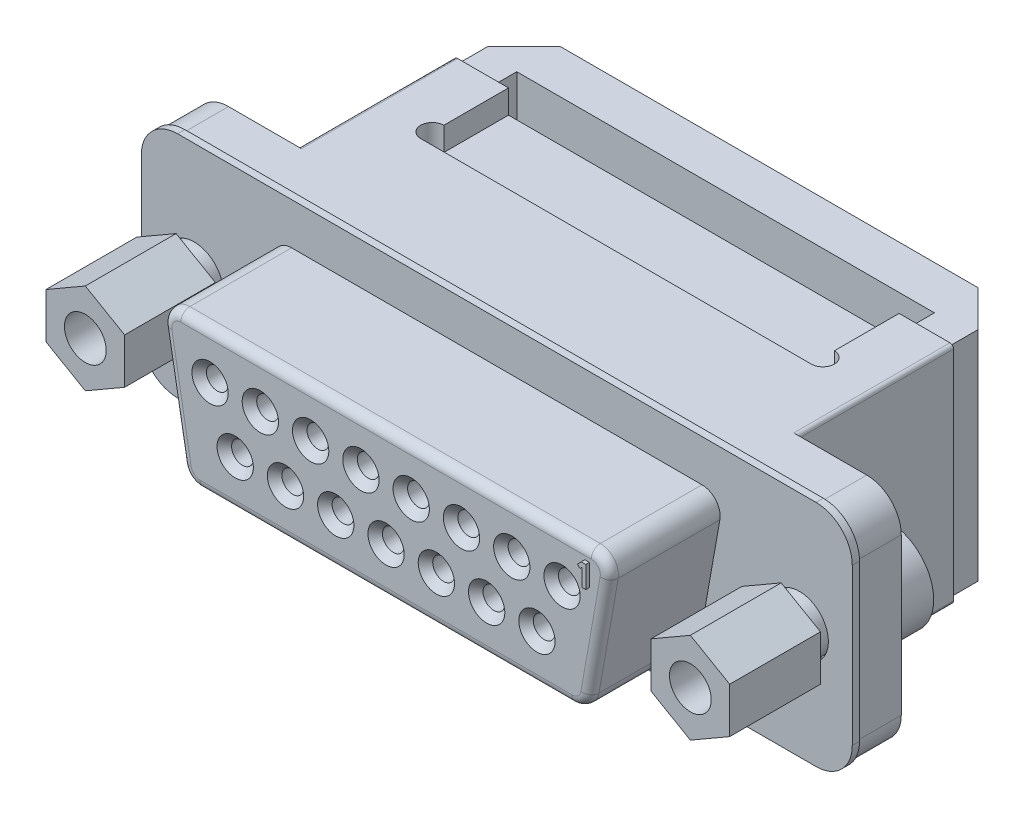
ISO-10303-21;
HEADER;
FILE_DESCRIPTION(('STEP AP214'),'2;1');
FILE_NAME('part.step','',(''),(''),'','','');
FILE_SCHEMA(('AUTOMOTIVE_DESIGN { 1 0 10303 214 1 1 1 1 }'));
ENDSEC;
DATA;
#1=APPLICATION_CONTEXT('core data for automotive mechanical design processes');
#2=APPLICATION_PROTOCOL_DEFINITION('international standard','automotive_design',2000,#1);
#3=PRODUCT_CONTEXT('',#1,'mechanical');
#4=PRODUCT('Part','Part','',(#3));
#5=PRODUCT_RELATED_PRODUCT_CATEGORY('part','',(#4));
#6=PRODUCT_DEFINITION_FORMATION('','',#4);
#7=PRODUCT_DEFINITION_CONTEXT('part definition',#1,'design');
#8=PRODUCT_DEFINITION('design','',#6,#7);
#9=PRODUCT_DEFINITION_SHAPE('','',#8);
#10=(LENGTH_UNIT() NAMED_UNIT(*) SI_UNIT(.MILLI.,.METRE.));
#11=(NAMED_UNIT(*) PLANE_ANGLE_UNIT() SI_UNIT($,.RADIAN.));
#12=(NAMED_UNIT(*) SI_UNIT($,.STERADIAN.) SOLID_ANGLE_UNIT());
#13=UNCERTAINTY_MEASURE_WITH_UNIT(LENGTH_MEASURE(1.E-05),#10,'distance_accuracy_value','');
#14=(GEOMETRIC_REPRESENTATION_CONTEXT(3) GLOBAL_UNCERTAINTY_ASSIGNED_CONTEXT((#13)) GLOBAL_UNIT_ASSIGNED_CONTEXT((#10,
#11,#12)) REPRESENTATION_CONTEXT('',''));
#15=CARTESIAN_POINT('',(0.,0.,0.));
#16=DIRECTION('',(0.,0.,1.));
#17=DIRECTION('',(1.,0.,0.));
#18=AXIS2_PLACEMENT_3D('',#15,#16,#17);
#19=CARTESIAN_POINT('',(-11.3,3.,6.1));
#20=DIRECTION('',(0.,0.,-1.));
#21=DIRECTION('',(-1.,0.,0.));
#22=AXIS2_PLACEMENT_3D('',#19,#20,#21);
#23=PLANE('',#22);
#24=CARTESIAN_POINT('',(-8.30560169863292,-1.42659815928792,6.1));
#25=DIRECTION('',(0.,0.,-1.));
#26=DIRECTION('',(-1.,0.,0.));
#27=AXIS2_PLACEMENT_3D('',#24,#25,#26);
#28=CIRCLE('',#27,1.00000000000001);
#29=CARTESIAN_POINT('',(-9.30560169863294,-1.42659815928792,6.1));
#30=VERTEX_POINT('',#29);
#31=EDGE_CURVE('E1341',#30,#30,#28,.T.);
#32=ORIENTED_EDGE('',*,*,#31,.T.);
#33=EDGE_LOOP('',(#32));
#34=FACE_BOUND('',#33,.T.);
#35=CARTESIAN_POINT('',(-5.5362783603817,-1.42659815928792,6.1));
#36=DIRECTION('',(0.,0.,-1.));
#37=DIRECTION('',(-1.,0.,0.));
#38=AXIS2_PLACEMENT_3D('',#35,#36,#37);
#39=CIRCLE('',#38,1.00000000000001);
#40=CARTESIAN_POINT('',(-6.53627836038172,-1.42659815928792,6.1));
#41=VERTEX_POINT('',#40);
#42=EDGE_CURVE('E1332',#41,#41,#39,.T.);
#43=ORIENTED_EDGE('',*,*,#42,.T.);
#44=EDGE_LOOP('',(#43));
#45=FACE_BOUND('',#44,.T.);
#46=CARTESIAN_POINT('',(-2.76695502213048,-1.42659815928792,6.1));
#47=DIRECTION('',(0.,0.,-1.));
#48=DIRECTION('',(-1.,0.,0.));
#49=AXIS2_PLACEMENT_3D('',#46,#47,#48);
#50=CIRCLE('',#49,1.00000000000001);
#51=CARTESIAN_POINT('',(-3.7669550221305,-1.42659815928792,6.1));
#52=VERTEX_POINT('',#51);
#53=EDGE_CURVE('E1323',#52,#52,#50,.T.);
#54=ORIENTED_EDGE('',*,*,#53,.T.);
#55=EDGE_LOOP('',(#54));
#56=FACE_BOUND('',#55,.T.);
#57=CARTESIAN_POINT('',(0.00236831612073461,-1.42659815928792,6.1));
#58=DIRECTION('',(0.,0.,-1.));
#59=DIRECTION('',(-1.,0.,0.));
#60=AXIS2_PLACEMENT_3D('',#57,#58,#59);
#61=CIRCLE('',#60,1.00000000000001);
#62=CARTESIAN_POINT('',(-0.99763168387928,-1.42659815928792,6.1));
#63=VERTEX_POINT('',#62);
#64=EDGE_CURVE('E1314',#63,#63,#61,.T.);
#65=ORIENTED_EDGE('',*,*,#64,.T.);
#66=EDGE_LOOP('',(#65));
#67=FACE_BOUND('',#66,.T.);
#68=CARTESIAN_POINT('',(2.77169165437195,-1.42659815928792,6.1));
#69=DIRECTION('',(0.,0.,-1.));
#70=DIRECTION('',(-1.,0.,0.));
#71=AXIS2_PLACEMENT_3D('',#68,#69,#70);
#72=CIRCLE('',#71,1.00000000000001);
#73=CARTESIAN_POINT('',(1.77169165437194,-1.42659815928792,6.1));
#74=VERTEX_POINT('',#73);
#75=EDGE_CURVE('E1305',#74,#74,#72,.T.);
#76=ORIENTED_EDGE('',*,*,#75,.T.);
#77=EDGE_LOOP('',(#76));
#78=FACE_BOUND('',#77,.T.);
#79=CARTESIAN_POINT('',(5.54101499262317,-1.42659815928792,6.1));
#80=DIRECTION('',(0.,0.,-1.));
#81=DIRECTION('',(-1.,0.,0.));
#82=AXIS2_PLACEMENT_3D('',#79,#80,#81);
#83=CIRCLE('',#82,1.00000000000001);
#84=CARTESIAN_POINT('',(4.54101499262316,-1.42659815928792,6.1));
#85=VERTEX_POINT('',#84);
#86=EDGE_CURVE('E1296',#85,#85,#83,.T.);
#87=ORIENTED_EDGE('',*,*,#86,.T.);
#88=EDGE_LOOP('',(#87));
#89=FACE_BOUND('',#88,.T.);
#90=CARTESIAN_POINT('',(8.31033833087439,-1.42659815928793,6.1));
#91=DIRECTION('',(0.,0.,-1.));
#92=DIRECTION('',(-1.,0.,0.));
#93=AXIS2_PLACEMENT_3D('',#90,#91,#92);
#94=CIRCLE('',#93,1.00000000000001);
#95=CARTESIAN_POINT('',(7.31033833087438,-1.42659815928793,6.1));
#96=VERTEX_POINT('',#95);
#97=EDGE_CURVE('E1287',#96,#96,#94,.T.);
#98=ORIENTED_EDGE('',*,*,#97,.T.);
#99=EDGE_LOOP('',(#98));
#100=FACE_BOUND('',#99,.T.);
#101=CARTESIAN_POINT('',(-9.69026336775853,1.425,6.1));
#102=DIRECTION('',(0.,0.,-1.));
#103=DIRECTION('',(-1.,0.,0.));
#104=AXIS2_PLACEMENT_3D('',#101,#102,#103);
#105=CIRCLE('',#104,1.00000000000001);
#106=CARTESIAN_POINT('',(-10.6902633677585,1.425,6.1));
#107=VERTEX_POINT('',#106);
#108=EDGE_CURVE('E1278',#107,#107,#105,.T.);
#109=ORIENTED_EDGE('',*,*,#108,.T.);
#110=EDGE_LOOP('',(#109));
#111=FACE_BOUND('',#110,.T.);
#112=CARTESIAN_POINT('',(-6.92094002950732,1.425,6.1));
#113=DIRECTION('',(0.,0.,-1.));
#114=DIRECTION('',(-1.,0.,0.));
#115=AXIS2_PLACEMENT_3D('',#112,#113,#114);
#116=CIRCLE('',#115,1.00000000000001);
#117=CARTESIAN_POINT('',(-7.92094002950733,1.425,6.1));
#118=VERTEX_POINT('',#117);
#119=EDGE_CURVE('E1269',#118,#118,#116,.T.);
#120=ORIENTED_EDGE('',*,*,#119,.T.);
#121=EDGE_LOOP('',(#120));
#122=FACE_BOUND('',#121,.T.);
#123=CARTESIAN_POINT('',(-4.15161669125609,1.425,6.1));
#124=DIRECTION('',(0.,0.,-1.));
#125=DIRECTION('',(-1.,0.,0.));
#126=AXIS2_PLACEMENT_3D('',#123,#124,#125);
#127=CIRCLE('',#126,1.00000000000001);
#128=CARTESIAN_POINT('',(-5.15161669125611,1.425,6.1));
#129=VERTEX_POINT('',#128);
#130=EDGE_CURVE('E1260',#129,#129,#127,.T.);
#131=ORIENTED_EDGE('',*,*,#130,.T.);
#132=EDGE_LOOP('',(#131));
#133=FACE_BOUND('',#132,.T.);
#134=CARTESIAN_POINT('',(-1.38229335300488,1.425,6.1));
#135=DIRECTION('',(0.,0.,-1.));
#136=DIRECTION('',(-1.,0.,0.));
#137=AXIS2_PLACEMENT_3D('',#134,#135,#136);
#138=CIRCLE('',#137,1.00000000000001);
#139=CARTESIAN_POINT('',(-2.38229335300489,1.425,6.1));
#140=VERTEX_POINT('',#139);
#141=EDGE_CURVE('E1251',#140,#140,#138,.T.);
#142=ORIENTED_EDGE('',*,*,#141,.T.);
#143=EDGE_LOOP('',(#142));
#144=FACE_BOUND('',#143,.T.);
#145=CARTESIAN_POINT('',(1.38702998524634,1.425,6.1));
#146=DIRECTION('',(0.,0.,-1.));
#147=DIRECTION('',(-1.,0.,0.));
#148=AXIS2_PLACEMENT_3D('',#145,#146,#147);
#149=CIRCLE('',#148,1.00000000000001);
#150=CARTESIAN_POINT('',(0.387029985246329,1.425,6.1));
#151=VERTEX_POINT('',#150);
#152=EDGE_CURVE('E1242',#151,#151,#149,.T.);
#153=ORIENTED_EDGE('',*,*,#152,.T.);
#154=EDGE_LOOP('',(#153));
#155=FACE_BOUND('',#154,.T.);
#156=CARTESIAN_POINT('',(4.15635332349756,1.425,6.1));
#157=DIRECTION('',(0.,0.,-1.));
#158=DIRECTION('',(-1.,0.,0.));
#159=AXIS2_PLACEMENT_3D('',#156,#157,#158);
#160=CIRCLE('',#159,1.00000000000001);
#161=CARTESIAN_POINT('',(3.15635332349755,1.425,6.1));
#162=VERTEX_POINT('',#161);
#163=EDGE_CURVE('E1233',#162,#162,#160,.T.);
#164=ORIENTED_EDGE('',*,*,#163,.T.);
#165=EDGE_LOOP('',(#164));
#166=FACE_BOUND('',#165,.T.);
#167=CARTESIAN_POINT('',(6.92567666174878,1.425,6.1));
#168=DIRECTION('',(0.,0.,-1.));
#169=DIRECTION('',(-1.,0.,0.));
#170=AXIS2_PLACEMENT_3D('',#167,#168,#169);
#171=CIRCLE('',#170,1.00000000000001);
#172=CARTESIAN_POINT('',(5.92567666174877,1.425,6.1));
#173=VERTEX_POINT('',#172);
#174=EDGE_CURVE('E866',#173,#173,#171,.T.);
#175=ORIENTED_EDGE('',*,*,#174,.T.);
#176=EDGE_LOOP('',(#175));
#177=FACE_BOUND('',#176,.T.);
#178=CARTESIAN_POINT('',(9.695,1.425,6.1));
#179=DIRECTION('',(0.,0.,-1.));
#180=DIRECTION('',(-1.,0.,0.));
#181=AXIS2_PLACEMENT_3D('',#178,#179,#180);
#182=CIRCLE('',#181,1.00000000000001);
#183=CARTESIAN_POINT('',(8.69499999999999,1.425,6.1));
#184=VERTEX_POINT('',#183);
#185=EDGE_CURVE('E1230',#184,#184,#182,.T.);
#186=ORIENTED_EDGE('',*,*,#185,.T.);
#187=EDGE_LOOP('',(#186));
#188=FACE_BOUND('',#187,.T.);
#189=CARTESIAN_POINT('',(11.3,3.,6.1));
#190=DIRECTION('',(0.,0.,-1.));
#191=DIRECTION('',(-1.,0.,0.));
#192=AXIS2_PLACEMENT_3D('',#189,#190,#191);
#193=CIRCLE('',#192,0.500000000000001);
#194=CARTESIAN_POINT('',(11.7924038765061,2.91317591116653,6.1));
#195=VERTEX_POINT('',#194);
#196=CARTESIAN_POINT('',(11.3,3.5,6.1));
#197=VERTEX_POINT('',#196);
#198=EDGE_CURVE('E1095',#195,#197,#193,.F.);
#199=ORIENTED_EDGE('',*,*,#198,.T.);
#200=DIRECTION('',(-1.,0.,0.));
#201=VECTOR('',#200,1.);
#202=CARTESIAN_POINT('',(-11.3,3.5,6.1));
#203=LINE('',#202,#201);
#204=CARTESIAN_POINT('',(-11.3,3.5,6.1));
#205=VERTEX_POINT('',#204);
#206=EDGE_CURVE('E1173',#197,#205,#203,.T.);
#207=ORIENTED_EDGE('',*,*,#206,.T.);
#208=CARTESIAN_POINT('',(-11.3,3.,6.1));
#209=DIRECTION('',(0.,0.,-1.));
#210=DIRECTION('',(-1.,0.,0.));
#211=AXIS2_PLACEMENT_3D('',#208,#209,#210);
#212=CIRCLE('',#211,0.500000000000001);
#213=CARTESIAN_POINT('',(-11.7924038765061,2.91317591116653,6.1));
#214=VERTEX_POINT('',#213);
#215=EDGE_CURVE('E1170',#205,#214,#212,.F.);
#216=ORIENTED_EDGE('',*,*,#215,.T.);
#217=DIRECTION('',(0.173648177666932,-0.984807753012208,0.));
#218=VECTOR('',#217,1.);
#219=CARTESIAN_POINT('',(-11.7924038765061,2.91317591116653,6.1));
#220=LINE('',#219,#218);
#221=CARTESIAN_POINT('',(-10.7344419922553,-3.08682408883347,6.1));
#222=VERTEX_POINT('',#221);
#223=EDGE_CURVE('E1172',#214,#222,#220,.T.);
#224=ORIENTED_EDGE('',*,*,#223,.T.);
#225=CARTESIAN_POINT('',(-10.2420381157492,-3.,6.1));
#226=DIRECTION('',(0.,0.,-1.));
#227=DIRECTION('',(-1.,0.,0.));
#228=AXIS2_PLACEMENT_3D('',#225,#226,#227);
#229=CIRCLE('',#228,0.5);
#230=CARTESIAN_POINT('',(-10.2420381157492,-3.5,6.1));
#231=VERTEX_POINT('',#230);
#232=EDGE_CURVE('E1175',#222,#231,#229,.F.);
#233=ORIENTED_EDGE('',*,*,#232,.T.);
#234=DIRECTION('',(1.,0.,0.));
#235=VECTOR('',#234,1.);
#236=CARTESIAN_POINT('',(-11.3,-3.5,6.1));
#237=LINE('',#236,#235);
#238=CARTESIAN_POINT('',(10.2420381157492,-3.5,6.1));
#239=VERTEX_POINT('',#238);
#240=EDGE_CURVE('E1177',#231,#239,#237,.T.);
#241=ORIENTED_EDGE('',*,*,#240,.T.);
#242=CARTESIAN_POINT('',(10.2420381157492,-3.,6.1));
#243=DIRECTION('',(0.,0.,-1.));
#244=DIRECTION('',(-1.,0.,0.));
#245=AXIS2_PLACEMENT_3D('',#242,#243,#244);
#246=CIRCLE('',#245,0.5);
#247=CARTESIAN_POINT('',(10.7344419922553,-3.08682408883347,6.1));
#248=VERTEX_POINT('',#247);
#249=EDGE_CURVE('E1179',#239,#248,#246,.F.);
#250=ORIENTED_EDGE('',*,*,#249,.T.);
#251=DIRECTION('',(0.173648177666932,0.984807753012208,0.));
#252=VECTOR('',#251,1.);
#253=CARTESIAN_POINT('',(11.1109304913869,-0.951651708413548,6.1));
#254=LINE('',#253,#252);
#255=EDGE_CURVE('E1181',#248,#195,#254,.T.);
#256=ORIENTED_EDGE('',*,*,#255,.T.);
#257=EDGE_LOOP('',(#199,#207,#216,#224,#233,#241,#250,#256));
#258=FACE_BOUND('',#257,.T.);
#259=DIRECTION('',(0.,-1.,0.));
#260=VECTOR('',#259,1.);
#261=CARTESIAN_POINT('',(11.,3.06715728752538,6.1));
#262=LINE('',#261,#260);
#263=CARTESIAN_POINT('',(11.,3.06715728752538,6.1));
#264=VERTEX_POINT('',#263);
#265=CARTESIAN_POINT('',(11.,2.1,6.1));
#266=VERTEX_POINT('',#265);
#267=EDGE_CURVE('E681',#264,#266,#262,.T.);
#268=ORIENTED_EDGE('',*,*,#267,.F.);
#269=DIRECTION('',(0.707106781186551,0.707106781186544,0.));
#270=VECTOR('',#269,1.);
#271=CARTESIAN_POINT('',(10.8792893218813,2.94644660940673,6.1));
#272=LINE('',#271,#270);
#273=CARTESIAN_POINT('',(10.8792893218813,2.94644660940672,6.1));
#274=VERTEX_POINT('',#273);
#275=EDGE_CURVE('E686',#274,#264,#272,.T.);
#276=ORIENTED_EDGE('',*,*,#275,.F.);
#277=DIRECTION('',(0.707106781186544,-0.707106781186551,0.));
#278=VECTOR('',#277,1.);
#279=CARTESIAN_POINT('',(10.737867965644,3.08786796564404,6.1));
#280=LINE('',#279,#278);
#281=CARTESIAN_POINT('',(10.737867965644,3.08786796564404,6.1));
#282=VERTEX_POINT('',#281);
#283=EDGE_CURVE('E713',#282,#274,#280,.T.);
#284=ORIENTED_EDGE('',*,*,#283,.F.);
#285=DIRECTION('',(-0.707106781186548,-0.707106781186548,0.));
#286=VECTOR('',#285,1.);
#287=CARTESIAN_POINT('',(10.95,3.3,6.1));
#288=LINE('',#287,#286);
#289=CARTESIAN_POINT('',(10.95,3.3,6.1));
#290=VERTEX_POINT('',#289);
#291=EDGE_CURVE('E710',#290,#282,#288,.T.);
#292=ORIENTED_EDGE('',*,*,#291,.F.);
#293=DIRECTION('',(-1.,0.,0.));
#294=VECTOR('',#293,1.);
#295=CARTESIAN_POINT('',(11.2,3.3,6.1));
#296=LINE('',#295,#294);
#297=CARTESIAN_POINT('',(11.2,3.3,6.1));
#298=VERTEX_POINT('',#297);
#299=EDGE_CURVE('E707',#298,#290,#296,.T.);
#300=ORIENTED_EDGE('',*,*,#299,.F.);
#301=DIRECTION('',(0.,1.,0.));
#302=VECTOR('',#301,1.);
#303=CARTESIAN_POINT('',(11.2,2.1,6.1));
#304=LINE('',#303,#302);
#305=CARTESIAN_POINT('',(11.2,2.1,6.1));
#306=VERTEX_POINT('',#305);
#307=EDGE_CURVE('E704',#306,#298,#304,.T.);
#308=ORIENTED_EDGE('',*,*,#307,.F.);
#309=DIRECTION('',(1.,0.,0.));
#310=VECTOR('',#309,1.);
#311=CARTESIAN_POINT('',(11.,2.1,6.1));
#312=LINE('',#311,#310);
#313=EDGE_CURVE('E701',#266,#306,#312,.T.);
#314=ORIENTED_EDGE('',*,*,#313,.F.);
#315=EDGE_LOOP('',(#268,#276,#284,#292,#300,#308,#314));
#316=FACE_BOUND('',#315,.T.);
#317=ADVANCED_FACE('F80',(#34,#45,#56,#67,#78,#89,#100,#111,#122,#133,#144,#155,#166,#177,#188,
#258,#316),#23,.F.);
#318=CARTESIAN_POINT('',(14.16,0.,6.));
#319=DIRECTION('',(0.,0.,-1.));
#320=DIRECTION('',(1.,0.,0.));
#321=AXIS2_PLACEMENT_3D('',#318,#319,#320);
#322=PLANE('',#321);
#323=DIRECTION('',(0.866025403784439,0.5,0.));
#324=VECTOR('',#323,1.);
#325=CARTESIAN_POINT('',(13.1346611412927,0.464644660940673,6.));
#326=LINE('',#325,#324);
#327=CARTESIAN_POINT('',(14.4949364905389,1.25000000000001,6.));
#328=VERTEX_POINT('',#327);
#329=CARTESIAN_POINT('',(16.66,2.5,6.));
#330=VERTEX_POINT('',#329);
#331=EDGE_CURVE('E770',#328,#330,#326,.T.);
#332=ORIENTED_EDGE('',*,*,#331,.F.);
#333=DIRECTION('',(0.,1.,0.));
#334=VECTOR('',#333,1.);
#335=CARTESIAN_POINT('',(14.4949364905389,-5.64142135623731,6.));
#336=LINE('',#335,#334);
#337=CARTESIAN_POINT('',(14.4949364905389,-1.24999999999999,6.));
#338=VERTEX_POINT('',#337);
#339=EDGE_CURVE('E738',#338,#328,#336,.T.);
#340=ORIENTED_EDGE('',*,*,#339,.F.);
#341=DIRECTION('',(-0.866025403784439,0.5,0.));
#342=VECTOR('',#341,1.);
#343=CARTESIAN_POINT('',(18.0202753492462,-3.28535533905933,6.));
#344=LINE('',#343,#342);
#345=CARTESIAN_POINT('',(16.66,-2.5,6.));
#346=VERTEX_POINT('',#345);
#347=EDGE_CURVE('E741',#346,#338,#344,.T.);
#348=ORIENTED_EDGE('',*,*,#347,.F.);
#349=DIRECTION('',(-0.866025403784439,-0.5,0.));
#350=VECTOR('',#349,1.);
#351=CARTESIAN_POINT('',(15.2997246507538,-3.28535533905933,6.));
#352=LINE('',#351,#350);
#353=CARTESIAN_POINT('',(18.8250635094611,-1.25000000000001,6.));
#354=VERTEX_POINT('',#353);
#355=EDGE_CURVE('E749',#354,#346,#352,.T.);
#356=ORIENTED_EDGE('',*,*,#355,.F.);
#357=DIRECTION('',(0.,-1.,0.));
#358=VECTOR('',#357,1.);
#359=CARTESIAN_POINT('',(18.8250635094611,-5.64142135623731,6.));
#360=LINE('',#359,#358);
#361=CARTESIAN_POINT('',(18.8250635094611,1.25,6.));
#362=VERTEX_POINT('',#361);
#363=EDGE_CURVE('E756',#362,#354,#360,.T.);
#364=ORIENTED_EDGE('',*,*,#363,.F.);
#365=DIRECTION('',(0.866025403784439,-0.5,0.));
#366=VECTOR('',#365,1.);
#367=CARTESIAN_POINT('',(20.1853388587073,0.464644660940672,6.));
#368=LINE('',#367,#366);
#369=EDGE_CURVE('E763',#330,#362,#368,.T.);
#370=ORIENTED_EDGE('',*,*,#369,.F.);
#371=EDGE_LOOP('',(#332,#340,#348,#356,#364,#370));
#372=FACE_BOUND('',#371,.T.);
#373=CARTESIAN_POINT('',(16.66,0.,6.));
#374=DIRECTION('',(0.,0.,-1.));
#375=DIRECTION('',(-1.,0.,0.));
#376=AXIS2_PLACEMENT_3D('',#373,#374,#375);
#377=CIRCLE('',#376,1.15);
#378=CARTESIAN_POINT('',(15.51,0.,6.));
#379=VERTEX_POINT('',#378);
#380=EDGE_CURVE('E774',#379,#379,#377,.T.);
#381=ORIENTED_EDGE('',*,*,#380,.T.);
#382=EDGE_LOOP('',(#381));
#383=FACE_BOUND('',#382,.T.);
#384=ADVANCED_FACE('F1499',(#372,#383),#322,.F.);
#385=CARTESIAN_POINT('',(-17.575,-4.3,-2.8));
#386=DIRECTION('',(0.,0.,-1.));
#387=DIRECTION('',(-1.,0.,0.));
#388=AXIS2_PLACEMENT_3D('',#385,#386,#387);
#389=PLANE('',#388);
#390=DIRECTION('',(0.,1.,0.));
#391=VECTOR('',#390,1.);
#392=CARTESIAN_POINT('',(13.755,-4.3,-2.8));
#393=LINE('',#392,#391);
#394=CARTESIAN_POINT('',(13.755,-6.,-2.8));
#395=VERTEX_POINT('',#394);
#396=CARTESIAN_POINT('',(13.755,5.99999999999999,-2.8));
#397=VERTEX_POINT('',#396);
#398=EDGE_CURVE('E878',#395,#397,#393,.T.);
#399=ORIENTED_EDGE('',*,*,#398,.T.);
#400=CARTESIAN_POINT('',(13.555,6.,-2.8));
#401=DIRECTION('',(0.,0.,-1.));
#402=DIRECTION('',(-1.,0.,0.));
#403=AXIS2_PLACEMENT_3D('',#400,#401,#402);
#404=CIRCLE('',#403,0.2);
#405=CARTESIAN_POINT('',(13.555,6.2,-2.8));
#406=VERTEX_POINT('',#405);
#407=EDGE_CURVE('E1223',#397,#406,#404,.F.);
#408=ORIENTED_EDGE('',*,*,#407,.T.);
#409=DIRECTION('',(1.,0.,0.));
#410=VECTOR('',#409,1.);
#411=CARTESIAN_POINT('',(-17.575,6.2,-2.8));
#412=LINE('',#411,#410);
#413=CARTESIAN_POINT('',(17.575,6.2,-2.8));
#414=VERTEX_POINT('',#413);
#415=EDGE_CURVE('E1011',#406,#414,#412,.T.);
#416=ORIENTED_EDGE('',*,*,#415,.T.);
#417=CARTESIAN_POINT('',(17.575,4.3,-2.8));
#418=DIRECTION('',(0.,0.,-1.));
#419=DIRECTION('',(-1.,0.,0.));
#420=AXIS2_PLACEMENT_3D('',#417,#418,#419);
#421=CIRCLE('',#420,1.9);
#422=CARTESIAN_POINT('',(19.475,4.3,-2.8));
#423=VERTEX_POINT('',#422);
#424=EDGE_CURVE('E1012',#414,#423,#421,.T.);
#425=ORIENTED_EDGE('',*,*,#424,.T.);
#426=DIRECTION('',(0.,-1.,0.));
#427=VECTOR('',#426,1.);
#428=CARTESIAN_POINT('',(19.475,4.3,-2.8));
#429=LINE('',#428,#427);
#430=CARTESIAN_POINT('',(19.475,-4.3,-2.8));
#431=VERTEX_POINT('',#430);
#432=EDGE_CURVE('E1014',#423,#431,#429,.T.);
#433=ORIENTED_EDGE('',*,*,#432,.T.);
#434=CARTESIAN_POINT('',(17.575,-4.3,-2.8));
#435=DIRECTION('',(0.,0.,-1.));
#436=DIRECTION('',(-1.,0.,0.));
#437=AXIS2_PLACEMENT_3D('',#434,#435,#436);
#438=CIRCLE('',#437,1.9);
#439=CARTESIAN_POINT('',(17.575,-6.2,-2.8));
#440=VERTEX_POINT('',#439);
#441=EDGE_CURVE('E1016',#431,#440,#438,.T.);
#442=ORIENTED_EDGE('',*,*,#441,.T.);
#443=DIRECTION('',(-1.,0.,0.));
#444=VECTOR('',#443,1.);
#445=CARTESIAN_POINT('',(17.575,-6.2,-2.8));
#446=LINE('',#445,#444);
#447=CARTESIAN_POINT('',(13.555,-6.2,-2.8));
#448=VERTEX_POINT('',#447);
#449=EDGE_CURVE('E1018',#440,#448,#446,.T.);
#450=ORIENTED_EDGE('',*,*,#449,.T.);
#451=CARTESIAN_POINT('',(13.555,-6.,-2.8));
#452=DIRECTION('',(0.,0.,-1.));
#453=DIRECTION('',(-1.,0.,0.));
#454=AXIS2_PLACEMENT_3D('',#451,#452,#453);
#455=CIRCLE('',#454,0.2);
#456=EDGE_CURVE('E1020',#448,#395,#455,.F.);
#457=ORIENTED_EDGE('',*,*,#456,.T.);
#458=EDGE_LOOP('',(#399,#408,#416,#425,#433,#442,#450,#457));
#459=FACE_BOUND('',#458,.T.);
#460=CARTESIAN_POINT('',(16.66,0.,-2.8));
#461=DIRECTION('',(0.,0.,-1.));
#462=DIRECTION('',(-1.,0.,0.));
#463=AXIS2_PLACEMENT_3D('',#460,#461,#462);
#464=CIRCLE('',#463,2.5);
#465=CARTESIAN_POINT('',(14.16,0.,-2.8));
#466=VERTEX_POINT('',#465);
#467=EDGE_CURVE('E796',#466,#466,#464,.F.);
#468=ORIENTED_EDGE('',*,*,#467,.T.);
#469=EDGE_LOOP('',(#468));
#470=FACE_BOUND('',#469,.T.);
#471=ADVANCED_FACE('F1469',(#459,#470),#389,.T.);
#472=CARTESIAN_POINT('',(16.66,0.,0.));
#473=DIRECTION('',(0.,0.,1.));
#474=DIRECTION('',(1.,0.,0.));
#475=AXIS2_PLACEMENT_3D('',#472,#473,#474);
#476=CYLINDRICAL_SURFACE('',#475,1.59999999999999);
#477=CARTESIAN_POINT('',(16.66,0.,0.));
#478=DIRECTION('',(0.,0.,-1.));
#479=DIRECTION('',(-1.,0.,0.));
#480=AXIS2_PLACEMENT_3D('',#477,#478,#479);
#481=CIRCLE('',#480,1.59999999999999);
#482=CARTESIAN_POINT('',(15.06,0.,0.));
#483=VERTEX_POINT('',#482);
#484=EDGE_CURVE('E882',#483,#483,#481,.T.);
#485=ORIENTED_EDGE('',*,*,#484,.F.);
#486=EDGE_LOOP('',(#485));
#487=FACE_BOUND('',#486,.T.);
#488=CARTESIAN_POINT('',(16.66,0.,-0.4));
#489=DIRECTION('',(0.,0.,-1.));
#490=DIRECTION('',(-1.,0.,0.));
#491=AXIS2_PLACEMENT_3D('',#488,#489,#490);
#492=CIRCLE('',#491,1.59999999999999);
#493=CARTESIAN_POINT('',(15.06,0.,-0.4));
#494=VERTEX_POINT('',#493);
#495=EDGE_CURVE('E1353',#494,#494,#492,.F.);
#496=ORIENTED_EDGE('',*,*,#495,.F.);
#497=EDGE_LOOP('',(#496));
#498=FACE_BOUND('',#497,.T.);
#499=ADVANCED_FACE('F1620',(#487,#498),#476,.F.);
#500=CARTESIAN_POINT('',(-14.16,0.,6.));
#501=DIRECTION('',(0.,0.,-1.));
#502=DIRECTION('',(-1.,0.,0.));
#503=AXIS2_PLACEMENT_3D('',#500,#501,#502);
#504=PLANE('',#503);
#505=CARTESIAN_POINT('',(-16.66,0.,6.));
#506=DIRECTION('',(0.,0.,1.));
#507=DIRECTION('',(1.,0.,0.));
#508=AXIS2_PLACEMENT_3D('',#505,#506,#507);
#509=CIRCLE('',#508,1.15);
#510=CARTESIAN_POINT('',(-15.51,0.,6.));
#511=VERTEX_POINT('',#510);
#512=EDGE_CURVE('E843',#511,#511,#509,.T.);
#513=ORIENTED_EDGE('',*,*,#512,.F.);
#514=EDGE_LOOP('',(#513));
#515=FACE_BOUND('',#514,.T.);
#516=DIRECTION('',(0.,1.,0.));
#517=VECTOR('',#516,1.);
#518=CARTESIAN_POINT('',(-14.4949364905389,-5.64142135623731,6.));
#519=LINE('',#518,#517);
#520=CARTESIAN_POINT('',(-14.4949364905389,-1.24999999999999,6.));
#521=VERTEX_POINT('',#520);
#522=CARTESIAN_POINT('',(-14.4949364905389,1.25000000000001,6.));
#523=VERTEX_POINT('',#522);
#524=EDGE_CURVE('E800',#521,#523,#519,.T.);
#525=ORIENTED_EDGE('',*,*,#524,.T.);
#526=DIRECTION('',(-0.866025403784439,0.5,0.));
#527=VECTOR('',#526,1.);
#528=CARTESIAN_POINT('',(-13.1346611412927,0.464644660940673,6.));
#529=LINE('',#528,#527);
#530=CARTESIAN_POINT('',(-16.66,2.5,6.));
#531=VERTEX_POINT('',#530);
#532=EDGE_CURVE('E834',#523,#531,#529,.T.);
#533=ORIENTED_EDGE('',*,*,#532,.T.);
#534=DIRECTION('',(-0.866025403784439,-0.5,0.));
#535=VECTOR('',#534,1.);
#536=CARTESIAN_POINT('',(-20.1853388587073,0.464644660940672,6.));
#537=LINE('',#536,#535);
#538=CARTESIAN_POINT('',(-18.8250635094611,1.25,6.));
#539=VERTEX_POINT('',#538);
#540=EDGE_CURVE('E835',#531,#539,#537,.T.);
#541=ORIENTED_EDGE('',*,*,#540,.T.);
#542=DIRECTION('',(0.,-1.,0.));
#543=VECTOR('',#542,1.);
#544=CARTESIAN_POINT('',(-18.8250635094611,-5.64142135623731,6.));
#545=LINE('',#544,#543);
#546=CARTESIAN_POINT('',(-18.8250635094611,-1.25000000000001,6.));
#547=VERTEX_POINT('',#546);
#548=EDGE_CURVE('E826',#539,#547,#545,.T.);
#549=ORIENTED_EDGE('',*,*,#548,.T.);
#550=DIRECTION('',(0.866025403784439,-0.5,0.));
#551=VECTOR('',#550,1.);
#552=CARTESIAN_POINT('',(-15.2997246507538,-3.28535533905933,6.));
#553=LINE('',#552,#551);
#554=CARTESIAN_POINT('',(-16.66,-2.5,6.));
#555=VERTEX_POINT('',#554);
#556=EDGE_CURVE('E817',#547,#555,#553,.T.);
#557=ORIENTED_EDGE('',*,*,#556,.T.);
#558=DIRECTION('',(0.866025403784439,0.5,0.));
#559=VECTOR('',#558,1.);
#560=CARTESIAN_POINT('',(-18.0202753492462,-3.28535533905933,6.));
#561=LINE('',#560,#559);
#562=EDGE_CURVE('E808',#555,#521,#561,.T.);
#563=ORIENTED_EDGE('',*,*,#562,.T.);
#564=EDGE_LOOP('',(#525,#533,#541,#549,#557,#563));
#565=FACE_BOUND('',#564,.T.);
#566=ADVANCED_FACE('F2343',(#515,#565),#504,.F.);
#567=CARTESIAN_POINT('',(-15.16,0.,1.));
#568=DIRECTION('',(0.,0.,1.));
#569=DIRECTION('',(1.,0.,0.));
#570=AXIS2_PLACEMENT_3D('',#567,#568,#569);
#571=PLANE('',#570);
#572=CARTESIAN_POINT('',(-16.66,0.,1.));
#573=DIRECTION('',(0.,0.,-1.));
#574=DIRECTION('',(-1.,0.,0.));
#575=AXIS2_PLACEMENT_3D('',#572,#573,#574);
#576=CIRCLE('',#575,1.5);
#577=CARTESIAN_POINT('',(-18.16,0.,1.));
#578=VERTEX_POINT('',#577);
#579=EDGE_CURVE('E854',#578,#578,#576,.T.);
#580=ORIENTED_EDGE('',*,*,#579,.F.);
#581=EDGE_LOOP('',(#580));
#582=FACE_BOUND('',#581,.T.);
#583=DIRECTION('',(0.,-1.,0.));
#584=VECTOR('',#583,1.);
#585=CARTESIAN_POINT('',(-14.4949364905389,-5.64142135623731,1.));
#586=LINE('',#585,#584);
#587=CARTESIAN_POINT('',(-14.4949364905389,1.25000000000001,0.999999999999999));
#588=VERTEX_POINT('',#587);
#589=CARTESIAN_POINT('',(-14.4949364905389,-1.24999999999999,1.));
#590=VERTEX_POINT('',#589);
#591=EDGE_CURVE('E797',#588,#590,#586,.T.);
#592=ORIENTED_EDGE('',*,*,#591,.T.);
#593=DIRECTION('',(-0.866025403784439,-0.5,0.));
#594=VECTOR('',#593,1.);
#595=CARTESIAN_POINT('',(-18.0202753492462,-3.28535533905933,1.));
#596=LINE('',#595,#594);
#597=CARTESIAN_POINT('',(-16.66,-2.5,1.));
#598=VERTEX_POINT('',#597);
#599=EDGE_CURVE('E803',#590,#598,#596,.T.);
#600=ORIENTED_EDGE('',*,*,#599,.T.);
#601=DIRECTION('',(-0.866025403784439,0.5,0.));
#602=VECTOR('',#601,1.);
#603=CARTESIAN_POINT('',(-15.2997246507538,-3.28535533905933,1.));
#604=LINE('',#603,#602);
#605=CARTESIAN_POINT('',(-18.8250635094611,-1.25000000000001,1.));
#606=VERTEX_POINT('',#605);
#607=EDGE_CURVE('E807',#598,#606,#604,.T.);
#608=ORIENTED_EDGE('',*,*,#607,.T.);
#609=DIRECTION('',(0.,1.,0.));
#610=VECTOR('',#609,1.);
#611=CARTESIAN_POINT('',(-18.8250635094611,-5.64142135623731,1.));
#612=LINE('',#611,#610);
#613=CARTESIAN_POINT('',(-18.8250635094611,1.25,1.));
#614=VERTEX_POINT('',#613);
#615=EDGE_CURVE('E816',#606,#614,#612,.T.);
#616=ORIENTED_EDGE('',*,*,#615,.T.);
#617=DIRECTION('',(0.866025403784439,0.5,0.));
#618=VECTOR('',#617,1.);
#619=CARTESIAN_POINT('',(-20.1853388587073,0.464644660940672,1.));
#620=LINE('',#619,#618);
#621=CARTESIAN_POINT('',(-16.66,2.5,1.));
#622=VERTEX_POINT('',#621);
#623=EDGE_CURVE('E825',#614,#622,#620,.T.);
#624=ORIENTED_EDGE('',*,*,#623,.T.);
#625=DIRECTION('',(0.866025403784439,-0.5,0.));
#626=VECTOR('',#625,1.);
#627=CARTESIAN_POINT('',(-13.1346611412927,0.464644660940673,1.));
#628=LINE('',#627,#626);
#629=EDGE_CURVE('E840',#622,#588,#628,.T.);
#630=ORIENTED_EDGE('',*,*,#629,.T.);
#631=EDGE_LOOP('',(#592,#600,#608,#616,#624,#630));
#632=FACE_BOUND('',#631,.T.);
#633=ADVANCED_FACE('F2421',(#582,#632),#571,.F.);
#634=DIRECTION('',(0.,-1.,0.));
#635=VECTOR('',#634,1.);
#636=CARTESIAN_POINT('',(-13.755,-4.3,-2.8));
#637=LINE('',#636,#635);
#638=CARTESIAN_POINT('',(-13.755,6.,-2.8));
#639=VERTEX_POINT('',#638);
#640=CARTESIAN_POINT('',(-13.755,-6.,-2.8));
#641=VERTEX_POINT('',#640);
#642=EDGE_CURVE('E1217',#639,#641,#637,.T.);
#643=ORIENTED_EDGE('',*,*,#642,.T.);
#644=CARTESIAN_POINT('',(-13.555,-6.,-2.8));
#645=DIRECTION('',(0.,0.,-1.));
#646=DIRECTION('',(-1.,0.,0.));
#647=AXIS2_PLACEMENT_3D('',#644,#645,#646);
#648=CIRCLE('',#647,0.2);
#649=CARTESIAN_POINT('',(-13.555,-6.2,-2.8));
#650=VERTEX_POINT('',#649);
#651=EDGE_CURVE('E1219',#641,#650,#648,.F.);
#652=ORIENTED_EDGE('',*,*,#651,.T.);
#653=CARTESIAN_POINT('',(-17.575,-6.2,-2.8));
#654=VERTEX_POINT('',#653);
#655=EDGE_CURVE('E1005',#650,#654,#446,.T.);
#656=ORIENTED_EDGE('',*,*,#655,.T.);
#657=CARTESIAN_POINT('',(-17.575,-4.3,-2.8));
#658=DIRECTION('',(0.,0.,-1.));
#659=DIRECTION('',(-1.,0.,0.));
#660=AXIS2_PLACEMENT_3D('',#657,#658,#659);
#661=CIRCLE('',#660,1.9);
#662=CARTESIAN_POINT('',(-19.475,-4.3,-2.8));
#663=VERTEX_POINT('',#662);
#664=EDGE_CURVE('E1001',#654,#663,#661,.T.);
#665=ORIENTED_EDGE('',*,*,#664,.T.);
#666=DIRECTION('',(0.,1.,0.));
#667=VECTOR('',#666,1.);
#668=CARTESIAN_POINT('',(-19.475,-4.3,-2.8));
#669=LINE('',#668,#667);
#670=CARTESIAN_POINT('',(-19.475,4.3,-2.8));
#671=VERTEX_POINT('',#670);
#672=EDGE_CURVE('E1004',#663,#671,#669,.T.);
#673=ORIENTED_EDGE('',*,*,#672,.T.);
#674=CARTESIAN_POINT('',(-17.575,4.3,-2.8));
#675=DIRECTION('',(0.,0.,-1.));
#676=DIRECTION('',(-1.,0.,0.));
#677=AXIS2_PLACEMENT_3D('',#674,#675,#676);
#678=CIRCLE('',#677,1.9);
#679=CARTESIAN_POINT('',(-17.575,6.2,-2.8));
#680=VERTEX_POINT('',#679);
#681=EDGE_CURVE('E1007',#671,#680,#678,.T.);
#682=ORIENTED_EDGE('',*,*,#681,.T.);
#683=CARTESIAN_POINT('',(-13.555,6.2,-2.8));
#684=VERTEX_POINT('',#683);
#685=EDGE_CURVE('E1009',#680,#684,#412,.T.);
#686=ORIENTED_EDGE('',*,*,#685,.T.);
#687=CARTESIAN_POINT('',(-13.555,6.,-2.8));
#688=DIRECTION('',(0.,0.,-1.));
#689=DIRECTION('',(-1.,0.,0.));
#690=AXIS2_PLACEMENT_3D('',#687,#688,#689);
#691=CIRCLE('',#690,0.2);
#692=EDGE_CURVE('E883',#684,#639,#691,.F.);
#693=ORIENTED_EDGE('',*,*,#692,.T.);
#694=EDGE_LOOP('',(#643,#652,#656,#665,#673,#682,#686,#693));
#695=FACE_BOUND('',#694,.T.);
#696=CARTESIAN_POINT('',(-16.66,0.,-2.8));
#697=DIRECTION('',(0.,0.,-1.));
#698=DIRECTION('',(-1.,0.,0.));
#699=AXIS2_PLACEMENT_3D('',#696,#697,#698);
#700=CIRCLE('',#699,2.5);
#701=CARTESIAN_POINT('',(-19.16,0.,-2.8));
#702=VERTEX_POINT('',#701);
#703=EDGE_CURVE('E865',#702,#702,#700,.F.);
#704=ORIENTED_EDGE('',*,*,#703,.T.);
#705=EDGE_LOOP('',(#704));
#706=FACE_BOUND('',#705,.T.);
#707=ADVANCED_FACE('F1429',(#695,#706),#389,.T.);
#708=CARTESIAN_POINT('',(-16.66,0.,0.));
#709=DIRECTION('',(0.,0.,1.));
#710=DIRECTION('',(1.,0.,0.));
#711=AXIS2_PLACEMENT_3D('',#708,#709,#710);
#712=CYLINDRICAL_SURFACE('',#711,1.59999999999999);
#713=CARTESIAN_POINT('',(-16.66,0.,0.));
#714=DIRECTION('',(0.,0.,-1.));
#715=DIRECTION('',(-1.,0.,0.));
#716=AXIS2_PLACEMENT_3D('',#713,#714,#715);
#717=CIRCLE('',#716,1.59999999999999);
#718=CARTESIAN_POINT('',(-18.26,0.,0.));
#719=VERTEX_POINT('',#718);
#720=EDGE_CURVE('E879',#719,#719,#717,.T.);
#721=ORIENTED_EDGE('',*,*,#720,.F.);
#722=EDGE_LOOP('',(#721));
#723=FACE_BOUND('',#722,.T.);
#724=CARTESIAN_POINT('',(-16.66,0.,-0.4));
#725=DIRECTION('',(0.,0.,-1.));
#726=DIRECTION('',(-1.,0.,0.));
#727=AXIS2_PLACEMENT_3D('',#724,#725,#726);
#728=CIRCLE('',#727,1.59999999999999);
#729=CARTESIAN_POINT('',(-18.26,0.,-0.4));
#730=VERTEX_POINT('',#729);
#731=EDGE_CURVE('E1350',#730,#730,#728,.F.);
#732=ORIENTED_EDGE('',*,*,#731,.F.);
#733=EDGE_LOOP('',(#732));
#734=FACE_BOUND('',#733,.T.);
#735=ADVANCED_FACE('F1548',(#723,#734),#712,.F.);
#736=CARTESIAN_POINT('',(-17.575,4.3,-0.4));
#737=DIRECTION('',(0.,0.,-1.));
#738=DIRECTION('',(-1.,0.,0.));
#739=AXIS2_PLACEMENT_3D('',#736,#737,#738);
#740=PLANE('',#739);
#741=CARTESIAN_POINT('',(-17.575,4.3,-0.4));
#742=DIRECTION('',(0.,0.,1.));
#743=DIRECTION('',(-1.,0.,0.));
#744=AXIS2_PLACEMENT_3D('',#741,#742,#743);
#745=CIRCLE('',#744,2.);
#746=CARTESIAN_POINT('',(-17.575,6.3,-0.4));
#747=VERTEX_POINT('',#746);
#748=CARTESIAN_POINT('',(-19.575,4.3,-0.4));
#749=VERTEX_POINT('',#748);
#750=EDGE_CURVE('E1106',#747,#749,#745,.T.);
#751=ORIENTED_EDGE('',*,*,#750,.F.);
#752=DIRECTION('',(-1.,0.,0.));
#753=VECTOR('',#752,1.);
#754=CARTESIAN_POINT('',(-17.575,6.3,-0.4));
#755=LINE('',#754,#753);
#756=CARTESIAN_POINT('',(17.575,6.3,-0.4));
#757=VERTEX_POINT('',#756);
#758=EDGE_CURVE('E1136',#757,#747,#755,.T.);
#759=ORIENTED_EDGE('',*,*,#758,.F.);
#760=CARTESIAN_POINT('',(17.575,4.3,-0.4));
#761=DIRECTION('',(0.,0.,1.));
#762=DIRECTION('',(-1.,0.,0.));
#763=AXIS2_PLACEMENT_3D('',#760,#761,#762);
#764=CIRCLE('',#763,2.);
#765=CARTESIAN_POINT('',(19.575,4.3,-0.4));
#766=VERTEX_POINT('',#765);
#767=EDGE_CURVE('E1132',#766,#757,#764,.T.);
#768=ORIENTED_EDGE('',*,*,#767,.F.);
#769=DIRECTION('',(0.,1.,0.));
#770=VECTOR('',#769,1.);
#771=CARTESIAN_POINT('',(19.575,-4.3,-0.4));
#772=LINE('',#771,#770);
#773=CARTESIAN_POINT('',(19.575,-4.3,-0.4));
#774=VERTEX_POINT('',#773);
#775=EDGE_CURVE('E1128',#774,#766,#772,.T.);
#776=ORIENTED_EDGE('',*,*,#775,.F.);
#777=CARTESIAN_POINT('',(17.575,-4.3,-0.4));
#778=DIRECTION('',(0.,0.,1.));
#779=DIRECTION('',(1.,0.,0.));
#780=AXIS2_PLACEMENT_3D('',#777,#778,#779);
#781=CIRCLE('',#780,2.);
#782=CARTESIAN_POINT('',(17.575,-6.3,-0.4));
#783=VERTEX_POINT('',#782);
#784=EDGE_CURVE('E1124',#783,#774,#781,.T.);
#785=ORIENTED_EDGE('',*,*,#784,.F.);
#786=DIRECTION('',(1.,0.,0.));
#787=VECTOR('',#786,1.);
#788=CARTESIAN_POINT('',(-17.575,-6.3,-0.4));
#789=LINE('',#788,#787);
#790=CARTESIAN_POINT('',(-17.575,-6.3,-0.4));
#791=VERTEX_POINT('',#790);
#792=EDGE_CURVE('E1120',#791,#783,#789,.T.);
#793=ORIENTED_EDGE('',*,*,#792,.F.);
#794=CARTESIAN_POINT('',(-17.575,-4.3,-0.4));
#795=DIRECTION('',(0.,0.,1.));
#796=DIRECTION('',(-1.,0.,0.));
#797=AXIS2_PLACEMENT_3D('',#794,#795,#796);
#798=CIRCLE('',#797,2.);
#799=CARTESIAN_POINT('',(-19.575,-4.3,-0.4));
#800=VERTEX_POINT('',#799);
#801=EDGE_CURVE('E1116',#800,#791,#798,.T.);
#802=ORIENTED_EDGE('',*,*,#801,.F.);
#803=DIRECTION('',(0.,-1.,0.));
#804=VECTOR('',#803,1.);
#805=CARTESIAN_POINT('',(-19.575,-4.3,-0.4));
#806=LINE('',#805,#804);
#807=EDGE_CURVE('E1111',#749,#800,#806,.T.);
#808=ORIENTED_EDGE('',*,*,#807,.F.);
#809=EDGE_LOOP('',(#751,#759,#768,#776,#785,#793,#802,#808));
#810=FACE_BOUND('',#809,.T.);
#811=DIRECTION('',(0.,1.,0.));
#812=VECTOR('',#811,1.);
#813=CARTESIAN_POINT('',(-19.475,-4.3,-0.4));
#814=LINE('',#813,#812);
#815=CARTESIAN_POINT('',(-19.475,-4.3,-0.4));
#816=VERTEX_POINT('',#815);
#817=CARTESIAN_POINT('',(-19.475,4.3,-0.4));
#818=VERTEX_POINT('',#817);
#819=EDGE_CURVE('E1026',#816,#818,#814,.T.);
#820=ORIENTED_EDGE('',*,*,#819,.F.);
#821=CARTESIAN_POINT('',(-17.575,-4.3,-0.4));
#822=DIRECTION('',(0.,0.,-1.));
#823=DIRECTION('',(-1.,0.,0.));
#824=AXIS2_PLACEMENT_3D('',#821,#822,#823);
#825=CIRCLE('',#824,1.9);
#826=CARTESIAN_POINT('',(-17.575,-6.2,-0.4));
#827=VERTEX_POINT('',#826);
#828=EDGE_CURVE('E1021',#827,#816,#825,.T.);
#829=ORIENTED_EDGE('',*,*,#828,.F.);
#830=DIRECTION('',(-1.,0.,0.));
#831=VECTOR('',#830,1.);
#832=CARTESIAN_POINT('',(17.575,-6.2,-0.4));
#833=LINE('',#832,#831);
#834=CARTESIAN_POINT('',(17.575,-6.2,-0.4));
#835=VERTEX_POINT('',#834);
#836=EDGE_CURVE('E981',#835,#827,#833,.T.);
#837=ORIENTED_EDGE('',*,*,#836,.F.);
#838=CARTESIAN_POINT('',(17.575,-4.3,-0.4));
#839=DIRECTION('',(0.,0.,-1.));
#840=DIRECTION('',(-1.,0.,0.));
#841=AXIS2_PLACEMENT_3D('',#838,#839,#840);
#842=CIRCLE('',#841,1.9);
#843=CARTESIAN_POINT('',(19.475,-4.3,-0.4));
#844=VERTEX_POINT('',#843);
#845=EDGE_CURVE('E1039',#844,#835,#842,.T.);
#846=ORIENTED_EDGE('',*,*,#845,.F.);
#847=DIRECTION('',(0.,-1.,0.));
#848=VECTOR('',#847,1.);
#849=CARTESIAN_POINT('',(19.475,4.3,-0.4));
#850=LINE('',#849,#848);
#851=CARTESIAN_POINT('',(19.475,4.3,-0.4));
#852=VERTEX_POINT('',#851);
#853=EDGE_CURVE('E1036',#852,#844,#850,.T.);
#854=ORIENTED_EDGE('',*,*,#853,.F.);
#855=CARTESIAN_POINT('',(17.575,4.3,-0.4));
#856=DIRECTION('',(0.,0.,-1.));
#857=DIRECTION('',(-1.,0.,0.));
#858=AXIS2_PLACEMENT_3D('',#855,#856,#857);
#859=CIRCLE('',#858,1.9);
#860=CARTESIAN_POINT('',(17.575,6.2,-0.4));
#861=VERTEX_POINT('',#860);
#862=EDGE_CURVE('E1033',#861,#852,#859,.T.);
#863=ORIENTED_EDGE('',*,*,#862,.F.);
#864=DIRECTION('',(1.,0.,0.));
#865=VECTOR('',#864,1.);
#866=CARTESIAN_POINT('',(-17.575,6.2,-0.4));
#867=LINE('',#866,#865);
#868=CARTESIAN_POINT('',(-17.575,6.2,-0.4));
#869=VERTEX_POINT('',#868);
#870=EDGE_CURVE('E1031',#869,#861,#867,.T.);
#871=ORIENTED_EDGE('',*,*,#870,.F.);
#872=CARTESIAN_POINT('',(-17.575,4.3,-0.4));
#873=DIRECTION('',(0.,0.,-1.));
#874=DIRECTION('',(-1.,0.,0.));
#875=AXIS2_PLACEMENT_3D('',#872,#873,#874);
#876=CIRCLE('',#875,1.9);
#877=EDGE_CURVE('E1029',#818,#869,#876,.T.);
#878=ORIENTED_EDGE('',*,*,#877,.F.);
#879=EDGE_LOOP('',(#820,#829,#837,#846,#854,#863,#871,#878));
#880=FACE_BOUND('',#879,.T.);
#881=ADVANCED_FACE('F1456',(#810,#880),#740,.T.);
#882=CARTESIAN_POINT('',(-17.575,4.3,0.));
#883=DIRECTION('',(0.,0.,-1.));
#884=DIRECTION('',(-1.,0.,0.));
#885=AXIS2_PLACEMENT_3D('',#882,#883,#884);
#886=PLANE('',#885);
#887=ORIENTED_EDGE('',*,*,#720,.T.);
#888=EDGE_LOOP('',(#887));
#889=FACE_BOUND('',#888,.T.);
#890=ORIENTED_EDGE('',*,*,#484,.T.);
#891=EDGE_LOOP('',(#890));
#892=FACE_BOUND('',#891,.T.);
#893=CARTESIAN_POINT('',(-17.575,4.3,0.));
#894=DIRECTION('',(0.,0.,1.));
#895=DIRECTION('',(-1.,0.,0.));
#896=AXIS2_PLACEMENT_3D('',#893,#894,#895);
#897=CIRCLE('',#896,2.);
#898=CARTESIAN_POINT('',(-17.575,6.3,0.));
#899=VERTEX_POINT('',#898);
#900=CARTESIAN_POINT('',(-19.575,4.3,0.));
#901=VERTEX_POINT('',#900);
#902=EDGE_CURVE('E1139',#899,#901,#897,.T.);
#903=ORIENTED_EDGE('',*,*,#902,.T.);
#904=DIRECTION('',(0.,-1.,0.));
#905=VECTOR('',#904,1.);
#906=CARTESIAN_POINT('',(-19.575,-4.3,0.));
#907=LINE('',#906,#905);
#908=CARTESIAN_POINT('',(-19.575,-4.3,0.));
#909=VERTEX_POINT('',#908);
#910=EDGE_CURVE('E1142',#901,#909,#907,.T.);
#911=ORIENTED_EDGE('',*,*,#910,.T.);
#912=CARTESIAN_POINT('',(-17.575,-4.3,0.));
#913=DIRECTION('',(0.,0.,1.));
#914=DIRECTION('',(-1.,0.,0.));
#915=AXIS2_PLACEMENT_3D('',#912,#913,#914);
#916=CIRCLE('',#915,2.);
#917=CARTESIAN_POINT('',(-17.575,-6.3,0.));
#918=VERTEX_POINT('',#917);
#919=EDGE_CURVE('E1145',#909,#918,#916,.T.);
#920=ORIENTED_EDGE('',*,*,#919,.T.);
#921=DIRECTION('',(1.,0.,0.));
#922=VECTOR('',#921,1.);
#923=CARTESIAN_POINT('',(-17.575,-6.3,0.));
#924=LINE('',#923,#922);
#925=CARTESIAN_POINT('',(17.575,-6.3,0.));
#926=VERTEX_POINT('',#925);
#927=EDGE_CURVE('E1148',#918,#926,#924,.T.);
#928=ORIENTED_EDGE('',*,*,#927,.T.);
#929=CARTESIAN_POINT('',(17.575,-4.3,0.));
#930=DIRECTION('',(0.,0.,1.));
#931=DIRECTION('',(1.,0.,0.));
#932=AXIS2_PLACEMENT_3D('',#929,#930,#931);
#933=CIRCLE('',#932,2.);
#934=CARTESIAN_POINT('',(19.575,-4.3,0.));
#935=VERTEX_POINT('',#934);
#936=EDGE_CURVE('E1151',#926,#935,#933,.T.);
#937=ORIENTED_EDGE('',*,*,#936,.T.);
#938=DIRECTION('',(0.,1.,0.));
#939=VECTOR('',#938,1.);
#940=CARTESIAN_POINT('',(19.575,-4.3,0.));
#941=LINE('',#940,#939);
#942=CARTESIAN_POINT('',(19.575,4.3,0.));
#943=VERTEX_POINT('',#942);
#944=EDGE_CURVE('E1154',#935,#943,#941,.T.);
#945=ORIENTED_EDGE('',*,*,#944,.T.);
#946=CARTESIAN_POINT('',(17.575,4.3,0.));
#947=DIRECTION('',(0.,0.,1.));
#948=DIRECTION('',(-1.,0.,0.));
#949=AXIS2_PLACEMENT_3D('',#946,#947,#948);
#950=CIRCLE('',#949,2.);
#951=CARTESIAN_POINT('',(17.575,6.3,0.));
#952=VERTEX_POINT('',#951);
#953=EDGE_CURVE('E1157',#943,#952,#950,.T.);
#954=ORIENTED_EDGE('',*,*,#953,.T.);
#955=DIRECTION('',(-1.,0.,0.));
#956=VECTOR('',#955,1.);
#957=CARTESIAN_POINT('',(-17.575,6.3,0.));
#958=LINE('',#957,#956);
#959=EDGE_CURVE('E1110',#952,#899,#958,.T.);
#960=ORIENTED_EDGE('',*,*,#959,.T.);
#961=EDGE_LOOP('',(#903,#911,#920,#928,#937,#945,#954,#960));
#962=FACE_BOUND('',#961,.T.);
#963=CARTESIAN_POINT('',(-11.3,3.,0.));
#964=DIRECTION('',(0.,0.,1.));
#965=DIRECTION('',(-1.,0.,0.));
#966=AXIS2_PLACEMENT_3D('',#963,#964,#965);
#967=CIRCLE('',#966,1.);
#968=CARTESIAN_POINT('',(-11.3,4.,0.));
#969=VERTEX_POINT('',#968);
#970=CARTESIAN_POINT('',(-12.2848077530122,2.82635182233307,0.));
#971=VERTEX_POINT('',#970);
#972=EDGE_CURVE('E1057',#969,#971,#967,.T.);
#973=ORIENTED_EDGE('',*,*,#972,.F.);
#974=DIRECTION('',(-1.,0.,0.));
#975=VECTOR('',#974,1.);
#976=CARTESIAN_POINT('',(-11.3,4.,0.));
#977=LINE('',#976,#975);
#978=CARTESIAN_POINT('',(11.3,4.,0.));
#979=VERTEX_POINT('',#978);
#980=EDGE_CURVE('E1092',#979,#969,#977,.T.);
#981=ORIENTED_EDGE('',*,*,#980,.F.);
#982=CARTESIAN_POINT('',(11.3,3.,0.));
#983=DIRECTION('',(0.,0.,1.));
#984=DIRECTION('',(-1.,0.,0.));
#985=AXIS2_PLACEMENT_3D('',#982,#983,#984);
#986=CIRCLE('',#985,1.);
#987=CARTESIAN_POINT('',(12.2848077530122,2.82635182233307,0.));
#988=VERTEX_POINT('',#987);
#989=EDGE_CURVE('E1087',#988,#979,#986,.T.);
#990=ORIENTED_EDGE('',*,*,#989,.F.);
#991=DIRECTION('',(0.173648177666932,0.984807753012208,0.));
#992=VECTOR('',#991,1.);
#993=CARTESIAN_POINT('',(11.2268458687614,-3.17364817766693,0.));
#994=LINE('',#993,#992);
#995=CARTESIAN_POINT('',(11.2268458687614,-3.17364817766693,0.));
#996=VERTEX_POINT('',#995);
#997=EDGE_CURVE('E1082',#996,#988,#994,.T.);
#998=ORIENTED_EDGE('',*,*,#997,.F.);
#999=CARTESIAN_POINT('',(10.2420381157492,-3.,0.));
#1000=DIRECTION('',(0.,0.,1.));
#1001=DIRECTION('',(1.,0.,0.));
#1002=AXIS2_PLACEMENT_3D('',#999,#1000,#1001);
#1003=CIRCLE('',#1002,1.);
#1004=CARTESIAN_POINT('',(10.2420381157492,-4.,0.));
#1005=VERTEX_POINT('',#1004);
#1006=EDGE_CURVE('E1077',#1005,#996,#1003,.T.);
#1007=ORIENTED_EDGE('',*,*,#1006,.F.);
#1008=DIRECTION('',(1.,0.,0.));
#1009=VECTOR('',#1008,1.);
#1010=CARTESIAN_POINT('',(-10.2420381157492,-4.,0.));
#1011=LINE('',#1010,#1009);
#1012=CARTESIAN_POINT('',(-10.2420381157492,-4.,0.));
#1013=VERTEX_POINT('',#1012);
#1014=EDGE_CURVE('E1072',#1013,#1005,#1011,.T.);
#1015=ORIENTED_EDGE('',*,*,#1014,.F.);
#1016=CARTESIAN_POINT('',(-10.2420381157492,-3.,0.));
#1017=DIRECTION('',(0.,0.,1.));
#1018=DIRECTION('',(-1.,0.,0.));
#1019=AXIS2_PLACEMENT_3D('',#1016,#1017,#1018);
#1020=CIRCLE('',#1019,1.);
#1021=CARTESIAN_POINT('',(-11.2268458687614,-3.17364817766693,0.));
#1022=VERTEX_POINT('',#1021);
#1023=EDGE_CURVE('E1067',#1022,#1013,#1020,.T.);
#1024=ORIENTED_EDGE('',*,*,#1023,.F.);
#1025=DIRECTION('',(0.173648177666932,-0.984807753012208,0.));
#1026=VECTOR('',#1025,1.);
#1027=CARTESIAN_POINT('',(-11.2268458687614,-3.17364817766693,0.));
#1028=LINE('',#1027,#1026);
#1029=EDGE_CURVE('E1062',#971,#1022,#1028,.T.);
#1030=ORIENTED_EDGE('',*,*,#1029,.F.);
#1031=EDGE_LOOP('',(#973,#981,#990,#998,#1007,#1015,#1024,#1030));
#1032=FACE_BOUND('',#1031,.T.);
#1033=ADVANCED_FACE('F1547',(#889,#892,#962,#1032),#886,.F.);
#1034=CARTESIAN_POINT('',(-17.575,4.3,-0.4));
#1035=DIRECTION('',(0.,0.,1.));
#1036=DIRECTION('',(1.,0.,0.));
#1037=AXIS2_PLACEMENT_3D('',#1034,#1035,#1036);
#1038=CYLINDRICAL_SURFACE('',#1037,2.);
#1039=ORIENTED_EDGE('',*,*,#902,.F.);
#1040=DIRECTION('',(0.,0.,1.));
#1041=VECTOR('',#1040,1.);
#1042=CARTESIAN_POINT('',(-17.575,6.3,-0.4));
#1043=LINE('',#1042,#1041);
#1044=EDGE_CURVE('E1135',#747,#899,#1043,.T.);
#1045=ORIENTED_EDGE('',*,*,#1044,.F.);
#1046=ORIENTED_EDGE('',*,*,#750,.T.);
#1047=DIRECTION('',(0.,0.,1.));
#1048=VECTOR('',#1047,1.);
#1049=CARTESIAN_POINT('',(-19.575,4.3,-0.4));
#1050=LINE('',#1049,#1048);
#1051=EDGE_CURVE('E1109',#749,#901,#1050,.T.);
#1052=ORIENTED_EDGE('',*,*,#1051,.T.);
#1053=EDGE_LOOP('',(#1039,#1045,#1046,#1052));
#1054=FACE_BOUND('',#1053,.T.);
#1055=ADVANCED_FACE('F1554',(#1054),#1038,.T.);
#1056=CARTESIAN_POINT('',(-17.575,6.3,-0.4));
#1057=DIRECTION('',(0.,1.,0.));
#1058=DIRECTION('',(0.,0.,1.));
#1059=AXIS2_PLACEMENT_3D('',#1056,#1057,#1058);
#1060=PLANE('',#1059);
#1061=ORIENTED_EDGE('',*,*,#959,.F.);
#1062=DIRECTION('',(0.,0.,1.));
#1063=VECTOR('',#1062,1.);
#1064=CARTESIAN_POINT('',(17.575,6.3,-0.4));
#1065=LINE('',#1064,#1063);
#1066=EDGE_CURVE('E1131',#757,#952,#1065,.T.);
#1067=ORIENTED_EDGE('',*,*,#1066,.F.);
#1068=ORIENTED_EDGE('',*,*,#758,.T.);
#1069=ORIENTED_EDGE('',*,*,#1044,.T.);
#1070=EDGE_LOOP('',(#1061,#1067,#1068,#1069));
#1071=FACE_BOUND('',#1070,.T.);
#1072=ADVANCED_FACE('F1550',(#1071),#1060,.T.);
#1073=CARTESIAN_POINT('',(17.575,4.3,-0.4));
#1074=DIRECTION('',(0.,0.,1.));
#1075=DIRECTION('',(1.,0.,0.));
#1076=AXIS2_PLACEMENT_3D('',#1073,#1074,#1075);
#1077=CYLINDRICAL_SURFACE('',#1076,2.);
#1078=ORIENTED_EDGE('',*,*,#953,.F.);
#1079=DIRECTION('',(0.,0.,1.));
#1080=VECTOR('',#1079,1.);
#1081=CARTESIAN_POINT('',(19.575,4.3,-0.4));
#1082=LINE('',#1081,#1080);
#1083=EDGE_CURVE('E1127',#766,#943,#1082,.T.);
#1084=ORIENTED_EDGE('',*,*,#1083,.F.);
#1085=ORIENTED_EDGE('',*,*,#767,.T.);
#1086=ORIENTED_EDGE('',*,*,#1066,.T.);
#1087=EDGE_LOOP('',(#1078,#1084,#1085,#1086));
#1088=FACE_BOUND('',#1087,.T.);
#1089=ADVANCED_FACE('F1553',(#1088),#1077,.T.);
#1090=CARTESIAN_POINT('',(19.575,-4.3,-0.4));
#1091=DIRECTION('',(1.,0.,0.));
#1092=DIRECTION('',(0.,0.,-1.));
#1093=AXIS2_PLACEMENT_3D('',#1090,#1091,#1092);
#1094=PLANE('',#1093);
#1095=ORIENTED_EDGE('',*,*,#944,.F.);
#1096=DIRECTION('',(0.,0.,1.));
#1097=VECTOR('',#1096,1.);
#1098=CARTESIAN_POINT('',(19.575,-4.3,-0.4));
#1099=LINE('',#1098,#1097);
#1100=EDGE_CURVE('E1123',#774,#935,#1099,.T.);
#1101=ORIENTED_EDGE('',*,*,#1100,.F.);
#1102=ORIENTED_EDGE('',*,*,#775,.T.);
#1103=ORIENTED_EDGE('',*,*,#1083,.T.);
#1104=EDGE_LOOP('',(#1095,#1101,#1102,#1103));
#1105=FACE_BOUND('',#1104,.T.);
#1106=ADVANCED_FACE('F1558',(#1105),#1094,.T.);
#1107=CARTESIAN_POINT('',(17.575,-4.3,-0.4));
#1108=DIRECTION('',(0.,0.,1.));
#1109=DIRECTION('',(1.,0.,0.));
#1110=AXIS2_PLACEMENT_3D('',#1107,#1108,#1109);
#1111=CYLINDRICAL_SURFACE('',#1110,2.);
#1112=ORIENTED_EDGE('',*,*,#936,.F.);
#1113=DIRECTION('',(0.,0.,1.));
#1114=VECTOR('',#1113,1.);
#1115=CARTESIAN_POINT('',(17.575,-6.3,-0.4));
#1116=LINE('',#1115,#1114);
#1117=EDGE_CURVE('E1119',#783,#926,#1116,.T.);
#1118=ORIENTED_EDGE('',*,*,#1117,.F.);
#1119=ORIENTED_EDGE('',*,*,#784,.T.);
#1120=ORIENTED_EDGE('',*,*,#1100,.T.);
#1121=EDGE_LOOP('',(#1112,#1118,#1119,#1120));
#1122=FACE_BOUND('',#1121,.T.);
#1123=ADVANCED_FACE('F1562',(#1122),#1111,.T.);
#1124=CARTESIAN_POINT('',(-17.575,-6.3,-0.4));
#1125=DIRECTION('',(0.,-1.,0.));
#1126=DIRECTION('',(0.,0.,-1.));
#1127=AXIS2_PLACEMENT_3D('',#1124,#1125,#1126);
#1128=PLANE('',#1127);
#1129=ORIENTED_EDGE('',*,*,#927,.F.);
#1130=DIRECTION('',(0.,0.,1.));
#1131=VECTOR('',#1130,1.);
#1132=CARTESIAN_POINT('',(-17.575,-6.3,-0.4));
#1133=LINE('',#1132,#1131);
#1134=EDGE_CURVE('E1115',#791,#918,#1133,.T.);
#1135=ORIENTED_EDGE('',*,*,#1134,.F.);
#1136=ORIENTED_EDGE('',*,*,#792,.T.);
#1137=ORIENTED_EDGE('',*,*,#1117,.T.);
#1138=EDGE_LOOP('',(#1129,#1135,#1136,#1137));
#1139=FACE_BOUND('',#1138,.T.);
#1140=ADVANCED_FACE('F1566',(#1139),#1128,.T.);
#1141=CARTESIAN_POINT('',(-17.575,-4.3,-0.4));
#1142=DIRECTION('',(0.,0.,1.));
#1143=DIRECTION('',(1.,0.,0.));
#1144=AXIS2_PLACEMENT_3D('',#1141,#1142,#1143);
#1145=CYLINDRICAL_SURFACE('',#1144,2.);
#1146=ORIENTED_EDGE('',*,*,#919,.F.);
#1147=DIRECTION('',(0.,0.,1.));
#1148=VECTOR('',#1147,1.);
#1149=CARTESIAN_POINT('',(-19.575,-4.3,-0.4));
#1150=LINE('',#1149,#1148);
#1151=EDGE_CURVE('E1114',#800,#909,#1150,.T.);
#1152=ORIENTED_EDGE('',*,*,#1151,.F.);
#1153=ORIENTED_EDGE('',*,*,#801,.T.);
#1154=ORIENTED_EDGE('',*,*,#1134,.T.);
#1155=EDGE_LOOP('',(#1146,#1152,#1153,#1154));
#1156=FACE_BOUND('',#1155,.T.);
#1157=ADVANCED_FACE('F1570',(#1156),#1145,.T.);
#1158=CARTESIAN_POINT('',(-19.575,-4.3,-0.4));
#1159=DIRECTION('',(-1.,0.,0.));
#1160=DIRECTION('',(0.,0.,1.));
#1161=AXIS2_PLACEMENT_3D('',#1158,#1159,#1160);
#1162=PLANE('',#1161);
#1163=ORIENTED_EDGE('',*,*,#910,.F.);
#1164=ORIENTED_EDGE('',*,*,#1051,.F.);
#1165=ORIENTED_EDGE('',*,*,#807,.T.);
#1166=ORIENTED_EDGE('',*,*,#1151,.T.);
#1167=EDGE_LOOP('',(#1163,#1164,#1165,#1166));
#1168=FACE_BOUND('',#1167,.T.);
#1169=ADVANCED_FACE('F1543',(#1168),#1162,.T.);
#1170=CARTESIAN_POINT('',(-11.3,3.,6.1));
#1171=DIRECTION('',(0.,0.,-1.));
#1172=DIRECTION('',(-1.,0.,0.));
#1173=AXIS2_PLACEMENT_3D('',#1170,#1171,#1172);
#1174=CYLINDRICAL_SURFACE('',#1173,1.);
#1175=DIRECTION('',(0.,0.,-1.));
#1176=VECTOR('',#1175,1.);
#1177=CARTESIAN_POINT('',(-12.2848077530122,2.82635182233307,6.1));
#1178=LINE('',#1177,#1176);
#1179=CARTESIAN_POINT('',(-12.2848077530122,2.82635182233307,5.6));
#1180=VERTEX_POINT('',#1179);
#1181=EDGE_CURVE('E1066',#1180,#971,#1178,.T.);
#1182=ORIENTED_EDGE('',*,*,#1181,.F.);
#1183=CARTESIAN_POINT('',(-11.3,3.,5.6));
#1184=DIRECTION('',(0.,0.,-1.));
#1185=DIRECTION('',(-1.,0.,0.));
#1186=AXIS2_PLACEMENT_3D('',#1183,#1184,#1185);
#1187=CIRCLE('',#1186,1.);
#1188=CARTESIAN_POINT('',(-11.3,4.,5.6));
#1189=VERTEX_POINT('',#1188);
#1190=EDGE_CURVE('E1098',#1180,#1189,#1187,.T.);
#1191=ORIENTED_EDGE('',*,*,#1190,.T.);
#1192=DIRECTION('',(0.,0.,-1.));
#1193=VECTOR('',#1192,1.);
#1194=CARTESIAN_POINT('',(-11.3,4.,6.1));
#1195=LINE('',#1194,#1193);
#1196=EDGE_CURVE('E1061',#1189,#969,#1195,.T.);
#1197=ORIENTED_EDGE('',*,*,#1196,.T.);
#1198=ORIENTED_EDGE('',*,*,#972,.T.);
#1199=EDGE_LOOP('',(#1182,#1191,#1197,#1198));
#1200=FACE_BOUND('',#1199,.T.);
#1201=ADVANCED_FACE('F1539',(#1200),#1174,.T.);
#1202=CARTESIAN_POINT('',(-11.2268458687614,-3.17364817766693,6.1));
#1203=DIRECTION('',(0.984807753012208,0.173648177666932,0.));
#1204=DIRECTION('',(-0.173648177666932,0.984807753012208,0.));
#1205=AXIS2_PLACEMENT_3D('',#1202,#1203,#1204);
#1206=PLANE('',#1205);
#1207=DIRECTION('',(0.,0.,-1.));
#1208=VECTOR('',#1207,1.);
#1209=CARTESIAN_POINT('',(-11.2268458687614,-3.17364817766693,6.1));
#1210=LINE('',#1209,#1208);
#1211=CARTESIAN_POINT('',(-11.2268458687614,-3.17364817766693,5.6));
#1212=VERTEX_POINT('',#1211);
#1213=EDGE_CURVE('E1071',#1212,#1022,#1210,.T.);
#1214=ORIENTED_EDGE('',*,*,#1213,.F.);
#1215=DIRECTION('',(0.173648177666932,-0.984807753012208,0.));
#1216=VECTOR('',#1215,1.);
#1217=CARTESIAN_POINT('',(-11.2268458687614,-3.17364817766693,5.6));
#1218=LINE('',#1217,#1216);
#1219=EDGE_CURVE('E1060',#1212,#1180,#1218,.F.);
#1220=ORIENTED_EDGE('',*,*,#1219,.T.);
#1221=ORIENTED_EDGE('',*,*,#1181,.T.);
#1222=ORIENTED_EDGE('',*,*,#1029,.T.);
#1223=EDGE_LOOP('',(#1214,#1220,#1221,#1222));
#1224=FACE_BOUND('',#1223,.T.);
#1225=ADVANCED_FACE('F1535',(#1224),#1206,.F.);
#1226=CARTESIAN_POINT('',(-10.2420381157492,-3.,6.1));
#1227=DIRECTION('',(0.,0.,-1.));
#1228=DIRECTION('',(-1.,0.,0.));
#1229=AXIS2_PLACEMENT_3D('',#1226,#1227,#1228);
#1230=CYLINDRICAL_SURFACE('',#1229,1.);
#1231=DIRECTION('',(0.,0.,-1.));
#1232=VECTOR('',#1231,1.);
#1233=CARTESIAN_POINT('',(-10.2420381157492,-4.,6.1));
#1234=LINE('',#1233,#1232);
#1235=CARTESIAN_POINT('',(-10.2420381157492,-4.,5.6));
#1236=VERTEX_POINT('',#1235);
#1237=EDGE_CURVE('E1076',#1236,#1013,#1234,.T.);
#1238=ORIENTED_EDGE('',*,*,#1237,.F.);
#1239=CARTESIAN_POINT('',(-10.2420381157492,-3.,5.6));
#1240=DIRECTION('',(0.,0.,-1.));
#1241=DIRECTION('',(-1.,0.,0.));
#1242=AXIS2_PLACEMENT_3D('',#1239,#1240,#1241);
#1243=CIRCLE('',#1242,1.);
#1244=EDGE_CURVE('E1065',#1236,#1212,#1243,.T.);
#1245=ORIENTED_EDGE('',*,*,#1244,.T.);
#1246=ORIENTED_EDGE('',*,*,#1213,.T.);
#1247=ORIENTED_EDGE('',*,*,#1023,.T.);
#1248=EDGE_LOOP('',(#1238,#1245,#1246,#1247));
#1249=FACE_BOUND('',#1248,.T.);
#1250=ADVANCED_FACE('F1531',(#1249),#1230,.T.);
#1251=CARTESIAN_POINT('',(-10.2420381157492,-4.,6.1));
#1252=DIRECTION('',(0.,1.,0.));
#1253=DIRECTION('',(0.,0.,1.));
#1254=AXIS2_PLACEMENT_3D('',#1251,#1252,#1253);
#1255=PLANE('',#1254);
#1256=DIRECTION('',(0.,0.,-1.));
#1257=VECTOR('',#1256,1.);
#1258=CARTESIAN_POINT('',(10.2420381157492,-4.,6.1));
#1259=LINE('',#1258,#1257);
#1260=CARTESIAN_POINT('',(10.2420381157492,-4.,5.6));
#1261=VERTEX_POINT('',#1260);
#1262=EDGE_CURVE('E1081',#1261,#1005,#1259,.T.);
#1263=ORIENTED_EDGE('',*,*,#1262,.F.);
#1264=DIRECTION('',(1.,0.,0.));
#1265=VECTOR('',#1264,1.);
#1266=CARTESIAN_POINT('',(-10.2420381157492,-4.,5.6));
#1267=LINE('',#1266,#1265);
#1268=EDGE_CURVE('E1070',#1261,#1236,#1267,.F.);
#1269=ORIENTED_EDGE('',*,*,#1268,.T.);
#1270=ORIENTED_EDGE('',*,*,#1237,.T.);
#1271=ORIENTED_EDGE('',*,*,#1014,.T.);
#1272=EDGE_LOOP('',(#1263,#1269,#1270,#1271));
#1273=FACE_BOUND('',#1272,.T.);
#1274=ADVANCED_FACE('F1527',(#1273),#1255,.F.);
#1275=CARTESIAN_POINT('',(10.2420381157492,-3.,6.1));
#1276=DIRECTION('',(0.,0.,-1.));
#1277=DIRECTION('',(-1.,0.,0.));
#1278=AXIS2_PLACEMENT_3D('',#1275,#1276,#1277);
#1279=CYLINDRICAL_SURFACE('',#1278,1.);
#1280=DIRECTION('',(0.,0.,-1.));
#1281=VECTOR('',#1280,1.);
#1282=CARTESIAN_POINT('',(11.2268458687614,-3.17364817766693,6.1));
#1283=LINE('',#1282,#1281);
#1284=CARTESIAN_POINT('',(11.2268458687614,-3.17364817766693,5.6));
#1285=VERTEX_POINT('',#1284);
#1286=EDGE_CURVE('E1086',#1285,#996,#1283,.T.);
#1287=ORIENTED_EDGE('',*,*,#1286,.F.);
#1288=CARTESIAN_POINT('',(10.2420381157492,-3.,5.6));
#1289=DIRECTION('',(0.,0.,-1.));
#1290=DIRECTION('',(-1.,0.,0.));
#1291=AXIS2_PLACEMENT_3D('',#1288,#1289,#1290);
#1292=CIRCLE('',#1291,1.);
#1293=EDGE_CURVE('E1075',#1285,#1261,#1292,.T.);
#1294=ORIENTED_EDGE('',*,*,#1293,.T.);
#1295=ORIENTED_EDGE('',*,*,#1262,.T.);
#1296=ORIENTED_EDGE('',*,*,#1006,.T.);
#1297=EDGE_LOOP('',(#1287,#1294,#1295,#1296));
#1298=FACE_BOUND('',#1297,.T.);
#1299=ADVANCED_FACE('F1523',(#1298),#1279,.T.);
#1300=CARTESIAN_POINT('',(11.2268458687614,-3.17364817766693,6.1));
#1301=DIRECTION('',(-0.984807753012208,0.173648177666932,0.));
#1302=DIRECTION('',(-0.173648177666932,-0.984807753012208,0.));
#1303=AXIS2_PLACEMENT_3D('',#1300,#1301,#1302);
#1304=PLANE('',#1303);
#1305=DIRECTION('',(0.,0.,-1.));
#1306=VECTOR('',#1305,1.);
#1307=CARTESIAN_POINT('',(12.2848077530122,2.82635182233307,6.1));
#1308=LINE('',#1307,#1306);
#1309=CARTESIAN_POINT('',(12.2848077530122,2.82635182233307,5.6));
#1310=VERTEX_POINT('',#1309);
#1311=EDGE_CURVE('E1091',#1310,#988,#1308,.T.);
#1312=ORIENTED_EDGE('',*,*,#1311,.F.);
#1313=DIRECTION('',(0.173648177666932,0.984807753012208,0.));
#1314=VECTOR('',#1313,1.);
#1315=CARTESIAN_POINT('',(11.2268458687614,-3.17364817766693,5.6));
#1316=LINE('',#1315,#1314);
#1317=EDGE_CURVE('E1080',#1310,#1285,#1316,.F.);
#1318=ORIENTED_EDGE('',*,*,#1317,.T.);
#1319=ORIENTED_EDGE('',*,*,#1286,.T.);
#1320=ORIENTED_EDGE('',*,*,#997,.T.);
#1321=EDGE_LOOP('',(#1312,#1318,#1319,#1320));
#1322=FACE_BOUND('',#1321,.T.);
#1323=ADVANCED_FACE('F1519',(#1322),#1304,.F.);
#1324=CARTESIAN_POINT('',(11.3,3.,6.1));
#1325=DIRECTION('',(0.,0.,-1.));
#1326=DIRECTION('',(-1.,0.,0.));
#1327=AXIS2_PLACEMENT_3D('',#1324,#1325,#1326);
#1328=CYLINDRICAL_SURFACE('',#1327,1.);
#1329=DIRECTION('',(0.,0.,-1.));
#1330=VECTOR('',#1329,1.);
#1331=CARTESIAN_POINT('',(11.3,4.,6.1));
#1332=LINE('',#1331,#1330);
#1333=CARTESIAN_POINT('',(11.3,4.,5.6));
#1334=VERTEX_POINT('',#1333);
#1335=EDGE_CURVE('E1096',#1334,#979,#1332,.T.);
#1336=ORIENTED_EDGE('',*,*,#1335,.F.);
#1337=CARTESIAN_POINT('',(11.3,3.,5.6));
#1338=DIRECTION('',(0.,0.,-1.));
#1339=DIRECTION('',(-1.,0.,0.));
#1340=AXIS2_PLACEMENT_3D('',#1337,#1338,#1339);
#1341=CIRCLE('',#1340,1.);
#1342=EDGE_CURVE('E1085',#1334,#1310,#1341,.T.);
#1343=ORIENTED_EDGE('',*,*,#1342,.T.);
#1344=ORIENTED_EDGE('',*,*,#1311,.T.);
#1345=ORIENTED_EDGE('',*,*,#989,.T.);
#1346=EDGE_LOOP('',(#1336,#1343,#1344,#1345));
#1347=FACE_BOUND('',#1346,.T.);
#1348=ADVANCED_FACE('F1515',(#1347),#1328,.T.);
#1349=CARTESIAN_POINT('',(-11.3,4.,6.1));
#1350=DIRECTION('',(0.,-1.,0.));
#1351=DIRECTION('',(0.,0.,-1.));
#1352=AXIS2_PLACEMENT_3D('',#1349,#1350,#1351);
#1353=PLANE('',#1352);
#1354=ORIENTED_EDGE('',*,*,#1196,.F.);
#1355=DIRECTION('',(-1.,0.,0.));
#1356=VECTOR('',#1355,1.);
#1357=CARTESIAN_POINT('',(-11.3,4.,5.6));
#1358=LINE('',#1357,#1356);
#1359=EDGE_CURVE('E1090',#1189,#1334,#1358,.F.);
#1360=ORIENTED_EDGE('',*,*,#1359,.T.);
#1361=ORIENTED_EDGE('',*,*,#1335,.T.);
#1362=ORIENTED_EDGE('',*,*,#980,.T.);
#1363=EDGE_LOOP('',(#1354,#1360,#1361,#1362));
#1364=FACE_BOUND('',#1363,.T.);
#1365=ADVANCED_FACE('F1511',(#1364),#1353,.F.);
#1366=CARTESIAN_POINT('',(-11.3,-3.5,5.6));
#1367=DIRECTION('',(1.,0.,0.));
#1368=DIRECTION('',(0.,0.,-1.));
#1369=AXIS2_PLACEMENT_3D('',#1366,#1367,#1368);
#1370=CYLINDRICAL_SURFACE('',#1369,0.5);
#1371=CARTESIAN_POINT('',(-10.2420381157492,-3.5,5.6));
#1372=DIRECTION('',(-1.,0.,0.));
#1373=DIRECTION('',(0.,0.,1.));
#1374=AXIS2_PLACEMENT_3D('',#1371,#1372,#1373);
#1375=CIRCLE('',#1374,0.5);
#1376=EDGE_CURVE('E1211',#1236,#231,#1375,.T.);
#1377=ORIENTED_EDGE('',*,*,#1376,.F.);
#1378=ORIENTED_EDGE('',*,*,#1268,.F.);
#1379=CARTESIAN_POINT('',(10.2420381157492,-3.5,5.6));
#1380=DIRECTION('',(1.,0.,0.));
#1381=DIRECTION('',(0.,0.,-1.));
#1382=AXIS2_PLACEMENT_3D('',#1379,#1380,#1381);
#1383=CIRCLE('',#1382,0.5);
#1384=EDGE_CURVE('E1183',#239,#1261,#1383,.T.);
#1385=ORIENTED_EDGE('',*,*,#1384,.F.);
#1386=ORIENTED_EDGE('',*,*,#240,.F.);
#1387=EDGE_LOOP('',(#1377,#1378,#1385,#1386));
#1388=FACE_BOUND('',#1387,.T.);
#1389=ADVANCED_FACE('F1514',(#1388),#1370,.T.);
#1390=CARTESIAN_POINT('',(10.2420381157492,-3.,5.6));
#1391=DIRECTION('',(0.,0.,-1.));
#1392=DIRECTION('',(-1.,0.,0.));
#1393=AXIS2_PLACEMENT_3D('',#1390,#1391,#1392);
#1394=TOROIDAL_SURFACE('',#1393,0.5,0.5);
#1395=ORIENTED_EDGE('',*,*,#1384,.T.);
#1396=ORIENTED_EDGE('',*,*,#1293,.F.);
#1397=CARTESIAN_POINT('',(10.7344419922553,-3.08682408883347,5.6));
#1398=DIRECTION('',(0.173648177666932,0.984807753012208,0.));
#1399=DIRECTION('',(-0.984807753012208,0.173648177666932,0.));
#1400=AXIS2_PLACEMENT_3D('',#1397,#1398,#1399);
#1401=CIRCLE('',#1400,0.5);
#1402=EDGE_CURVE('E1208',#248,#1285,#1401,.T.);
#1403=ORIENTED_EDGE('',*,*,#1402,.F.);
#1404=ORIENTED_EDGE('',*,*,#249,.F.);
#1405=EDGE_LOOP('',(#1395,#1396,#1403,#1404));
#1406=FACE_BOUND('',#1405,.T.);
#1407=ADVANCED_FACE('F1604',(#1406),#1394,.T.);
#1408=CARTESIAN_POINT('',(-10.2420381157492,-3.,5.6));
#1409=DIRECTION('',(0.,0.,-1.));
#1410=DIRECTION('',(-1.,0.,0.));
#1411=AXIS2_PLACEMENT_3D('',#1408,#1409,#1410);
#1412=TOROIDAL_SURFACE('',#1411,0.5,0.5);
#1413=ORIENTED_EDGE('',*,*,#1376,.T.);
#1414=ORIENTED_EDGE('',*,*,#232,.F.);
#1415=CARTESIAN_POINT('',(-10.7344419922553,-3.08682408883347,5.6));
#1416=DIRECTION('',(-0.173648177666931,0.984807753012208,0.));
#1417=DIRECTION('',(-0.984807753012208,-0.173648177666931,0.));
#1418=AXIS2_PLACEMENT_3D('',#1415,#1416,#1417);
#1419=CIRCLE('',#1418,0.5);
#1420=EDGE_CURVE('E1205',#1212,#222,#1419,.T.);
#1421=ORIENTED_EDGE('',*,*,#1420,.F.);
#1422=ORIENTED_EDGE('',*,*,#1244,.F.);
#1423=EDGE_LOOP('',(#1413,#1414,#1421,#1422));
#1424=FACE_BOUND('',#1423,.T.);
#1425=ADVANCED_FACE('F1600',(#1424),#1412,.T.);
#1426=CARTESIAN_POINT('',(11.1109304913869,-0.951651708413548,5.6));
#1427=DIRECTION('',(0.173648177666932,0.984807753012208,0.));
#1428=DIRECTION('',(-0.984807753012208,0.173648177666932,0.));
#1429=AXIS2_PLACEMENT_3D('',#1426,#1427,#1428);
#1430=CYLINDRICAL_SURFACE('',#1429,0.5);
#1431=ORIENTED_EDGE('',*,*,#1402,.T.);
#1432=ORIENTED_EDGE('',*,*,#1317,.F.);
#1433=CARTESIAN_POINT('',(11.7924038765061,2.91317591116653,5.6));
#1434=DIRECTION('',(0.173648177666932,0.984807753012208,0.));
#1435=DIRECTION('',(-0.984807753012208,0.173648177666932,0.));
#1436=AXIS2_PLACEMENT_3D('',#1433,#1434,#1435);
#1437=CIRCLE('',#1436,0.5);
#1438=EDGE_CURVE('E1202',#195,#1310,#1437,.T.);
#1439=ORIENTED_EDGE('',*,*,#1438,.F.);
#1440=ORIENTED_EDGE('',*,*,#255,.F.);
#1441=EDGE_LOOP('',(#1431,#1432,#1439,#1440));
#1442=FACE_BOUND('',#1441,.T.);
#1443=ADVANCED_FACE('F1596',(#1442),#1430,.T.);
#1444=CARTESIAN_POINT('',(-11.7924038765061,2.91317591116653,5.6));
#1445=DIRECTION('',(0.173648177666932,-0.984807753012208,0.));
#1446=DIRECTION('',(0.984807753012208,0.173648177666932,0.));
#1447=AXIS2_PLACEMENT_3D('',#1444,#1445,#1446);
#1448=CYLINDRICAL_SURFACE('',#1447,0.5);
#1449=ORIENTED_EDGE('',*,*,#1420,.T.);
#1450=ORIENTED_EDGE('',*,*,#223,.F.);
#1451=CARTESIAN_POINT('',(-11.7924038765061,2.91317591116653,5.6));
#1452=DIRECTION('',(-0.173648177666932,0.984807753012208,0.));
#1453=DIRECTION('',(-0.984807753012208,-0.173648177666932,0.));
#1454=AXIS2_PLACEMENT_3D('',#1451,#1452,#1453);
#1455=CIRCLE('',#1454,0.5);
#1456=EDGE_CURVE('E1199',#1180,#214,#1455,.T.);
#1457=ORIENTED_EDGE('',*,*,#1456,.F.);
#1458=ORIENTED_EDGE('',*,*,#1219,.F.);
#1459=EDGE_LOOP('',(#1449,#1450,#1457,#1458));
#1460=FACE_BOUND('',#1459,.T.);
#1461=ADVANCED_FACE('F1592',(#1460),#1448,.T.);
#1462=CARTESIAN_POINT('',(11.3,3.,5.6));
#1463=DIRECTION('',(0.,0.,-1.));
#1464=DIRECTION('',(-1.,0.,0.));
#1465=AXIS2_PLACEMENT_3D('',#1462,#1463,#1464);
#1466=TOROIDAL_SURFACE('',#1465,0.500000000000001,0.5);
#1467=ORIENTED_EDGE('',*,*,#1438,.T.);
#1468=ORIENTED_EDGE('',*,*,#1342,.F.);
#1469=CARTESIAN_POINT('',(11.3,3.5,5.6));
#1470=DIRECTION('',(-1.,0.,0.));
#1471=DIRECTION('',(0.,0.,1.));
#1472=AXIS2_PLACEMENT_3D('',#1469,#1470,#1471);
#1473=CIRCLE('',#1472,0.5);
#1474=EDGE_CURVE('E1197',#197,#1334,#1473,.T.);
#1475=ORIENTED_EDGE('',*,*,#1474,.F.);
#1476=ORIENTED_EDGE('',*,*,#198,.F.);
#1477=EDGE_LOOP('',(#1467,#1468,#1475,#1476));
#1478=FACE_BOUND('',#1477,.T.);
#1479=ADVANCED_FACE('F1588',(#1478),#1466,.T.);
#1480=CARTESIAN_POINT('',(-11.3,3.,5.6));
#1481=DIRECTION('',(0.,0.,-1.));
#1482=DIRECTION('',(-1.,0.,0.));
#1483=AXIS2_PLACEMENT_3D('',#1480,#1481,#1482);
#1484=TOROIDAL_SURFACE('',#1483,0.500000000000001,0.5);
#1485=ORIENTED_EDGE('',*,*,#1456,.T.);
#1486=ORIENTED_EDGE('',*,*,#215,.F.);
#1487=CARTESIAN_POINT('',(-11.3,3.5,5.6));
#1488=DIRECTION('',(1.,0.,0.));
#1489=DIRECTION('',(0.,0.,-1.));
#1490=AXIS2_PLACEMENT_3D('',#1487,#1488,#1489);
#1491=CIRCLE('',#1490,0.5);
#1492=EDGE_CURVE('E1025',#1189,#205,#1491,.T.);
#1493=ORIENTED_EDGE('',*,*,#1492,.F.);
#1494=ORIENTED_EDGE('',*,*,#1190,.F.);
#1495=EDGE_LOOP('',(#1485,#1486,#1493,#1494));
#1496=FACE_BOUND('',#1495,.T.);
#1497=ADVANCED_FACE('F1584',(#1496),#1484,.T.);
#1498=CARTESIAN_POINT('',(-11.3,3.5,5.6));
#1499=DIRECTION('',(-1.,0.,0.));
#1500=DIRECTION('',(0.,0.,1.));
#1501=AXIS2_PLACEMENT_3D('',#1498,#1499,#1500);
#1502=CYLINDRICAL_SURFACE('',#1501,0.5);
#1503=ORIENTED_EDGE('',*,*,#1474,.T.);
#1504=ORIENTED_EDGE('',*,*,#1359,.F.);
#1505=ORIENTED_EDGE('',*,*,#1492,.T.);
#1506=ORIENTED_EDGE('',*,*,#206,.F.);
#1507=EDGE_LOOP('',(#1503,#1504,#1505,#1506));
#1508=FACE_BOUND('',#1507,.T.);
#1509=ADVANCED_FACE('F1581',(#1508),#1502,.T.);
#1510=CARTESIAN_POINT('',(-17.575,-4.3,-2.8));
#1511=DIRECTION('',(0.,0.,1.));
#1512=DIRECTION('',(1.,0.,0.));
#1513=AXIS2_PLACEMENT_3D('',#1510,#1511,#1512);
#1514=CYLINDRICAL_SURFACE('',#1513,1.9);
#1515=ORIENTED_EDGE('',*,*,#828,.T.);
#1516=DIRECTION('',(0.,0.,1.));
#1517=VECTOR('',#1516,1.);
#1518=CARTESIAN_POINT('',(-19.475,-4.3,-2.8));
#1519=LINE('',#1518,#1517);
#1520=EDGE_CURVE('E1028',#663,#816,#1519,.T.);
#1521=ORIENTED_EDGE('',*,*,#1520,.F.);
#1522=ORIENTED_EDGE('',*,*,#664,.F.);
#1523=DIRECTION('',(0.,0.,1.));
#1524=VECTOR('',#1523,1.);
#1525=CARTESIAN_POINT('',(-17.575,-6.2,-2.8));
#1526=LINE('',#1525,#1524);
#1527=EDGE_CURVE('E1024',#654,#827,#1526,.T.);
#1528=ORIENTED_EDGE('',*,*,#1527,.T.);
#1529=EDGE_LOOP('',(#1515,#1521,#1522,#1528));
#1530=FACE_BOUND('',#1529,.T.);
#1531=ADVANCED_FACE('F1442',(#1530),#1514,.T.);
#1532=CARTESIAN_POINT('',(-19.475,-4.3,-2.8));
#1533=DIRECTION('',(1.,0.,0.));
#1534=DIRECTION('',(0.,0.,-1.));
#1535=AXIS2_PLACEMENT_3D('',#1532,#1533,#1534);
#1536=PLANE('',#1535);
#1537=ORIENTED_EDGE('',*,*,#819,.T.);
#1538=DIRECTION('',(0.,0.,1.));
#1539=VECTOR('',#1538,1.);
#1540=CARTESIAN_POINT('',(-19.475,4.3,-2.8));
#1541=LINE('',#1540,#1539);
#1542=EDGE_CURVE('E921',#671,#818,#1541,.T.);
#1543=ORIENTED_EDGE('',*,*,#1542,.F.);
#1544=ORIENTED_EDGE('',*,*,#672,.F.);
#1545=ORIENTED_EDGE('',*,*,#1520,.T.);
#1546=EDGE_LOOP('',(#1537,#1543,#1544,#1545));
#1547=FACE_BOUND('',#1546,.T.);
#1548=ADVANCED_FACE('F1447',(#1547),#1536,.F.);
#1549=CARTESIAN_POINT('',(-17.575,4.3,-2.8));
#1550=DIRECTION('',(0.,0.,1.));
#1551=DIRECTION('',(1.,0.,0.));
#1552=AXIS2_PLACEMENT_3D('',#1549,#1550,#1551);
#1553=CYLINDRICAL_SURFACE('',#1552,1.9);
#1554=ORIENTED_EDGE('',*,*,#877,.T.);
#1555=DIRECTION('',(0.,0.,1.));
#1556=VECTOR('',#1555,1.);
#1557=CARTESIAN_POINT('',(-17.575,6.2,-2.8));
#1558=LINE('',#1557,#1556);
#1559=EDGE_CURVE('E984',#680,#869,#1558,.T.);
#1560=ORIENTED_EDGE('',*,*,#1559,.F.);
#1561=ORIENTED_EDGE('',*,*,#681,.F.);
#1562=ORIENTED_EDGE('',*,*,#1542,.T.);
#1563=EDGE_LOOP('',(#1554,#1560,#1561,#1562));
#1564=FACE_BOUND('',#1563,.T.);
#1565=ADVANCED_FACE('F1451',(#1564),#1553,.T.);
#1566=CARTESIAN_POINT('',(-17.575,6.2,-2.8));
#1567=DIRECTION('',(0.,-1.,0.));
#1568=DIRECTION('',(1.,0.,0.));
#1569=AXIS2_PLACEMENT_3D('',#1566,#1567,#1568);
#1570=PLANE('',#1569);
#1571=DIRECTION('',(1.,0.,0.));
#1572=VECTOR('',#1571,1.);
#1573=CARTESIAN_POINT('',(-10.755,6.2,-6.565));
#1574=LINE('',#1573,#1572);
#1575=CARTESIAN_POINT('',(-10.755,6.2,-6.565));
#1576=VERTEX_POINT('',#1575);
#1577=CARTESIAN_POINT('',(10.755,6.2,-6.565));
#1578=VERTEX_POINT('',#1577);
#1579=EDGE_CURVE('E652',#1576,#1578,#1574,.T.);
#1580=ORIENTED_EDGE('',*,*,#1579,.F.);
#1581=CARTESIAN_POINT('',(-10.755,6.2,-7.2));
#1582=DIRECTION('',(0.,1.,0.));
#1583=DIRECTION('',(-1.,0.,0.));
#1584=AXIS2_PLACEMENT_3D('',#1581,#1582,#1583);
#1585=CIRCLE('',#1584,0.635);
#1586=CARTESIAN_POINT('',(-10.755,6.2,-7.835));
#1587=VERTEX_POINT('',#1586);
#1588=EDGE_CURVE('E649',#1587,#1576,#1585,.T.);
#1589=ORIENTED_EDGE('',*,*,#1588,.F.);
#1590=DIRECTION('',(0.,0.,-1.));
#1591=VECTOR('',#1590,1.);
#1592=CARTESIAN_POINT('',(-10.755,6.2,-7.2));
#1593=LINE('',#1592,#1591);
#1594=CARTESIAN_POINT('',(-10.755,6.2,-11.4));
#1595=VERTEX_POINT('',#1594);
#1596=EDGE_CURVE('E918',#1587,#1595,#1593,.T.);
#1597=ORIENTED_EDGE('',*,*,#1596,.T.);
#1598=DIRECTION('',(1.,0.,0.));
#1599=VECTOR('',#1598,1.);
#1600=CARTESIAN_POINT('',(13.555,6.2,-11.4));
#1601=LINE('',#1600,#1599);
#1602=CARTESIAN_POINT('',(-13.555,6.2,-11.4));
#1603=VERTEX_POINT('',#1602);
#1604=EDGE_CURVE('E974',#1603,#1595,#1601,.T.);
#1605=ORIENTED_EDGE('',*,*,#1604,.F.);
#1606=DIRECTION('',(0.,0.,1.));
#1607=VECTOR('',#1606,1.);
#1608=CARTESIAN_POINT('',(-13.555,6.2,-11.4));
#1609=LINE('',#1608,#1607);
#1610=EDGE_CURVE('E920',#1603,#684,#1609,.T.);
#1611=ORIENTED_EDGE('',*,*,#1610,.T.);
#1612=ORIENTED_EDGE('',*,*,#685,.F.);
#1613=ORIENTED_EDGE('',*,*,#1559,.T.);
#1614=ORIENTED_EDGE('',*,*,#870,.T.);
#1615=DIRECTION('',(0.,0.,1.));
#1616=VECTOR('',#1615,1.);
#1617=CARTESIAN_POINT('',(17.575,6.2,-2.8));
#1618=LINE('',#1617,#1616);
#1619=EDGE_CURVE('E1035',#414,#861,#1618,.T.);
#1620=ORIENTED_EDGE('',*,*,#1619,.F.);
#1621=ORIENTED_EDGE('',*,*,#415,.F.);
#1622=DIRECTION('',(0.,0.,1.));
#1623=VECTOR('',#1622,1.);
#1624=CARTESIAN_POINT('',(13.555,6.2,-11.4));
#1625=LINE('',#1624,#1623);
#1626=CARTESIAN_POINT('',(13.555,6.2,-11.4));
#1627=VERTEX_POINT('',#1626);
#1628=EDGE_CURVE('E977',#1627,#406,#1625,.T.);
#1629=ORIENTED_EDGE('',*,*,#1628,.F.);
#1630=CARTESIAN_POINT('',(10.755,6.2,-11.4));
#1631=VERTEX_POINT('',#1630);
#1632=EDGE_CURVE('E960',#1631,#1627,#1601,.T.);
#1633=ORIENTED_EDGE('',*,*,#1632,.F.);
#1634=DIRECTION('',(0.,0.,-1.));
#1635=VECTOR('',#1634,1.);
#1636=CARTESIAN_POINT('',(10.755,6.2,-7.2));
#1637=LINE('',#1636,#1635);
#1638=CARTESIAN_POINT('',(10.755,6.2,-7.835));
#1639=VERTEX_POINT('',#1638);
#1640=EDGE_CURVE('E908',#1639,#1631,#1637,.T.);
#1641=ORIENTED_EDGE('',*,*,#1640,.F.);
#1642=CARTESIAN_POINT('',(10.755,6.2,-7.2));
#1643=DIRECTION('',(0.,1.,0.));
#1644=DIRECTION('',(-1.,0.,0.));
#1645=AXIS2_PLACEMENT_3D('',#1642,#1643,#1644);
#1646=CIRCLE('',#1645,0.635);
#1647=EDGE_CURVE('E655',#1578,#1639,#1646,.T.);
#1648=ORIENTED_EDGE('',*,*,#1647,.F.);
#1649=EDGE_LOOP('',(#1580,#1589,#1597,#1605,#1611,#1612,#1613,#1614,#1620,#1621,#1629,#1633,
#1641,#1648));
#1650=FACE_BOUND('',#1649,.T.);
#1651=ADVANCED_FACE('F1402',(#1650),#1570,.F.);
#1652=CARTESIAN_POINT('',(17.575,4.3,-2.8));
#1653=DIRECTION('',(0.,0.,1.));
#1654=DIRECTION('',(1.,0.,0.));
#1655=AXIS2_PLACEMENT_3D('',#1652,#1653,#1654);
#1656=CYLINDRICAL_SURFACE('',#1655,1.9);
#1657=ORIENTED_EDGE('',*,*,#862,.T.);
#1658=DIRECTION('',(0.,0.,1.));
#1659=VECTOR('',#1658,1.);
#1660=CARTESIAN_POINT('',(19.475,4.3,-2.8));
#1661=LINE('',#1660,#1659);
#1662=EDGE_CURVE('E1038',#423,#852,#1661,.T.);
#1663=ORIENTED_EDGE('',*,*,#1662,.F.);
#1664=ORIENTED_EDGE('',*,*,#424,.F.);
#1665=ORIENTED_EDGE('',*,*,#1619,.T.);
#1666=EDGE_LOOP('',(#1657,#1663,#1664,#1665));
#1667=FACE_BOUND('',#1666,.T.);
#1668=ADVANCED_FACE('F1461',(#1667),#1656,.T.);
#1669=CARTESIAN_POINT('',(19.475,4.3,-2.8));
#1670=DIRECTION('',(-1.,0.,0.));
#1671=DIRECTION('',(0.,-1.,0.));
#1672=AXIS2_PLACEMENT_3D('',#1669,#1670,#1671);
#1673=PLANE('',#1672);
#1674=ORIENTED_EDGE('',*,*,#853,.T.);
#1675=DIRECTION('',(0.,0.,1.));
#1676=VECTOR('',#1675,1.);
#1677=CARTESIAN_POINT('',(19.475,-4.3,-2.8));
#1678=LINE('',#1677,#1676);
#1679=EDGE_CURVE('E904',#431,#844,#1678,.T.);
#1680=ORIENTED_EDGE('',*,*,#1679,.F.);
#1681=ORIENTED_EDGE('',*,*,#432,.F.);
#1682=ORIENTED_EDGE('',*,*,#1662,.T.);
#1683=EDGE_LOOP('',(#1674,#1680,#1681,#1682));
#1684=FACE_BOUND('',#1683,.T.);
#1685=ADVANCED_FACE('F1465',(#1684),#1673,.F.);
#1686=CARTESIAN_POINT('',(17.575,-4.3,-2.8));
#1687=DIRECTION('',(0.,0.,1.));
#1688=DIRECTION('',(1.,0.,0.));
#1689=AXIS2_PLACEMENT_3D('',#1686,#1687,#1688);
#1690=CYLINDRICAL_SURFACE('',#1689,1.9);
#1691=ORIENTED_EDGE('',*,*,#845,.T.);
#1692=DIRECTION('',(0.,0.,1.));
#1693=VECTOR('',#1692,1.);
#1694=CARTESIAN_POINT('',(17.575,-6.2,-2.8));
#1695=LINE('',#1694,#1693);
#1696=EDGE_CURVE('E996',#440,#835,#1695,.T.);
#1697=ORIENTED_EDGE('',*,*,#1696,.F.);
#1698=ORIENTED_EDGE('',*,*,#441,.F.);
#1699=ORIENTED_EDGE('',*,*,#1679,.T.);
#1700=EDGE_LOOP('',(#1691,#1697,#1698,#1699));
#1701=FACE_BOUND('',#1700,.T.);
#1702=ADVANCED_FACE('F1489',(#1701),#1690,.T.);
#1703=CARTESIAN_POINT('',(17.575,-6.2,-2.8));
#1704=DIRECTION('',(0.,1.,0.));
#1705=DIRECTION('',(-1.,0.,0.));
#1706=AXIS2_PLACEMENT_3D('',#1703,#1704,#1705);
#1707=PLANE('',#1706);
#1708=DIRECTION('',(0.,0.,-1.));
#1709=VECTOR('',#1708,1.);
#1710=CARTESIAN_POINT('',(-10.755,-6.2,-7.2));
#1711=LINE('',#1710,#1709);
#1712=CARTESIAN_POINT('',(-10.755,-6.2,-7.835));
#1713=VERTEX_POINT('',#1712);
#1714=CARTESIAN_POINT('',(-10.755,-6.2,-11.4));
#1715=VERTEX_POINT('',#1714);
#1716=EDGE_CURVE('E892',#1713,#1715,#1711,.T.);
#1717=ORIENTED_EDGE('',*,*,#1716,.F.);
#1718=CARTESIAN_POINT('',(-10.755,-6.2,-7.2));
#1719=DIRECTION('',(0.,1.,0.));
#1720=DIRECTION('',(-1.,0.,0.));
#1721=AXIS2_PLACEMENT_3D('',#1718,#1719,#1720);
#1722=CIRCLE('',#1721,0.635);
#1723=CARTESIAN_POINT('',(-10.755,-6.2,-6.565));
#1724=VERTEX_POINT('',#1723);
#1725=EDGE_CURVE('E675',#1713,#1724,#1722,.T.);
#1726=ORIENTED_EDGE('',*,*,#1725,.T.);
#1727=DIRECTION('',(1.,0.,0.));
#1728=VECTOR('',#1727,1.);
#1729=CARTESIAN_POINT('',(17.575,-6.2,-6.565));
#1730=LINE('',#1729,#1728);
#1731=CARTESIAN_POINT('',(10.755,-6.2,-6.565));
#1732=VERTEX_POINT('',#1731);
#1733=EDGE_CURVE('E13',#1724,#1732,#1730,.T.);
#1734=ORIENTED_EDGE('',*,*,#1733,.T.);
#1735=CARTESIAN_POINT('',(10.755,-6.2,-7.2));
#1736=DIRECTION('',(0.,1.,0.));
#1737=DIRECTION('',(-1.,0.,0.));
#1738=AXIS2_PLACEMENT_3D('',#1735,#1736,#1737);
#1739=CIRCLE('',#1738,0.635);
#1740=CARTESIAN_POINT('',(10.755,-6.2,-7.835));
#1741=VERTEX_POINT('',#1740);
#1742=EDGE_CURVE('E678',#1732,#1741,#1739,.T.);
#1743=ORIENTED_EDGE('',*,*,#1742,.T.);
#1744=DIRECTION('',(0.,0.,-1.));
#1745=VECTOR('',#1744,1.);
#1746=CARTESIAN_POINT('',(10.755,-6.2,-7.2));
#1747=LINE('',#1746,#1745);
#1748=CARTESIAN_POINT('',(10.755,-6.2,-11.4));
#1749=VERTEX_POINT('',#1748);
#1750=EDGE_CURVE('E901',#1741,#1749,#1747,.T.);
#1751=ORIENTED_EDGE('',*,*,#1750,.T.);
#1752=DIRECTION('',(-1.,0.,0.));
#1753=VECTOR('',#1752,1.);
#1754=CARTESIAN_POINT('',(13.555,-6.2,-11.4));
#1755=LINE('',#1754,#1753);
#1756=CARTESIAN_POINT('',(13.555,-6.2,-11.4));
#1757=VERTEX_POINT('',#1756);
#1758=EDGE_CURVE('E963',#1757,#1749,#1755,.T.);
#1759=ORIENTED_EDGE('',*,*,#1758,.F.);
#1760=DIRECTION('',(0.,0.,1.));
#1761=VECTOR('',#1760,1.);
#1762=CARTESIAN_POINT('',(13.555,-6.2,-11.4));
#1763=LINE('',#1762,#1761);
#1764=EDGE_CURVE('E903',#1757,#448,#1763,.T.);
#1765=ORIENTED_EDGE('',*,*,#1764,.T.);
#1766=ORIENTED_EDGE('',*,*,#449,.F.);
#1767=ORIENTED_EDGE('',*,*,#1696,.T.);
#1768=ORIENTED_EDGE('',*,*,#836,.T.);
#1769=ORIENTED_EDGE('',*,*,#1527,.F.);
#1770=ORIENTED_EDGE('',*,*,#655,.F.);
#1771=DIRECTION('',(0.,0.,1.));
#1772=VECTOR('',#1771,1.);
#1773=CARTESIAN_POINT('',(-13.555,-6.2,-11.4));
#1774=LINE('',#1773,#1772);
#1775=CARTESIAN_POINT('',(-13.555,-6.2,-11.4));
#1776=VERTEX_POINT('',#1775);
#1777=EDGE_CURVE('E990',#1776,#650,#1774,.T.);
#1778=ORIENTED_EDGE('',*,*,#1777,.F.);
#1779=EDGE_CURVE('E966',#1715,#1776,#1755,.T.);
#1780=ORIENTED_EDGE('',*,*,#1779,.F.);
#1781=EDGE_LOOP('',(#1717,#1726,#1734,#1743,#1751,#1759,#1765,#1766,#1767,#1768,#1769,#1770,
#1778,#1780));
#1782=FACE_BOUND('',#1781,.T.);
#1783=ADVANCED_FACE('F1370',(#1782),#1707,.F.);
#1784=CARTESIAN_POINT('',(13.555,6.,-11.4));
#1785=DIRECTION('',(0.,0.,1.));
#1786=DIRECTION('',(1.,0.,0.));
#1787=AXIS2_PLACEMENT_3D('',#1784,#1785,#1786);
#1788=CYLINDRICAL_SURFACE('',#1787,0.2);
#1789=ORIENTED_EDGE('',*,*,#407,.F.);
#1790=DIRECTION('',(0.,0.,1.));
#1791=VECTOR('',#1790,1.);
#1792=CARTESIAN_POINT('',(13.755,6.,-11.4));
#1793=LINE('',#1792,#1791);
#1794=CARTESIAN_POINT('',(13.755,6.,-11.4));
#1795=VERTEX_POINT('',#1794);
#1796=EDGE_CURVE('E980',#1795,#397,#1793,.T.);
#1797=ORIENTED_EDGE('',*,*,#1796,.F.);
#1798=CARTESIAN_POINT('',(13.555,6.,-11.4));
#1799=DIRECTION('',(0.,0.,-1.));
#1800=DIRECTION('',(1.,0.,0.));
#1801=AXIS2_PLACEMENT_3D('',#1798,#1799,#1800);
#1802=CIRCLE('',#1801,0.2);
#1803=EDGE_CURVE('E956',#1627,#1795,#1802,.T.);
#1804=ORIENTED_EDGE('',*,*,#1803,.F.);
#1805=ORIENTED_EDGE('',*,*,#1628,.T.);
#1806=EDGE_LOOP('',(#1789,#1797,#1804,#1805));
#1807=FACE_BOUND('',#1806,.T.);
#1808=ADVANCED_FACE('F1477',(#1807),#1788,.T.);
#1809=CARTESIAN_POINT('',(13.755,-6.,-11.4));
#1810=DIRECTION('',(-1.,0.,0.));
#1811=DIRECTION('',(0.,0.,1.));
#1812=AXIS2_PLACEMENT_3D('',#1809,#1810,#1811);
#1813=PLANE('',#1812);
#1814=ORIENTED_EDGE('',*,*,#398,.F.);
#1815=DIRECTION('',(0.,0.,1.));
#1816=VECTOR('',#1815,1.);
#1817=CARTESIAN_POINT('',(13.755,-6.,-11.4));
#1818=LINE('',#1817,#1816);
#1819=CARTESIAN_POINT('',(13.755,-6.,-11.4));
#1820=VERTEX_POINT('',#1819);
#1821=EDGE_CURVE('E993',#1820,#395,#1818,.T.);
#1822=ORIENTED_EDGE('',*,*,#1821,.F.);
#1823=DIRECTION('',(0.,-1.,0.));
#1824=VECTOR('',#1823,1.);
#1825=CARTESIAN_POINT('',(13.755,-6.,-11.4));
#1826=LINE('',#1825,#1824);
#1827=EDGE_CURVE('E959',#1795,#1820,#1826,.T.);
#1828=ORIENTED_EDGE('',*,*,#1827,.F.);
#1829=ORIENTED_EDGE('',*,*,#1796,.T.);
#1830=EDGE_LOOP('',(#1814,#1822,#1828,#1829));
#1831=FACE_BOUND('',#1830,.T.);
#1832=ADVANCED_FACE('F1483',(#1831),#1813,.F.);
#1833=CARTESIAN_POINT('',(13.555,-6.,-11.4));
#1834=DIRECTION('',(0.,0.,1.));
#1835=DIRECTION('',(1.,0.,0.));
#1836=AXIS2_PLACEMENT_3D('',#1833,#1834,#1835);
#1837=CYLINDRICAL_SURFACE('',#1836,0.2);
#1838=ORIENTED_EDGE('',*,*,#456,.F.);
#1839=ORIENTED_EDGE('',*,*,#1764,.F.);
#1840=CARTESIAN_POINT('',(13.555,-6.,-11.4));
#1841=DIRECTION('',(0.,0.,-1.));
#1842=DIRECTION('',(1.,0.,0.));
#1843=AXIS2_PLACEMENT_3D('',#1840,#1841,#1842);
#1844=CIRCLE('',#1843,0.2);
#1845=EDGE_CURVE('E927',#1820,#1757,#1844,.T.);
#1846=ORIENTED_EDGE('',*,*,#1845,.F.);
#1847=ORIENTED_EDGE('',*,*,#1821,.T.);
#1848=EDGE_LOOP('',(#1838,#1839,#1846,#1847));
#1849=FACE_BOUND('',#1848,.T.);
#1850=ADVANCED_FACE('F1486',(#1849),#1837,.T.);
#1851=CARTESIAN_POINT('',(-13.555,-6.,-11.4));
#1852=DIRECTION('',(0.,0.,1.));
#1853=DIRECTION('',(1.,0.,0.));
#1854=AXIS2_PLACEMENT_3D('',#1851,#1852,#1853);
#1855=CYLINDRICAL_SURFACE('',#1854,0.2);
#1856=ORIENTED_EDGE('',*,*,#651,.F.);
#1857=DIRECTION('',(0.,0.,1.));
#1858=VECTOR('',#1857,1.);
#1859=CARTESIAN_POINT('',(-13.755,-6.,-11.4));
#1860=LINE('',#1859,#1858);
#1861=CARTESIAN_POINT('',(-13.755,-6.,-11.4));
#1862=VERTEX_POINT('',#1861);
#1863=EDGE_CURVE('E987',#1862,#641,#1860,.T.);
#1864=ORIENTED_EDGE('',*,*,#1863,.F.);
#1865=CARTESIAN_POINT('',(-13.555,-6.,-11.4));
#1866=DIRECTION('',(0.,0.,-1.));
#1867=DIRECTION('',(-1.,0.,0.));
#1868=AXIS2_PLACEMENT_3D('',#1865,#1866,#1867);
#1869=CIRCLE('',#1868,0.2);
#1870=EDGE_CURVE('E968',#1776,#1862,#1869,.T.);
#1871=ORIENTED_EDGE('',*,*,#1870,.F.);
#1872=ORIENTED_EDGE('',*,*,#1777,.T.);
#1873=EDGE_LOOP('',(#1856,#1864,#1871,#1872));
#1874=FACE_BOUND('',#1873,.T.);
#1875=ADVANCED_FACE('F1435',(#1874),#1855,.T.);
#1876=CARTESIAN_POINT('',(-13.755,-6.,-11.4));
#1877=DIRECTION('',(1.,0.,0.));
#1878=DIRECTION('',(0.,0.,-1.));
#1879=AXIS2_PLACEMENT_3D('',#1876,#1877,#1878);
#1880=PLANE('',#1879);
#1881=ORIENTED_EDGE('',*,*,#642,.F.);
#1882=DIRECTION('',(0.,0.,1.));
#1883=VECTOR('',#1882,1.);
#1884=CARTESIAN_POINT('',(-13.755,6.,-11.4));
#1885=LINE('',#1884,#1883);
#1886=CARTESIAN_POINT('',(-13.755,6.,-11.4));
#1887=VERTEX_POINT('',#1886);
#1888=EDGE_CURVE('E967',#1887,#639,#1885,.T.);
#1889=ORIENTED_EDGE('',*,*,#1888,.F.);
#1890=DIRECTION('',(0.,1.,0.));
#1891=VECTOR('',#1890,1.);
#1892=CARTESIAN_POINT('',(-13.755,-6.,-11.4));
#1893=LINE('',#1892,#1891);
#1894=EDGE_CURVE('E970',#1862,#1887,#1893,.T.);
#1895=ORIENTED_EDGE('',*,*,#1894,.F.);
#1896=ORIENTED_EDGE('',*,*,#1863,.T.);
#1897=EDGE_LOOP('',(#1881,#1889,#1895,#1896));
#1898=FACE_BOUND('',#1897,.T.);
#1899=ADVANCED_FACE('F1433',(#1898),#1880,.F.);
#1900=CARTESIAN_POINT('',(-13.555,6.,-11.4));
#1901=DIRECTION('',(0.,0.,1.));
#1902=DIRECTION('',(1.,0.,0.));
#1903=AXIS2_PLACEMENT_3D('',#1900,#1901,#1902);
#1904=CYLINDRICAL_SURFACE('',#1903,0.2);
#1905=ORIENTED_EDGE('',*,*,#692,.F.);
#1906=ORIENTED_EDGE('',*,*,#1610,.F.);
#1907=CARTESIAN_POINT('',(-13.555,6.,-11.4));
#1908=DIRECTION('',(0.,0.,-1.));
#1909=DIRECTION('',(1.,0.,0.));
#1910=AXIS2_PLACEMENT_3D('',#1907,#1908,#1909);
#1911=CIRCLE('',#1910,0.2);
#1912=EDGE_CURVE('E972',#1887,#1603,#1911,.T.);
#1913=ORIENTED_EDGE('',*,*,#1912,.F.);
#1914=ORIENTED_EDGE('',*,*,#1888,.T.);
#1915=EDGE_LOOP('',(#1905,#1906,#1913,#1914));
#1916=FACE_BOUND('',#1915,.T.);
#1917=ADVANCED_FACE('F1426',(#1916),#1904,.T.);
#1918=CARTESIAN_POINT('',(13.555,6.,-11.4));
#1919=DIRECTION('',(0.,0.,1.));
#1920=DIRECTION('',(1.,0.,0.));
#1921=AXIS2_PLACEMENT_3D('',#1918,#1919,#1920);
#1922=PLANE('',#1921);
#1923=DIRECTION('',(0.,-1.,0.));
#1924=VECTOR('',#1923,1.);
#1925=CARTESIAN_POINT('',(13.5,6.,-11.4));
#1926=LINE('',#1925,#1924);
#1927=CARTESIAN_POINT('',(13.5,6.,-11.4));
#1928=VERTEX_POINT('',#1927);
#1929=CARTESIAN_POINT('',(13.5,-6.,-11.4));
#1930=VERTEX_POINT('',#1929);
#1931=EDGE_CURVE('E100',#1928,#1930,#1926,.T.);
#1932=ORIENTED_EDGE('',*,*,#1931,.F.);
#1933=DIRECTION('',(1.,0.,0.));
#1934=VECTOR('',#1933,1.);
#1935=CARTESIAN_POINT('',(13.5,6.,-11.4));
#1936=LINE('',#1935,#1934);
#1937=CARTESIAN_POINT('',(11.5,6.,-11.4));
#1938=VERTEX_POINT('',#1937);
#1939=EDGE_CURVE('E95',#1938,#1928,#1936,.T.);
#1940=ORIENTED_EDGE('',*,*,#1939,.F.);
#1941=DIRECTION('',(0.,-1.,0.));
#1942=VECTOR('',#1941,1.);
#1943=CARTESIAN_POINT('',(11.5,6.,-11.4));
#1944=LINE('',#1943,#1942);
#1945=CARTESIAN_POINT('',(11.5,-6.,-11.4));
#1946=VERTEX_POINT('',#1945);
#1947=EDGE_CURVE('E645',#1938,#1946,#1944,.T.);
#1948=ORIENTED_EDGE('',*,*,#1947,.T.);
#1949=DIRECTION('',(1.,0.,0.));
#1950=VECTOR('',#1949,1.);
#1951=CARTESIAN_POINT('',(13.5,-6.,-11.4));
#1952=LINE('',#1951,#1950);
#1953=EDGE_CURVE('E618',#1946,#1930,#1952,.T.);
#1954=ORIENTED_EDGE('',*,*,#1953,.T.);
#1955=EDGE_LOOP('',(#1932,#1940,#1948,#1954));
#1956=FACE_BOUND('',#1955,.T.);
#1957=DIRECTION('',(0.,-1.,0.));
#1958=VECTOR('',#1957,1.);
#1959=CARTESIAN_POINT('',(-11.5,6.,-11.4));
#1960=LINE('',#1959,#1958);
#1961=CARTESIAN_POINT('',(-11.5,6.,-11.4));
#1962=VERTEX_POINT('',#1961);
#1963=CARTESIAN_POINT('',(-11.5,-6.,-11.4));
#1964=VERTEX_POINT('',#1963);
#1965=EDGE_CURVE('E587',#1962,#1964,#1960,.T.);
#1966=ORIENTED_EDGE('',*,*,#1965,.F.);
#1967=DIRECTION('',(1.,0.,0.));
#1968=VECTOR('',#1967,1.);
#1969=CARTESIAN_POINT('',(-13.5,6.,-11.4));
#1970=LINE('',#1969,#1968);
#1971=CARTESIAN_POINT('',(-13.5,6.,-11.4));
#1972=VERTEX_POINT('',#1971);
#1973=EDGE_CURVE('E576',#1972,#1962,#1970,.T.);
#1974=ORIENTED_EDGE('',*,*,#1973,.F.);
#1975=DIRECTION('',(0.,-1.,0.));
#1976=VECTOR('',#1975,1.);
#1977=CARTESIAN_POINT('',(-13.5,6.,-11.4));
#1978=LINE('',#1977,#1976);
#1979=CARTESIAN_POINT('',(-13.5,-6.,-11.4));
#1980=VERTEX_POINT('',#1979);
#1981=EDGE_CURVE('E609',#1972,#1980,#1978,.T.);
#1982=ORIENTED_EDGE('',*,*,#1981,.T.);
#1983=DIRECTION('',(1.,0.,0.));
#1984=VECTOR('',#1983,1.);
#1985=CARTESIAN_POINT('',(-13.5,-6.,-11.4));
#1986=LINE('',#1985,#1984);
#1987=EDGE_CURVE('E610',#1980,#1964,#1986,.T.);
#1988=ORIENTED_EDGE('',*,*,#1987,.T.);
#1989=EDGE_LOOP('',(#1966,#1974,#1982,#1988));
#1990=FACE_BOUND('',#1989,.T.);
#1991=DIRECTION('',(0.,-1.,0.));
#1992=VECTOR('',#1991,1.);
#1993=CARTESIAN_POINT('',(10.755,3.2,-11.4));
#1994=LINE('',#1993,#1992);
#1995=CARTESIAN_POINT('',(10.755,3.2,-11.4));
#1996=VERTEX_POINT('',#1995);
#1997=CARTESIAN_POINT('',(10.755,-3.2,-11.4));
#1998=VERTEX_POINT('',#1997);
#1999=EDGE_CURVE('E928',#1996,#1998,#1994,.T.);
#2000=ORIENTED_EDGE('',*,*,#1999,.F.);
#2001=DIRECTION('',(1.,0.,0.));
#2002=VECTOR('',#2001,1.);
#2003=CARTESIAN_POINT('',(-10.755,3.2,-11.4));
#2004=LINE('',#2003,#2002);
#2005=CARTESIAN_POINT('',(-10.755,3.2,-11.4));
#2006=VERTEX_POINT('',#2005);
#2007=EDGE_CURVE('E924',#2006,#1996,#2004,.T.);
#2008=ORIENTED_EDGE('',*,*,#2007,.F.);
#2009=DIRECTION('',(0.,1.,0.));
#2010=VECTOR('',#2009,1.);
#2011=CARTESIAN_POINT('',(-10.755,-3.2,-11.4));
#2012=LINE('',#2011,#2010);
#2013=CARTESIAN_POINT('',(-10.755,-3.2,-11.4));
#2014=VERTEX_POINT('',#2013);
#2015=EDGE_CURVE('E937',#2014,#2006,#2012,.T.);
#2016=ORIENTED_EDGE('',*,*,#2015,.F.);
#2017=DIRECTION('',(-1.,0.,0.));
#2018=VECTOR('',#2017,1.);
#2019=CARTESIAN_POINT('',(10.755,-3.2,-11.4));
#2020=LINE('',#2019,#2018);
#2021=EDGE_CURVE('E933',#1998,#2014,#2020,.T.);
#2022=ORIENTED_EDGE('',*,*,#2021,.F.);
#2023=EDGE_LOOP('',(#2000,#2008,#2016,#2022));
#2024=FACE_BOUND('',#2023,.T.);
#2025=ORIENTED_EDGE('',*,*,#1758,.T.);
#2026=DIRECTION('',(0.,-1.,0.));
#2027=VECTOR('',#2026,1.);
#2028=CARTESIAN_POINT('',(10.755,-6.2,-11.4));
#2029=LINE('',#2028,#2027);
#2030=CARTESIAN_POINT('',(10.755,-4.9,-11.4));
#2031=VERTEX_POINT('',#2030);
#2032=EDGE_CURVE('E884',#2031,#1749,#2029,.T.);
#2033=ORIENTED_EDGE('',*,*,#2032,.F.);
#2034=DIRECTION('',(1.,0.,0.));
#2035=VECTOR('',#2034,1.);
#2036=CARTESIAN_POINT('',(10.755,-4.9,-11.4));
#2037=LINE('',#2036,#2035);
#2038=CARTESIAN_POINT('',(-10.755,-4.9,-11.4));
#2039=VERTEX_POINT('',#2038);
#2040=EDGE_CURVE('E894',#2039,#2031,#2037,.T.);
#2041=ORIENTED_EDGE('',*,*,#2040,.F.);
#2042=DIRECTION('',(0.,1.,0.));
#2043=VECTOR('',#2042,1.);
#2044=CARTESIAN_POINT('',(-10.755,-6.2,-11.4));
#2045=LINE('',#2044,#2043);
#2046=EDGE_CURVE('E889',#1715,#2039,#2045,.T.);
#2047=ORIENTED_EDGE('',*,*,#2046,.F.);
#2048=ORIENTED_EDGE('',*,*,#1779,.T.);
#2049=ORIENTED_EDGE('',*,*,#1870,.T.);
#2050=ORIENTED_EDGE('',*,*,#1894,.T.);
#2051=ORIENTED_EDGE('',*,*,#1912,.T.);
#2052=ORIENTED_EDGE('',*,*,#1604,.T.);
#2053=DIRECTION('',(0.,1.,0.));
#2054=VECTOR('',#2053,1.);
#2055=CARTESIAN_POINT('',(-10.755,6.2,-11.4));
#2056=LINE('',#2055,#2054);
#2057=CARTESIAN_POINT('',(-10.755,4.9,-11.4));
#2058=VERTEX_POINT('',#2057);
#2059=EDGE_CURVE('E914',#2058,#1595,#2056,.T.);
#2060=ORIENTED_EDGE('',*,*,#2059,.F.);
#2061=DIRECTION('',(-1.,0.,0.));
#2062=VECTOR('',#2061,1.);
#2063=CARTESIAN_POINT('',(10.755,4.9,-11.4));
#2064=LINE('',#2063,#2062);
#2065=CARTESIAN_POINT('',(10.755,4.9,-11.4));
#2066=VERTEX_POINT('',#2065);
#2067=EDGE_CURVE('E910',#2066,#2058,#2064,.T.);
#2068=ORIENTED_EDGE('',*,*,#2067,.F.);
#2069=DIRECTION('',(0.,-1.,0.));
#2070=VECTOR('',#2069,1.);
#2071=CARTESIAN_POINT('',(10.755,6.2,-11.4));
#2072=LINE('',#2071,#2070);
#2073=EDGE_CURVE('E905',#1631,#2066,#2072,.T.);
#2074=ORIENTED_EDGE('',*,*,#2073,.F.);
#2075=ORIENTED_EDGE('',*,*,#1632,.T.);
#2076=ORIENTED_EDGE('',*,*,#1803,.T.);
#2077=ORIENTED_EDGE('',*,*,#1827,.T.);
#2078=ORIENTED_EDGE('',*,*,#1845,.T.);
#2079=EDGE_LOOP('',(#2025,#2033,#2041,#2047,#2048,#2049,#2050,#2051,#2052,#2060,#2068,#2074,
#2075,#2076,#2077,#2078));
#2080=FACE_BOUND('',#2079,.T.);
#2081=ADVANCED_FACE('F1375',(#1956,#1990,#2024,#2080),#1922,.F.);
#2082=CARTESIAN_POINT('',(-10.755,3.2,-11.4));
#2083=DIRECTION('',(0.,0.939692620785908,0.342020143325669));
#2084=DIRECTION('',(0.,-0.342020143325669,0.939692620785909));
#2085=AXIS2_PLACEMENT_3D('',#2082,#2083,#2084);
#2086=PLANE('',#2085);
#2087=ORIENTED_EDGE('',*,*,#2007,.T.);
#2088=DIRECTION('',(0.323615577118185,0.323615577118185,-0.889126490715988));
#2089=VECTOR('',#2088,1.);
#2090=CARTESIAN_POINT('',(8.50232133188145,0.94732133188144,-5.21081622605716));
#2091=LINE('',#2090,#2089);
#2092=CARTESIAN_POINT('',(9.88147143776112,2.32647143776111,-9.));
#2093=VERTEX_POINT('',#2092);
#2094=EDGE_CURVE('E931',#2093,#1996,#2091,.T.);
#2095=ORIENTED_EDGE('',*,*,#2094,.F.);
#2096=DIRECTION('',(1.,0.,0.));
#2097=VECTOR('',#2096,1.);
#2098=CARTESIAN_POINT('',(10.755,2.32647143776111,-9.));
#2099=LINE('',#2098,#2097);
#2100=CARTESIAN_POINT('',(-9.88147143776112,2.32647143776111,-9.));
#2101=VERTEX_POINT('',#2100);
#2102=EDGE_CURVE('E943',#2101,#2093,#2099,.T.);
#2103=ORIENTED_EDGE('',*,*,#2102,.F.);
#2104=DIRECTION('',(-0.323615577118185,0.323615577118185,-0.889126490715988));
#2105=VECTOR('',#2104,1.);
#2106=CARTESIAN_POINT('',(-10.0847469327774,2.52974693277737,-9.55849483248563));
#2107=LINE('',#2106,#2105);
#2108=EDGE_CURVE('E926',#2101,#2006,#2107,.T.);
#2109=ORIENTED_EDGE('',*,*,#2108,.T.);
#2110=EDGE_LOOP('',(#2087,#2095,#2103,#2109));
#2111=FACE_BOUND('',#2110,.T.);
#2112=ADVANCED_FACE('F2044',(#2111),#2086,.F.);
#2113=CARTESIAN_POINT('',(-10.755,-3.2,-11.4));
#2114=DIRECTION('',(-0.939692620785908,0.,0.342020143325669));
#2115=DIRECTION('',(0.342020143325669,0.,0.939692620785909));
#2116=AXIS2_PLACEMENT_3D('',#2113,#2114,#2115);
#2117=PLANE('',#2116);
#2118=ORIENTED_EDGE('',*,*,#2015,.T.);
#2119=ORIENTED_EDGE('',*,*,#2108,.F.);
#2120=DIRECTION('',(0.,1.,0.));
#2121=VECTOR('',#2120,1.);
#2122=CARTESIAN_POINT('',(-9.88147143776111,3.2,-9.));
#2123=LINE('',#2122,#2121);
#2124=CARTESIAN_POINT('',(-9.88147143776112,-2.32647143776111,-9.));
#2125=VERTEX_POINT('',#2124);
#2126=EDGE_CURVE('E909',#2125,#2101,#2123,.T.);
#2127=ORIENTED_EDGE('',*,*,#2126,.F.);
#2128=DIRECTION('',(-0.323615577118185,-0.323615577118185,-0.889126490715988));
#2129=VECTOR('',#2128,1.);
#2130=CARTESIAN_POINT('',(-8.50232133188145,-0.94732133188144,-5.21081622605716));
#2131=LINE('',#2130,#2129);
#2132=EDGE_CURVE('E936',#2125,#2014,#2131,.T.);
#2133=ORIENTED_EDGE('',*,*,#2132,.T.);
#2134=EDGE_LOOP('',(#2118,#2119,#2127,#2133));
#2135=FACE_BOUND('',#2134,.T.);
#2136=ADVANCED_FACE('F2036',(#2135),#2117,.F.);
#2137=CARTESIAN_POINT('',(10.755,-3.2,-11.4));
#2138=DIRECTION('',(0.,-0.939692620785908,0.342020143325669));
#2139=DIRECTION('',(0.,-0.342020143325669,-0.939692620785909));
#2140=AXIS2_PLACEMENT_3D('',#2137,#2138,#2139);
#2141=PLANE('',#2140);
#2142=ORIENTED_EDGE('',*,*,#2021,.T.);
#2143=ORIENTED_EDGE('',*,*,#2132,.F.);
#2144=DIRECTION('',(-1.,0.,0.));
#2145=VECTOR('',#2144,1.);
#2146=CARTESIAN_POINT('',(10.755,-2.32647143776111,-9.));
#2147=LINE('',#2146,#2145);
#2148=CARTESIAN_POINT('',(9.88147143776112,-2.32647143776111,-9.));
#2149=VERTEX_POINT('',#2148);
#2150=EDGE_CURVE('E951',#2149,#2125,#2147,.T.);
#2151=ORIENTED_EDGE('',*,*,#2150,.F.);
#2152=DIRECTION('',(0.323615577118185,-0.323615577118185,-0.889126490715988));
#2153=VECTOR('',#2152,1.);
#2154=CARTESIAN_POINT('',(10.0847469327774,-2.52974693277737,-9.55849483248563));
#2155=LINE('',#2154,#2153);
#2156=EDGE_CURVE('E932',#2149,#1998,#2155,.T.);
#2157=ORIENTED_EDGE('',*,*,#2156,.T.);
#2158=EDGE_LOOP('',(#2142,#2143,#2151,#2157));
#2159=FACE_BOUND('',#2158,.T.);
#2160=ADVANCED_FACE('F2028',(#2159),#2141,.F.);
#2161=CARTESIAN_POINT('',(10.755,3.2,-11.4));
#2162=DIRECTION('',(0.939692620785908,0.,0.342020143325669));
#2163=DIRECTION('',(0.342020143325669,0.,-0.939692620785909));
#2164=AXIS2_PLACEMENT_3D('',#2161,#2162,#2163);
#2165=PLANE('',#2164);
#2166=ORIENTED_EDGE('',*,*,#1999,.T.);
#2167=ORIENTED_EDGE('',*,*,#2156,.F.);
#2168=DIRECTION('',(0.,-1.,0.));
#2169=VECTOR('',#2168,1.);
#2170=CARTESIAN_POINT('',(9.88147143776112,3.2,-9.));
#2171=LINE('',#2170,#2169);
#2172=EDGE_CURVE('E948',#2093,#2149,#2171,.T.);
#2173=ORIENTED_EDGE('',*,*,#2172,.F.);
#2174=ORIENTED_EDGE('',*,*,#2094,.T.);
#2175=EDGE_LOOP('',(#2166,#2167,#2173,#2174));
#2176=FACE_BOUND('',#2175,.T.);
#2177=ADVANCED_FACE('F2020',(#2176),#2165,.F.);
#2178=CARTESIAN_POINT('',(10.755,3.2,-9.));
#2179=DIRECTION('',(0.,0.,-1.));
#2180=DIRECTION('',(-1.,0.,0.));
#2181=AXIS2_PLACEMENT_3D('',#2178,#2179,#2180);
#2182=PLANE('',#2181);
#2183=ORIENTED_EDGE('',*,*,#2102,.T.);
#2184=ORIENTED_EDGE('',*,*,#2172,.T.);
#2185=ORIENTED_EDGE('',*,*,#2150,.T.);
#2186=ORIENTED_EDGE('',*,*,#2126,.T.);
#2187=EDGE_LOOP('',(#2183,#2184,#2185,#2186));
#2188=FACE_BOUND('',#2187,.T.);
#2189=ADVANCED_FACE('F2013',(#2188),#2182,.T.);
#2190=CARTESIAN_POINT('',(10.755,6.2,-7.2));
#2191=DIRECTION('',(1.,0.,0.));
#2192=DIRECTION('',(0.,0.,-1.));
#2193=AXIS2_PLACEMENT_3D('',#2190,#2191,#2192);
#2194=PLANE('',#2193);
#2195=DIRECTION('',(0.,0.,-1.));
#2196=VECTOR('',#2195,1.);
#2197=CARTESIAN_POINT('',(10.755,4.9,-7.2));
#2198=LINE('',#2197,#2196);
#2199=CARTESIAN_POINT('',(10.755,4.9,-7.835));
#2200=VERTEX_POINT('',#2199);
#2201=EDGE_CURVE('E888',#2200,#2066,#2198,.T.);
#2202=ORIENTED_EDGE('',*,*,#2201,.F.);
#2203=DIRECTION('',(0.,1.,0.));
#2204=VECTOR('',#2203,1.);
#2205=CARTESIAN_POINT('',(10.755,-6.3,-7.835));
#2206=LINE('',#2205,#2204);
#2207=EDGE_CURVE('E662',#2200,#1639,#2206,.T.);
#2208=ORIENTED_EDGE('',*,*,#2207,.T.);
#2209=ORIENTED_EDGE('',*,*,#1640,.T.);
#2210=ORIENTED_EDGE('',*,*,#2073,.T.);
#2211=EDGE_LOOP('',(#2202,#2208,#2209,#2210));
#2212=FACE_BOUND('',#2211,.T.);
#2213=ADVANCED_FACE('F1406',(#2212),#2194,.F.);
#2214=CARTESIAN_POINT('',(-10.755,6.2,-7.2));
#2215=DIRECTION('',(-1.,0.,0.));
#2216=DIRECTION('',(0.,0.,1.));
#2217=AXIS2_PLACEMENT_3D('',#2214,#2215,#2216);
#2218=PLANE('',#2217);
#2219=ORIENTED_EDGE('',*,*,#1596,.F.);
#2220=DIRECTION('',(0.,1.,0.));
#2221=VECTOR('',#2220,1.);
#2222=CARTESIAN_POINT('',(-10.755,-6.3,-7.835));
#2223=LINE('',#2222,#2221);
#2224=CARTESIAN_POINT('',(-10.755,4.9,-7.835));
#2225=VERTEX_POINT('',#2224);
#2226=EDGE_CURVE('E658',#2225,#1587,#2223,.T.);
#2227=ORIENTED_EDGE('',*,*,#2226,.F.);
#2228=DIRECTION('',(0.,0.,-1.));
#2229=VECTOR('',#2228,1.);
#2230=CARTESIAN_POINT('',(-10.755,4.9,-7.2));
#2231=LINE('',#2230,#2229);
#2232=EDGE_CURVE('E913',#2225,#2058,#2231,.T.);
#2233=ORIENTED_EDGE('',*,*,#2232,.T.);
#2234=ORIENTED_EDGE('',*,*,#2059,.T.);
#2235=EDGE_LOOP('',(#2219,#2227,#2233,#2234));
#2236=FACE_BOUND('',#2235,.T.);
#2237=ADVANCED_FACE('F1417',(#2236),#2218,.F.);
#2238=CARTESIAN_POINT('',(10.755,4.9,-7.2));
#2239=DIRECTION('',(0.,-1.,0.));
#2240=DIRECTION('',(0.,0.,-1.));
#2241=AXIS2_PLACEMENT_3D('',#2238,#2239,#2240);
#2242=PLANE('',#2241);
#2243=ORIENTED_EDGE('',*,*,#2232,.F.);
#2244=DIRECTION('',(1.,0.,0.));
#2245=VECTOR('',#2244,1.);
#2246=CARTESIAN_POINT('',(10.755,4.9,-7.835));
#2247=LINE('',#2246,#2245);
#2248=EDGE_CURVE('E672',#2225,#2200,#2247,.T.);
#2249=ORIENTED_EDGE('',*,*,#2248,.T.);
#2250=ORIENTED_EDGE('',*,*,#2201,.T.);
#2251=ORIENTED_EDGE('',*,*,#2067,.T.);
#2252=EDGE_LOOP('',(#2243,#2249,#2250,#2251));
#2253=FACE_BOUND('',#2252,.T.);
#2254=ADVANCED_FACE('F1411',(#2253),#2242,.F.);
#2255=CARTESIAN_POINT('',(10.755,-6.2,-7.2));
#2256=DIRECTION('',(1.,0.,0.));
#2257=DIRECTION('',(0.,0.,-1.));
#2258=AXIS2_PLACEMENT_3D('',#2255,#2256,#2257);
#2259=PLANE('',#2258);
#2260=ORIENTED_EDGE('',*,*,#1750,.F.);
#2261=CARTESIAN_POINT('',(10.755,-4.9,-7.835));
#2262=VERTEX_POINT('',#2261);
#2263=EDGE_CURVE('E661',#1741,#2262,#2206,.T.);
#2264=ORIENTED_EDGE('',*,*,#2263,.T.);
#2265=DIRECTION('',(0.,0.,-1.));
#2266=VECTOR('',#2265,1.);
#2267=CARTESIAN_POINT('',(10.755,-4.9,-7.2));
#2268=LINE('',#2267,#2266);
#2269=EDGE_CURVE('E887',#2262,#2031,#2268,.T.);
#2270=ORIENTED_EDGE('',*,*,#2269,.T.);
#2271=ORIENTED_EDGE('',*,*,#2032,.T.);
#2272=EDGE_LOOP('',(#2260,#2264,#2270,#2271));
#2273=FACE_BOUND('',#2272,.T.);
#2274=ADVANCED_FACE('F1391',(#2273),#2259,.F.);
#2275=CARTESIAN_POINT('',(10.755,-4.9,-7.2));
#2276=DIRECTION('',(0.,1.,0.));
#2277=DIRECTION('',(0.,0.,1.));
#2278=AXIS2_PLACEMENT_3D('',#2275,#2276,#2277);
#2279=PLANE('',#2278);
#2280=ORIENTED_EDGE('',*,*,#2269,.F.);
#2281=DIRECTION('',(-1.,0.,0.));
#2282=VECTOR('',#2281,1.);
#2283=CARTESIAN_POINT('',(10.755,-4.9,-7.835));
#2284=LINE('',#2283,#2282);
#2285=CARTESIAN_POINT('',(-10.755,-4.9,-7.835));
#2286=VERTEX_POINT('',#2285);
#2287=EDGE_CURVE('E669',#2262,#2286,#2284,.T.);
#2288=ORIENTED_EDGE('',*,*,#2287,.T.);
#2289=DIRECTION('',(0.,0.,-1.));
#2290=VECTOR('',#2289,1.);
#2291=CARTESIAN_POINT('',(-10.755,-4.9,-7.2));
#2292=LINE('',#2291,#2290);
#2293=EDGE_CURVE('E893',#2286,#2039,#2292,.T.);
#2294=ORIENTED_EDGE('',*,*,#2293,.T.);
#2295=ORIENTED_EDGE('',*,*,#2040,.T.);
#2296=EDGE_LOOP('',(#2280,#2288,#2294,#2295));
#2297=FACE_BOUND('',#2296,.T.);
#2298=ADVANCED_FACE('F1381',(#2297),#2279,.F.);
#2299=CARTESIAN_POINT('',(-10.755,-6.2,-7.2));
#2300=DIRECTION('',(-1.,0.,0.));
#2301=DIRECTION('',(0.,0.,1.));
#2302=AXIS2_PLACEMENT_3D('',#2299,#2300,#2301);
#2303=PLANE('',#2302);
#2304=ORIENTED_EDGE('',*,*,#2293,.F.);
#2305=DIRECTION('',(0.,-1.,0.));
#2306=VECTOR('',#2305,1.);
#2307=CARTESIAN_POINT('',(-10.755,-6.2,-7.835));
#2308=LINE('',#2307,#2306);
#2309=EDGE_CURVE('E88',#2286,#1713,#2308,.T.);
#2310=ORIENTED_EDGE('',*,*,#2309,.T.);
#2311=ORIENTED_EDGE('',*,*,#1716,.T.);
#2312=ORIENTED_EDGE('',*,*,#2046,.T.);
#2313=EDGE_LOOP('',(#2304,#2310,#2311,#2312));
#2314=FACE_BOUND('',#2313,.T.);
#2315=ADVANCED_FACE('F1364',(#2314),#2303,.F.);
#2316=CARTESIAN_POINT('',(9.695,1.425,1.1));
#2317=DIRECTION('',(0.,0.,1.));
#2318=DIRECTION('',(1.,0.,0.));
#2319=AXIS2_PLACEMENT_3D('',#2316,#2317,#2318);
#2320=CYLINDRICAL_SURFACE('',#2319,0.600000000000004);
#2321=CARTESIAN_POINT('',(9.695,1.425,5.69999999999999));
#2322=DIRECTION('',(0.,0.,-1.));
#2323=DIRECTION('',(-1.,0.,0.));
#2324=AXIS2_PLACEMENT_3D('',#2321,#2322,#2323);
#2325=CIRCLE('',#2324,0.600000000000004);
#2326=CARTESIAN_POINT('',(9.095,1.425,5.69999999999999));
#2327=VERTEX_POINT('',#2326);
#2328=EDGE_CURVE('E900',#2327,#2327,#2325,.F.);
#2329=ORIENTED_EDGE('',*,*,#2328,.T.);
#2330=EDGE_LOOP('',(#2329));
#2331=FACE_BOUND('',#2330,.T.);
#2332=CARTESIAN_POINT('',(9.695,1.425,1.1));
#2333=DIRECTION('',(0.,0.,1.));
#2334=DIRECTION('',(1.,0.,0.));
#2335=AXIS2_PLACEMENT_3D('',#2332,#2333,#2334);
#2336=CIRCLE('',#2335,0.600000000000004);
#2337=CARTESIAN_POINT('',(10.295,1.425,1.1));
#2338=VERTEX_POINT('',#2337);
#2339=EDGE_CURVE('E875',#2338,#2338,#2336,.T.);
#2340=ORIENTED_EDGE('',*,*,#2339,.F.);
#2341=EDGE_LOOP('',(#2340));
#2342=FACE_BOUND('',#2341,.T.);
#2343=ADVANCED_FACE('F1967',(#2331,#2342),#2320,.F.);
#2344=CARTESIAN_POINT('',(9.695,1.425,1.1));
#2345=DIRECTION('',(0.,0.,1.));
#2346=DIRECTION('',(1.,0.,0.));
#2347=AXIS2_PLACEMENT_3D('',#2344,#2345,#2346);
#2348=PLANE('',#2347);
#2349=ORIENTED_EDGE('',*,*,#2339,.T.);
#2350=EDGE_LOOP('',(#2349));
#2351=FACE_BOUND('',#2350,.T.);
#2352=ADVANCED_FACE('F1625',(#2351),#2348,.T.);
#2353=CARTESIAN_POINT('',(9.695,1.425,5.69999999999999));
#2354=DIRECTION('',(0.,0.,1.));
#2355=DIRECTION('',(1.,0.,0.));
#2356=AXIS2_PLACEMENT_3D('',#2353,#2354,#2355);
#2357=CONICAL_SURFACE('',#2356,0.600000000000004,0.785398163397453);
#2358=ORIENTED_EDGE('',*,*,#185,.F.);
#2359=EDGE_LOOP('',(#2358));
#2360=FACE_BOUND('',#2359,.T.);
#2361=ORIENTED_EDGE('',*,*,#2328,.F.);
#2362=EDGE_LOOP('',(#2361));
#2363=FACE_BOUND('',#2362,.T.);
#2364=ADVANCED_FACE('F1621',(#2360,#2363),#2357,.F.);
#2365=CARTESIAN_POINT('',(6.92567666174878,1.425,1.1));
#2366=DIRECTION('',(0.,0.,1.));
#2367=DIRECTION('',(1.,0.,0.));
#2368=AXIS2_PLACEMENT_3D('',#2365,#2366,#2367);
#2369=PLANE('',#2368);
#2370=CARTESIAN_POINT('',(6.92567666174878,1.425,1.1));
#2371=DIRECTION('',(0.,0.,1.));
#2372=DIRECTION('',(1.,0.,0.));
#2373=AXIS2_PLACEMENT_3D('',#2370,#2371,#2372);
#2374=CIRCLE('',#2373,0.600000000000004);
#2375=CARTESIAN_POINT('',(7.52567666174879,1.425,1.1));
#2376=VERTEX_POINT('',#2375);
#2377=EDGE_CURVE('E872',#2376,#2376,#2374,.T.);
#2378=ORIENTED_EDGE('',*,*,#2377,.T.);
#2379=EDGE_LOOP('',(#2378));
#2380=FACE_BOUND('',#2379,.T.);
#2381=ADVANCED_FACE('F1624',(#2380),#2369,.T.);
#2382=CARTESIAN_POINT('',(6.92567666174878,1.425,1.1));
#2383=DIRECTION('',(0.,0.,1.));
#2384=DIRECTION('',(1.,0.,0.));
#2385=AXIS2_PLACEMENT_3D('',#2382,#2383,#2384);
#2386=CYLINDRICAL_SURFACE('',#2385,0.600000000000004);
#2387=CARTESIAN_POINT('',(6.92567666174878,1.425,5.69999999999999));
#2388=DIRECTION('',(0.,0.,-1.));
#2389=DIRECTION('',(-1.,0.,0.));
#2390=AXIS2_PLACEMENT_3D('',#2387,#2388,#2389);
#2391=CIRCLE('',#2390,0.600000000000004);
#2392=CARTESIAN_POINT('',(6.32567666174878,1.425,5.69999999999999));
#2393=VERTEX_POINT('',#2392);
#2394=EDGE_CURVE('E869',#2393,#2393,#2391,.F.);
#2395=ORIENTED_EDGE('',*,*,#2394,.T.);
#2396=EDGE_LOOP('',(#2395));
#2397=FACE_BOUND('',#2396,.T.);
#2398=ORIENTED_EDGE('',*,*,#2377,.F.);
#2399=EDGE_LOOP('',(#2398));
#2400=FACE_BOUND('',#2399,.T.);
#2401=ADVANCED_FACE('F1940',(#2397,#2400),#2386,.F.);
#2402=CARTESIAN_POINT('',(6.92567666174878,1.425,5.69999999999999));
#2403=DIRECTION('',(0.,0.,1.));
#2404=DIRECTION('',(1.,0.,0.));
#2405=AXIS2_PLACEMENT_3D('',#2402,#2403,#2404);
#2406=CONICAL_SURFACE('',#2405,0.600000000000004,0.785398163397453);
#2407=ORIENTED_EDGE('',*,*,#174,.F.);
#2408=EDGE_LOOP('',(#2407));
#2409=FACE_BOUND('',#2408,.T.);
#2410=ORIENTED_EDGE('',*,*,#2394,.F.);
#2411=EDGE_LOOP('',(#2410));
#2412=FACE_BOUND('',#2411,.T.);
#2413=ADVANCED_FACE('F1627',(#2409,#2412),#2406,.F.);
#2414=CARTESIAN_POINT('',(4.15635332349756,1.425,5.69999999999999));
#2415=DIRECTION('',(0.,0.,1.));
#2416=DIRECTION('',(1.,0.,0.));
#2417=AXIS2_PLACEMENT_3D('',#2414,#2415,#2416);
#2418=CONICAL_SURFACE('',#2417,0.600000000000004,0.785398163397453);
#2419=ORIENTED_EDGE('',*,*,#163,.F.);
#2420=EDGE_LOOP('',(#2419));
#2421=FACE_BOUND('',#2420,.T.);
#2422=CARTESIAN_POINT('',(4.15635332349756,1.425,5.69999999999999));
#2423=DIRECTION('',(0.,0.,-1.));
#2424=DIRECTION('',(-1.,0.,0.));
#2425=AXIS2_PLACEMENT_3D('',#2422,#2423,#2424);
#2426=CIRCLE('',#2425,0.600000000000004);
#2427=CARTESIAN_POINT('',(3.55635332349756,1.425,5.69999999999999));
#2428=VERTEX_POINT('',#2427);
#2429=EDGE_CURVE('E1239',#2428,#2428,#2426,.F.);
#2430=ORIENTED_EDGE('',*,*,#2429,.F.);
#2431=EDGE_LOOP('',(#2430));
#2432=FACE_BOUND('',#2431,.T.);
#2433=ADVANCED_FACE('F1636',(#2421,#2432),#2418,.F.);
#2434=CARTESIAN_POINT('',(4.15635332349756,1.425,1.1));
#2435=DIRECTION('',(0.,0.,1.));
#2436=DIRECTION('',(1.,0.,0.));
#2437=AXIS2_PLACEMENT_3D('',#2434,#2435,#2436);
#2438=CYLINDRICAL_SURFACE('',#2437,0.600000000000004);
#2439=ORIENTED_EDGE('',*,*,#2429,.T.);
#2440=EDGE_LOOP('',(#2439));
#2441=FACE_BOUND('',#2440,.T.);
#2442=CARTESIAN_POINT('',(4.15635332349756,1.425,1.1));
#2443=DIRECTION('',(0.,0.,1.));
#2444=DIRECTION('',(1.,0.,0.));
#2445=AXIS2_PLACEMENT_3D('',#2442,#2443,#2444);
#2446=CIRCLE('',#2445,0.600000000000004);
#2447=CARTESIAN_POINT('',(4.75635332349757,1.425,1.1));
#2448=VERTEX_POINT('',#2447);
#2449=EDGE_CURVE('E1236',#2448,#2448,#2446,.T.);
#2450=ORIENTED_EDGE('',*,*,#2449,.F.);
#2451=EDGE_LOOP('',(#2450));
#2452=FACE_BOUND('',#2451,.T.);
#2453=ADVANCED_FACE('F1632',(#2441,#2452),#2438,.F.);
#2454=CARTESIAN_POINT('',(4.15635332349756,1.425,1.1));
#2455=DIRECTION('',(0.,0.,1.));
#2456=DIRECTION('',(1.,0.,0.));
#2457=AXIS2_PLACEMENT_3D('',#2454,#2455,#2456);
#2458=PLANE('',#2457);
#2459=ORIENTED_EDGE('',*,*,#2449,.T.);
#2460=EDGE_LOOP('',(#2459));
#2461=FACE_BOUND('',#2460,.T.);
#2462=ADVANCED_FACE('F1628',(#2461),#2458,.T.);
#2463=CARTESIAN_POINT('',(1.38702998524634,1.425,5.69999999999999));
#2464=DIRECTION('',(0.,0.,1.));
#2465=DIRECTION('',(1.,0.,0.));
#2466=AXIS2_PLACEMENT_3D('',#2463,#2464,#2465);
#2467=CONICAL_SURFACE('',#2466,0.600000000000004,0.785398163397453);
#2468=ORIENTED_EDGE('',*,*,#152,.F.);
#2469=EDGE_LOOP('',(#2468));
#2470=FACE_BOUND('',#2469,.T.);
#2471=CARTESIAN_POINT('',(1.38702998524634,1.425,5.69999999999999));
#2472=DIRECTION('',(0.,0.,-1.));
#2473=DIRECTION('',(-1.,0.,0.));
#2474=AXIS2_PLACEMENT_3D('',#2471,#2472,#2473);
#2475=CIRCLE('',#2474,0.600000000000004);
#2476=CARTESIAN_POINT('',(0.78702998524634,1.425,5.69999999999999));
#2477=VERTEX_POINT('',#2476);
#2478=EDGE_CURVE('E1248',#2477,#2477,#2475,.F.);
#2479=ORIENTED_EDGE('',*,*,#2478,.F.);
#2480=EDGE_LOOP('',(#2479));
#2481=FACE_BOUND('',#2480,.T.);
#2482=ADVANCED_FACE('F1631',(#2470,#2481),#2467,.F.);
#2483=CARTESIAN_POINT('',(1.38702998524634,1.425,1.1));
#2484=DIRECTION('',(0.,0.,1.));
#2485=DIRECTION('',(1.,0.,0.));
#2486=AXIS2_PLACEMENT_3D('',#2483,#2484,#2485);
#2487=CYLINDRICAL_SURFACE('',#2486,0.600000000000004);
#2488=ORIENTED_EDGE('',*,*,#2478,.T.);
#2489=EDGE_LOOP('',(#2488));
#2490=FACE_BOUND('',#2489,.T.);
#2491=CARTESIAN_POINT('',(1.38702998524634,1.425,1.1));
#2492=DIRECTION('',(0.,0.,1.));
#2493=DIRECTION('',(1.,0.,0.));
#2494=AXIS2_PLACEMENT_3D('',#2491,#2492,#2493);
#2495=CIRCLE('',#2494,0.600000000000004);
#2496=CARTESIAN_POINT('',(1.98702998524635,1.425,1.1));
#2497=VERTEX_POINT('',#2496);
#2498=EDGE_CURVE('E1245',#2497,#2497,#2495,.T.);
#2499=ORIENTED_EDGE('',*,*,#2498,.F.);
#2500=EDGE_LOOP('',(#2499));
#2501=FACE_BOUND('',#2500,.T.);
#2502=ADVANCED_FACE('F1645',(#2490,#2501),#2487,.F.);
#2503=CARTESIAN_POINT('',(1.38702998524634,1.425,1.1));
#2504=DIRECTION('',(0.,0.,1.));
#2505=DIRECTION('',(1.,0.,0.));
#2506=AXIS2_PLACEMENT_3D('',#2503,#2504,#2505);
#2507=PLANE('',#2506);
#2508=ORIENTED_EDGE('',*,*,#2498,.T.);
#2509=EDGE_LOOP('',(#2508));
#2510=FACE_BOUND('',#2509,.T.);
#2511=ADVANCED_FACE('F1641',(#2510),#2507,.T.);
#2512=CARTESIAN_POINT('',(-1.38229335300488,1.425,5.69999999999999));
#2513=DIRECTION('',(0.,0.,1.));
#2514=DIRECTION('',(1.,0.,0.));
#2515=AXIS2_PLACEMENT_3D('',#2512,#2513,#2514);
#2516=CONICAL_SURFACE('',#2515,0.600000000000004,0.785398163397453);
#2517=ORIENTED_EDGE('',*,*,#141,.F.);
#2518=EDGE_LOOP('',(#2517));
#2519=FACE_BOUND('',#2518,.T.);
#2520=CARTESIAN_POINT('',(-1.38229335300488,1.425,5.69999999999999));
#2521=DIRECTION('',(0.,0.,-1.));
#2522=DIRECTION('',(-1.,0.,0.));
#2523=AXIS2_PLACEMENT_3D('',#2520,#2521,#2522);
#2524=CIRCLE('',#2523,0.600000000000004);
#2525=CARTESIAN_POINT('',(-1.98229335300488,1.425,5.69999999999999));
#2526=VERTEX_POINT('',#2525);
#2527=EDGE_CURVE('E1257',#2526,#2526,#2524,.F.);
#2528=ORIENTED_EDGE('',*,*,#2527,.F.);
#2529=EDGE_LOOP('',(#2528));
#2530=FACE_BOUND('',#2529,.T.);
#2531=ADVANCED_FACE('F1644',(#2519,#2530),#2516,.F.);
#2532=CARTESIAN_POINT('',(-1.38229335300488,1.425,1.1));
#2533=DIRECTION('',(0.,0.,1.));
#2534=DIRECTION('',(1.,0.,0.));
#2535=AXIS2_PLACEMENT_3D('',#2532,#2533,#2534);
#2536=CYLINDRICAL_SURFACE('',#2535,0.600000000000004);
#2537=ORIENTED_EDGE('',*,*,#2527,.T.);
#2538=EDGE_LOOP('',(#2537));
#2539=FACE_BOUND('',#2538,.T.);
#2540=CARTESIAN_POINT('',(-1.38229335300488,1.425,1.1));
#2541=DIRECTION('',(0.,0.,1.));
#2542=DIRECTION('',(1.,0.,0.));
#2543=AXIS2_PLACEMENT_3D('',#2540,#2541,#2542);
#2544=CIRCLE('',#2543,0.600000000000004);
#2545=CARTESIAN_POINT('',(-0.782293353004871,1.425,1.1));
#2546=VERTEX_POINT('',#2545);
#2547=EDGE_CURVE('E1254',#2546,#2546,#2544,.T.);
#2548=ORIENTED_EDGE('',*,*,#2547,.F.);
#2549=EDGE_LOOP('',(#2548));
#2550=FACE_BOUND('',#2549,.T.);
#2551=ADVANCED_FACE('F1657',(#2539,#2550),#2536,.F.);
#2552=CARTESIAN_POINT('',(-1.38229335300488,1.425,1.1));
#2553=DIRECTION('',(0.,0.,1.));
#2554=DIRECTION('',(1.,0.,0.));
#2555=AXIS2_PLACEMENT_3D('',#2552,#2553,#2554);
#2556=PLANE('',#2555);
#2557=ORIENTED_EDGE('',*,*,#2547,.T.);
#2558=EDGE_LOOP('',(#2557));
#2559=FACE_BOUND('',#2558,.T.);
#2560=ADVANCED_FACE('F1653',(#2559),#2556,.T.);
#2561=CARTESIAN_POINT('',(-4.15161669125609,1.425,5.69999999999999));
#2562=DIRECTION('',(0.,0.,1.));
#2563=DIRECTION('',(1.,0.,0.));
#2564=AXIS2_PLACEMENT_3D('',#2561,#2562,#2563);
#2565=CONICAL_SURFACE('',#2564,0.600000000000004,0.785398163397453);
#2566=ORIENTED_EDGE('',*,*,#130,.F.);
#2567=EDGE_LOOP('',(#2566));
#2568=FACE_BOUND('',#2567,.T.);
#2569=CARTESIAN_POINT('',(-4.15161669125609,1.425,5.69999999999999));
#2570=DIRECTION('',(0.,0.,-1.));
#2571=DIRECTION('',(-1.,0.,0.));
#2572=AXIS2_PLACEMENT_3D('',#2569,#2570,#2571);
#2573=CIRCLE('',#2572,0.600000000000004);
#2574=CARTESIAN_POINT('',(-4.7516166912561,1.425,5.69999999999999));
#2575=VERTEX_POINT('',#2574);
#2576=EDGE_CURVE('E1266',#2575,#2575,#2573,.F.);
#2577=ORIENTED_EDGE('',*,*,#2576,.F.);
#2578=EDGE_LOOP('',(#2577));
#2579=FACE_BOUND('',#2578,.T.);
#2580=ADVANCED_FACE('F1656',(#2568,#2579),#2565,.F.);
#2581=CARTESIAN_POINT('',(-4.15161669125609,1.425,1.1));
#2582=DIRECTION('',(0.,0.,1.));
#2583=DIRECTION('',(1.,0.,0.));
#2584=AXIS2_PLACEMENT_3D('',#2581,#2582,#2583);
#2585=CYLINDRICAL_SURFACE('',#2584,0.600000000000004);
#2586=ORIENTED_EDGE('',*,*,#2576,.T.);
#2587=EDGE_LOOP('',(#2586));
#2588=FACE_BOUND('',#2587,.T.);
#2589=CARTESIAN_POINT('',(-4.15161669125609,1.425,1.1));
#2590=DIRECTION('',(0.,0.,1.));
#2591=DIRECTION('',(1.,0.,0.));
#2592=AXIS2_PLACEMENT_3D('',#2589,#2590,#2591);
#2593=CIRCLE('',#2592,0.600000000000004);
#2594=CARTESIAN_POINT('',(-3.55161669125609,1.425,1.1));
#2595=VERTEX_POINT('',#2594);
#2596=EDGE_CURVE('E1263',#2595,#2595,#2593,.T.);
#2597=ORIENTED_EDGE('',*,*,#2596,.F.);
#2598=EDGE_LOOP('',(#2597));
#2599=FACE_BOUND('',#2598,.T.);
#2600=ADVANCED_FACE('F1669',(#2588,#2599),#2585,.F.);
#2601=CARTESIAN_POINT('',(-4.15161669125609,1.425,1.1));
#2602=DIRECTION('',(0.,0.,1.));
#2603=DIRECTION('',(1.,0.,0.));
#2604=AXIS2_PLACEMENT_3D('',#2601,#2602,#2603);
#2605=PLANE('',#2604);
#2606=ORIENTED_EDGE('',*,*,#2596,.T.);
#2607=EDGE_LOOP('',(#2606));
#2608=FACE_BOUND('',#2607,.T.);
#2609=ADVANCED_FACE('F1665',(#2608),#2605,.T.);
#2610=CARTESIAN_POINT('',(-6.92094002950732,1.425,5.69999999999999));
#2611=DIRECTION('',(0.,0.,1.));
#2612=DIRECTION('',(1.,0.,0.));
#2613=AXIS2_PLACEMENT_3D('',#2610,#2611,#2612);
#2614=CONICAL_SURFACE('',#2613,0.600000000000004,0.785398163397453);
#2615=ORIENTED_EDGE('',*,*,#119,.F.);
#2616=EDGE_LOOP('',(#2615));
#2617=FACE_BOUND('',#2616,.T.);
#2618=CARTESIAN_POINT('',(-6.92094002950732,1.425,5.69999999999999));
#2619=DIRECTION('',(0.,0.,-1.));
#2620=DIRECTION('',(-1.,0.,0.));
#2621=AXIS2_PLACEMENT_3D('',#2618,#2619,#2620);
#2622=CIRCLE('',#2621,0.600000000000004);
#2623=CARTESIAN_POINT('',(-7.52094002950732,1.425,5.69999999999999));
#2624=VERTEX_POINT('',#2623);
#2625=EDGE_CURVE('E1275',#2624,#2624,#2622,.F.);
#2626=ORIENTED_EDGE('',*,*,#2625,.F.);
#2627=EDGE_LOOP('',(#2626));
#2628=FACE_BOUND('',#2627,.T.);
#2629=ADVANCED_FACE('F1668',(#2617,#2628),#2614,.F.);
#2630=CARTESIAN_POINT('',(-6.92094002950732,1.425,1.1));
#2631=DIRECTION('',(0.,0.,1.));
#2632=DIRECTION('',(1.,0.,0.));
#2633=AXIS2_PLACEMENT_3D('',#2630,#2631,#2632);
#2634=CYLINDRICAL_SURFACE('',#2633,0.600000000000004);
#2635=ORIENTED_EDGE('',*,*,#2625,.T.);
#2636=EDGE_LOOP('',(#2635));
#2637=FACE_BOUND('',#2636,.T.);
#2638=CARTESIAN_POINT('',(-6.92094002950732,1.425,1.1));
#2639=DIRECTION('',(0.,0.,1.));
#2640=DIRECTION('',(1.,0.,0.));
#2641=AXIS2_PLACEMENT_3D('',#2638,#2639,#2640);
#2642=CIRCLE('',#2641,0.600000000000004);
#2643=CARTESIAN_POINT('',(-6.32094002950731,1.425,1.1));
#2644=VERTEX_POINT('',#2643);
#2645=EDGE_CURVE('E1272',#2644,#2644,#2642,.T.);
#2646=ORIENTED_EDGE('',*,*,#2645,.F.);
#2647=EDGE_LOOP('',(#2646));
#2648=FACE_BOUND('',#2647,.T.);
#2649=ADVANCED_FACE('F1681',(#2637,#2648),#2634,.F.);
#2650=CARTESIAN_POINT('',(-6.92094002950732,1.425,1.1));
#2651=DIRECTION('',(0.,0.,1.));
#2652=DIRECTION('',(1.,0.,0.));
#2653=AXIS2_PLACEMENT_3D('',#2650,#2651,#2652);
#2654=PLANE('',#2653);
#2655=ORIENTED_EDGE('',*,*,#2645,.T.);
#2656=EDGE_LOOP('',(#2655));
#2657=FACE_BOUND('',#2656,.T.);
#2658=ADVANCED_FACE('F1677',(#2657),#2654,.T.);
#2659=CARTESIAN_POINT('',(-9.69026336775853,1.425,5.69999999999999));
#2660=DIRECTION('',(0.,0.,1.));
#2661=DIRECTION('',(1.,0.,0.));
#2662=AXIS2_PLACEMENT_3D('',#2659,#2660,#2661);
#2663=CONICAL_SURFACE('',#2662,0.600000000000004,0.785398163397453);
#2664=ORIENTED_EDGE('',*,*,#108,.F.);
#2665=EDGE_LOOP('',(#2664));
#2666=FACE_BOUND('',#2665,.T.);
#2667=CARTESIAN_POINT('',(-9.69026336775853,1.425,5.69999999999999));
#2668=DIRECTION('',(0.,0.,-1.));
#2669=DIRECTION('',(-1.,0.,0.));
#2670=AXIS2_PLACEMENT_3D('',#2667,#2668,#2669);
#2671=CIRCLE('',#2670,0.600000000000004);
#2672=CARTESIAN_POINT('',(-10.2902633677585,1.425,5.69999999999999));
#2673=VERTEX_POINT('',#2672);
#2674=EDGE_CURVE('E1284',#2673,#2673,#2671,.F.);
#2675=ORIENTED_EDGE('',*,*,#2674,.F.);
#2676=EDGE_LOOP('',(#2675));
#2677=FACE_BOUND('',#2676,.T.);
#2678=ADVANCED_FACE('F1680',(#2666,#2677),#2663,.F.);
#2679=CARTESIAN_POINT('',(-9.69026336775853,1.425,1.1));
#2680=DIRECTION('',(0.,0.,1.));
#2681=DIRECTION('',(1.,0.,0.));
#2682=AXIS2_PLACEMENT_3D('',#2679,#2680,#2681);
#2683=CYLINDRICAL_SURFACE('',#2682,0.600000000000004);
#2684=ORIENTED_EDGE('',*,*,#2674,.T.);
#2685=EDGE_LOOP('',(#2684));
#2686=FACE_BOUND('',#2685,.T.);
#2687=CARTESIAN_POINT('',(-9.69026336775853,1.425,1.1));
#2688=DIRECTION('',(0.,0.,1.));
#2689=DIRECTION('',(1.,0.,0.));
#2690=AXIS2_PLACEMENT_3D('',#2687,#2688,#2689);
#2691=CIRCLE('',#2690,0.600000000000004);
#2692=CARTESIAN_POINT('',(-9.09026336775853,1.425,1.1));
#2693=VERTEX_POINT('',#2692);
#2694=EDGE_CURVE('E1281',#2693,#2693,#2691,.T.);
#2695=ORIENTED_EDGE('',*,*,#2694,.F.);
#2696=EDGE_LOOP('',(#2695));
#2697=FACE_BOUND('',#2696,.T.);
#2698=ADVANCED_FACE('F1693',(#2686,#2697),#2683,.F.);
#2699=CARTESIAN_POINT('',(-9.69026336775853,1.425,1.1));
#2700=DIRECTION('',(0.,0.,1.));
#2701=DIRECTION('',(1.,0.,0.));
#2702=AXIS2_PLACEMENT_3D('',#2699,#2700,#2701);
#2703=PLANE('',#2702);
#2704=ORIENTED_EDGE('',*,*,#2694,.T.);
#2705=EDGE_LOOP('',(#2704));
#2706=FACE_BOUND('',#2705,.T.);
#2707=ADVANCED_FACE('F1689',(#2706),#2703,.T.);
#2708=CARTESIAN_POINT('',(8.31033833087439,-1.42659815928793,5.69999999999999));
#2709=DIRECTION('',(0.,0.,1.));
#2710=DIRECTION('',(1.,0.,0.));
#2711=AXIS2_PLACEMENT_3D('',#2708,#2709,#2710);
#2712=CONICAL_SURFACE('',#2711,0.600000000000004,0.785398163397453);
#2713=ORIENTED_EDGE('',*,*,#97,.F.);
#2714=EDGE_LOOP('',(#2713));
#2715=FACE_BOUND('',#2714,.T.);
#2716=CARTESIAN_POINT('',(8.31033833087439,-1.42659815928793,5.69999999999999));
#2717=DIRECTION('',(0.,0.,-1.));
#2718=DIRECTION('',(-1.,0.,0.));
#2719=AXIS2_PLACEMENT_3D('',#2716,#2717,#2718);
#2720=CIRCLE('',#2719,0.600000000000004);
#2721=CARTESIAN_POINT('',(7.71033833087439,-1.42659815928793,5.69999999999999));
#2722=VERTEX_POINT('',#2721);
#2723=EDGE_CURVE('E1293',#2722,#2722,#2720,.F.);
#2724=ORIENTED_EDGE('',*,*,#2723,.F.);
#2725=EDGE_LOOP('',(#2724));
#2726=FACE_BOUND('',#2725,.T.);
#2727=ADVANCED_FACE('F1692',(#2715,#2726),#2712,.F.);
#2728=CARTESIAN_POINT('',(8.31033833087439,-1.42659815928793,1.1));
#2729=DIRECTION('',(0.,0.,1.));
#2730=DIRECTION('',(1.,0.,0.));
#2731=AXIS2_PLACEMENT_3D('',#2728,#2729,#2730);
#2732=CYLINDRICAL_SURFACE('',#2731,0.600000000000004);
#2733=ORIENTED_EDGE('',*,*,#2723,.T.);
#2734=EDGE_LOOP('',(#2733));
#2735=FACE_BOUND('',#2734,.T.);
#2736=CARTESIAN_POINT('',(8.31033833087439,-1.42659815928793,1.1));
#2737=DIRECTION('',(0.,0.,1.));
#2738=DIRECTION('',(1.,0.,0.));
#2739=AXIS2_PLACEMENT_3D('',#2736,#2737,#2738);
#2740=CIRCLE('',#2739,0.600000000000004);
#2741=CARTESIAN_POINT('',(8.9103383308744,-1.42659815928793,1.1));
#2742=VERTEX_POINT('',#2741);
#2743=EDGE_CURVE('E1290',#2742,#2742,#2740,.T.);
#2744=ORIENTED_EDGE('',*,*,#2743,.F.);
#2745=EDGE_LOOP('',(#2744));
#2746=FACE_BOUND('',#2745,.T.);
#2747=ADVANCED_FACE('F1705',(#2735,#2746),#2732,.F.);
#2748=CARTESIAN_POINT('',(8.31033833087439,-1.42659815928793,1.1));
#2749=DIRECTION('',(0.,0.,1.));
#2750=DIRECTION('',(1.,0.,0.));
#2751=AXIS2_PLACEMENT_3D('',#2748,#2749,#2750);
#2752=PLANE('',#2751);
#2753=ORIENTED_EDGE('',*,*,#2743,.T.);
#2754=EDGE_LOOP('',(#2753));
#2755=FACE_BOUND('',#2754,.T.);
#2756=ADVANCED_FACE('F1701',(#2755),#2752,.T.);
#2757=CARTESIAN_POINT('',(5.54101499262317,-1.42659815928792,5.69999999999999));
#2758=DIRECTION('',(0.,0.,1.));
#2759=DIRECTION('',(1.,0.,0.));
#2760=AXIS2_PLACEMENT_3D('',#2757,#2758,#2759);
#2761=CONICAL_SURFACE('',#2760,0.600000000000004,0.785398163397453);
#2762=ORIENTED_EDGE('',*,*,#86,.F.);
#2763=EDGE_LOOP('',(#2762));
#2764=FACE_BOUND('',#2763,.T.);
#2765=CARTESIAN_POINT('',(5.54101499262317,-1.42659815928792,5.69999999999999));
#2766=DIRECTION('',(0.,0.,-1.));
#2767=DIRECTION('',(-1.,0.,0.));
#2768=AXIS2_PLACEMENT_3D('',#2765,#2766,#2767);
#2769=CIRCLE('',#2768,0.600000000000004);
#2770=CARTESIAN_POINT('',(4.94101499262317,-1.42659815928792,5.69999999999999));
#2771=VERTEX_POINT('',#2770);
#2772=EDGE_CURVE('E1302',#2771,#2771,#2769,.F.);
#2773=ORIENTED_EDGE('',*,*,#2772,.F.);
#2774=EDGE_LOOP('',(#2773));
#2775=FACE_BOUND('',#2774,.T.);
#2776=ADVANCED_FACE('F1704',(#2764,#2775),#2761,.F.);
#2777=CARTESIAN_POINT('',(5.54101499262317,-1.42659815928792,1.1));
#2778=DIRECTION('',(0.,0.,1.));
#2779=DIRECTION('',(1.,0.,0.));
#2780=AXIS2_PLACEMENT_3D('',#2777,#2778,#2779);
#2781=CYLINDRICAL_SURFACE('',#2780,0.600000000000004);
#2782=ORIENTED_EDGE('',*,*,#2772,.T.);
#2783=EDGE_LOOP('',(#2782));
#2784=FACE_BOUND('',#2783,.T.);
#2785=CARTESIAN_POINT('',(5.54101499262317,-1.42659815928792,1.1));
#2786=DIRECTION('',(0.,0.,1.));
#2787=DIRECTION('',(1.,0.,0.));
#2788=AXIS2_PLACEMENT_3D('',#2785,#2786,#2787);
#2789=CIRCLE('',#2788,0.600000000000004);
#2790=CARTESIAN_POINT('',(6.14101499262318,-1.42659815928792,1.1));
#2791=VERTEX_POINT('',#2790);
#2792=EDGE_CURVE('E1299',#2791,#2791,#2789,.T.);
#2793=ORIENTED_EDGE('',*,*,#2792,.F.);
#2794=EDGE_LOOP('',(#2793));
#2795=FACE_BOUND('',#2794,.T.);
#2796=ADVANCED_FACE('F1717',(#2784,#2795),#2781,.F.);
#2797=CARTESIAN_POINT('',(5.54101499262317,-1.42659815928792,1.1));
#2798=DIRECTION('',(0.,0.,1.));
#2799=DIRECTION('',(1.,0.,0.));
#2800=AXIS2_PLACEMENT_3D('',#2797,#2798,#2799);
#2801=PLANE('',#2800);
#2802=ORIENTED_EDGE('',*,*,#2792,.T.);
#2803=EDGE_LOOP('',(#2802));
#2804=FACE_BOUND('',#2803,.T.);
#2805=ADVANCED_FACE('F1713',(#2804),#2801,.T.);
#2806=CARTESIAN_POINT('',(2.77169165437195,-1.42659815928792,5.69999999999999));
#2807=DIRECTION('',(0.,0.,1.));
#2808=DIRECTION('',(1.,0.,0.));
#2809=AXIS2_PLACEMENT_3D('',#2806,#2807,#2808);
#2810=CONICAL_SURFACE('',#2809,0.600000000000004,0.785398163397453);
#2811=ORIENTED_EDGE('',*,*,#75,.F.);
#2812=EDGE_LOOP('',(#2811));
#2813=FACE_BOUND('',#2812,.T.);
#2814=CARTESIAN_POINT('',(2.77169165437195,-1.42659815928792,5.69999999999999));
#2815=DIRECTION('',(0.,0.,-1.));
#2816=DIRECTION('',(-1.,0.,0.));
#2817=AXIS2_PLACEMENT_3D('',#2814,#2815,#2816);
#2818=CIRCLE('',#2817,0.600000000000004);
#2819=CARTESIAN_POINT('',(2.17169165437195,-1.42659815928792,5.69999999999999));
#2820=VERTEX_POINT('',#2819);
#2821=EDGE_CURVE('E1311',#2820,#2820,#2818,.F.);
#2822=ORIENTED_EDGE('',*,*,#2821,.F.);
#2823=EDGE_LOOP('',(#2822));
#2824=FACE_BOUND('',#2823,.T.);
#2825=ADVANCED_FACE('F1716',(#2813,#2824),#2810,.F.);
#2826=CARTESIAN_POINT('',(2.77169165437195,-1.42659815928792,1.1));
#2827=DIRECTION('',(0.,0.,1.));
#2828=DIRECTION('',(1.,0.,0.));
#2829=AXIS2_PLACEMENT_3D('',#2826,#2827,#2828);
#2830=CYLINDRICAL_SURFACE('',#2829,0.600000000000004);
#2831=ORIENTED_EDGE('',*,*,#2821,.T.);
#2832=EDGE_LOOP('',(#2831));
#2833=FACE_BOUND('',#2832,.T.);
#2834=CARTESIAN_POINT('',(2.77169165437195,-1.42659815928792,1.1));
#2835=DIRECTION('',(0.,0.,1.));
#2836=DIRECTION('',(1.,0.,0.));
#2837=AXIS2_PLACEMENT_3D('',#2834,#2835,#2836);
#2838=CIRCLE('',#2837,0.600000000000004);
#2839=CARTESIAN_POINT('',(3.37169165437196,-1.42659815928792,1.1));
#2840=VERTEX_POINT('',#2839);
#2841=EDGE_CURVE('E1308',#2840,#2840,#2838,.T.);
#2842=ORIENTED_EDGE('',*,*,#2841,.F.);
#2843=EDGE_LOOP('',(#2842));
#2844=FACE_BOUND('',#2843,.T.);
#2845=ADVANCED_FACE('F1729',(#2833,#2844),#2830,.F.);
#2846=CARTESIAN_POINT('',(2.77169165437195,-1.42659815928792,1.1));
#2847=DIRECTION('',(0.,0.,1.));
#2848=DIRECTION('',(1.,0.,0.));
#2849=AXIS2_PLACEMENT_3D('',#2846,#2847,#2848);
#2850=PLANE('',#2849);
#2851=ORIENTED_EDGE('',*,*,#2841,.T.);
#2852=EDGE_LOOP('',(#2851));
#2853=FACE_BOUND('',#2852,.T.);
#2854=ADVANCED_FACE('F1725',(#2853),#2850,.T.);
#2855=CARTESIAN_POINT('',(0.00236831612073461,-1.42659815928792,5.69999999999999));
#2856=DIRECTION('',(0.,0.,1.));
#2857=DIRECTION('',(1.,0.,0.));
#2858=AXIS2_PLACEMENT_3D('',#2855,#2856,#2857);
#2859=CONICAL_SURFACE('',#2858,0.600000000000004,0.785398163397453);
#2860=ORIENTED_EDGE('',*,*,#64,.F.);
#2861=EDGE_LOOP('',(#2860));
#2862=FACE_BOUND('',#2861,.T.);
#2863=CARTESIAN_POINT('',(0.00236831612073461,-1.42659815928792,5.69999999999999));
#2864=DIRECTION('',(0.,0.,-1.));
#2865=DIRECTION('',(-1.,0.,0.));
#2866=AXIS2_PLACEMENT_3D('',#2863,#2864,#2865);
#2867=CIRCLE('',#2866,0.600000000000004);
#2868=CARTESIAN_POINT('',(-0.597631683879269,-1.42659815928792,5.69999999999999));
#2869=VERTEX_POINT('',#2868);
#2870=EDGE_CURVE('E1320',#2869,#2869,#2867,.F.);
#2871=ORIENTED_EDGE('',*,*,#2870,.F.);
#2872=EDGE_LOOP('',(#2871));
#2873=FACE_BOUND('',#2872,.T.);
#2874=ADVANCED_FACE('F1728',(#2862,#2873),#2859,.F.);
#2875=CARTESIAN_POINT('',(0.00236831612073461,-1.42659815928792,1.1));
#2876=DIRECTION('',(0.,0.,1.));
#2877=DIRECTION('',(1.,0.,0.));
#2878=AXIS2_PLACEMENT_3D('',#2875,#2876,#2877);
#2879=CYLINDRICAL_SURFACE('',#2878,0.600000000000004);
#2880=ORIENTED_EDGE('',*,*,#2870,.T.);
#2881=EDGE_LOOP('',(#2880));
#2882=FACE_BOUND('',#2881,.T.);
#2883=CARTESIAN_POINT('',(0.00236831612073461,-1.42659815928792,1.1));
#2884=DIRECTION('',(0.,0.,1.));
#2885=DIRECTION('',(1.,0.,0.));
#2886=AXIS2_PLACEMENT_3D('',#2883,#2884,#2885);
#2887=CIRCLE('',#2886,0.600000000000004);
#2888=CARTESIAN_POINT('',(0.602368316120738,-1.42659815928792,1.1));
#2889=VERTEX_POINT('',#2888);
#2890=EDGE_CURVE('E1317',#2889,#2889,#2887,.T.);
#2891=ORIENTED_EDGE('',*,*,#2890,.F.);
#2892=EDGE_LOOP('',(#2891));
#2893=FACE_BOUND('',#2892,.T.);
#2894=ADVANCED_FACE('F1741',(#2882,#2893),#2879,.F.);
#2895=CARTESIAN_POINT('',(0.00236831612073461,-1.42659815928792,1.1));
#2896=DIRECTION('',(0.,0.,1.));
#2897=DIRECTION('',(1.,0.,0.));
#2898=AXIS2_PLACEMENT_3D('',#2895,#2896,#2897);
#2899=PLANE('',#2898);
#2900=ORIENTED_EDGE('',*,*,#2890,.T.);
#2901=EDGE_LOOP('',(#2900));
#2902=FACE_BOUND('',#2901,.T.);
#2903=ADVANCED_FACE('F1737',(#2902),#2899,.T.);
#2904=CARTESIAN_POINT('',(-2.76695502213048,-1.42659815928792,5.69999999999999));
#2905=DIRECTION('',(0.,0.,1.));
#2906=DIRECTION('',(1.,0.,0.));
#2907=AXIS2_PLACEMENT_3D('',#2904,#2905,#2906);
#2908=CONICAL_SURFACE('',#2907,0.600000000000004,0.785398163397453);
#2909=ORIENTED_EDGE('',*,*,#53,.F.);
#2910=EDGE_LOOP('',(#2909));
#2911=FACE_BOUND('',#2910,.T.);
#2912=CARTESIAN_POINT('',(-2.76695502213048,-1.42659815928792,5.69999999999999));
#2913=DIRECTION('',(0.,0.,-1.));
#2914=DIRECTION('',(-1.,0.,0.));
#2915=AXIS2_PLACEMENT_3D('',#2912,#2913,#2914);
#2916=CIRCLE('',#2915,0.600000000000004);
#2917=CARTESIAN_POINT('',(-3.36695502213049,-1.42659815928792,5.69999999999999));
#2918=VERTEX_POINT('',#2917);
#2919=EDGE_CURVE('E1329',#2918,#2918,#2916,.F.);
#2920=ORIENTED_EDGE('',*,*,#2919,.F.);
#2921=EDGE_LOOP('',(#2920));
#2922=FACE_BOUND('',#2921,.T.);
#2923=ADVANCED_FACE('F1740',(#2911,#2922),#2908,.F.);
#2924=CARTESIAN_POINT('',(-2.76695502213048,-1.42659815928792,1.1));
#2925=DIRECTION('',(0.,0.,1.));
#2926=DIRECTION('',(1.,0.,0.));
#2927=AXIS2_PLACEMENT_3D('',#2924,#2925,#2926);
#2928=CYLINDRICAL_SURFACE('',#2927,0.600000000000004);
#2929=ORIENTED_EDGE('',*,*,#2919,.T.);
#2930=EDGE_LOOP('',(#2929));
#2931=FACE_BOUND('',#2930,.T.);
#2932=CARTESIAN_POINT('',(-2.76695502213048,-1.42659815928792,1.1));
#2933=DIRECTION('',(0.,0.,1.));
#2934=DIRECTION('',(1.,0.,0.));
#2935=AXIS2_PLACEMENT_3D('',#2932,#2933,#2934);
#2936=CIRCLE('',#2935,0.600000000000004);
#2937=CARTESIAN_POINT('',(-2.16695502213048,-1.42659815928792,1.1));
#2938=VERTEX_POINT('',#2937);
#2939=EDGE_CURVE('E1326',#2938,#2938,#2936,.T.);
#2940=ORIENTED_EDGE('',*,*,#2939,.F.);
#2941=EDGE_LOOP('',(#2940));
#2942=FACE_BOUND('',#2941,.T.);
#2943=ADVANCED_FACE('F1753',(#2931,#2942),#2928,.F.);
#2944=CARTESIAN_POINT('',(-2.76695502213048,-1.42659815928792,1.1));
#2945=DIRECTION('',(0.,0.,1.));
#2946=DIRECTION('',(1.,0.,0.));
#2947=AXIS2_PLACEMENT_3D('',#2944,#2945,#2946);
#2948=PLANE('',#2947);
#2949=ORIENTED_EDGE('',*,*,#2939,.T.);
#2950=EDGE_LOOP('',(#2949));
#2951=FACE_BOUND('',#2950,.T.);
#2952=ADVANCED_FACE('F1749',(#2951),#2948,.T.);
#2953=CARTESIAN_POINT('',(-5.5362783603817,-1.42659815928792,5.69999999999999));
#2954=DIRECTION('',(0.,0.,1.));
#2955=DIRECTION('',(1.,0.,0.));
#2956=AXIS2_PLACEMENT_3D('',#2953,#2954,#2955);
#2957=CONICAL_SURFACE('',#2956,0.600000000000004,0.785398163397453);
#2958=ORIENTED_EDGE('',*,*,#42,.F.);
#2959=EDGE_LOOP('',(#2958));
#2960=FACE_BOUND('',#2959,.T.);
#2961=CARTESIAN_POINT('',(-5.5362783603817,-1.42659815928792,5.69999999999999));
#2962=DIRECTION('',(0.,0.,-1.));
#2963=DIRECTION('',(-1.,0.,0.));
#2964=AXIS2_PLACEMENT_3D('',#2961,#2962,#2963);
#2965=CIRCLE('',#2964,0.600000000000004);
#2966=CARTESIAN_POINT('',(-6.13627836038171,-1.42659815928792,5.69999999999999));
#2967=VERTEX_POINT('',#2966);
#2968=EDGE_CURVE('E1338',#2967,#2967,#2965,.F.);
#2969=ORIENTED_EDGE('',*,*,#2968,.F.);
#2970=EDGE_LOOP('',(#2969));
#2971=FACE_BOUND('',#2970,.T.);
#2972=ADVANCED_FACE('F1752',(#2960,#2971),#2957,.F.);
#2973=CARTESIAN_POINT('',(-5.5362783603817,-1.42659815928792,1.1));
#2974=DIRECTION('',(0.,0.,1.));
#2975=DIRECTION('',(1.,0.,0.));
#2976=AXIS2_PLACEMENT_3D('',#2973,#2974,#2975);
#2977=CYLINDRICAL_SURFACE('',#2976,0.600000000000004);
#2978=ORIENTED_EDGE('',*,*,#2968,.T.);
#2979=EDGE_LOOP('',(#2978));
#2980=FACE_BOUND('',#2979,.T.);
#2981=CARTESIAN_POINT('',(-5.5362783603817,-1.42659815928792,1.1));
#2982=DIRECTION('',(0.,0.,1.));
#2983=DIRECTION('',(1.,0.,0.));
#2984=AXIS2_PLACEMENT_3D('',#2981,#2982,#2983);
#2985=CIRCLE('',#2984,0.600000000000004);
#2986=CARTESIAN_POINT('',(-4.9362783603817,-1.42659815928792,1.1));
#2987=VERTEX_POINT('',#2986);
#2988=EDGE_CURVE('E1335',#2987,#2987,#2985,.T.);
#2989=ORIENTED_EDGE('',*,*,#2988,.F.);
#2990=EDGE_LOOP('',(#2989));
#2991=FACE_BOUND('',#2990,.T.);
#2992=ADVANCED_FACE('F1764',(#2980,#2991),#2977,.F.);
#2993=CARTESIAN_POINT('',(-5.5362783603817,-1.42659815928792,1.1));
#2994=DIRECTION('',(0.,0.,1.));
#2995=DIRECTION('',(1.,0.,0.));
#2996=AXIS2_PLACEMENT_3D('',#2993,#2994,#2995);
#2997=PLANE('',#2996);
#2998=ORIENTED_EDGE('',*,*,#2988,.T.);
#2999=EDGE_LOOP('',(#2998));
#3000=FACE_BOUND('',#2999,.T.);
#3001=ADVANCED_FACE('F1761',(#3000),#2997,.T.);
#3002=CARTESIAN_POINT('',(-8.30560169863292,-1.42659815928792,5.69999999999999));
#3003=DIRECTION('',(0.,0.,1.));
#3004=DIRECTION('',(1.,0.,0.));
#3005=AXIS2_PLACEMENT_3D('',#3002,#3003,#3004);
#3006=CONICAL_SURFACE('',#3005,0.600000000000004,0.785398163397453);
#3007=ORIENTED_EDGE('',*,*,#31,.F.);
#3008=EDGE_LOOP('',(#3007));
#3009=FACE_BOUND('',#3008,.T.);
#3010=CARTESIAN_POINT('',(-8.30560169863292,-1.42659815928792,5.69999999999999));
#3011=DIRECTION('',(0.,0.,-1.));
#3012=DIRECTION('',(-1.,0.,0.));
#3013=AXIS2_PLACEMENT_3D('',#3010,#3011,#3012);
#3014=CIRCLE('',#3013,0.600000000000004);
#3015=CARTESIAN_POINT('',(-8.90560169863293,-1.42659815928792,5.69999999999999));
#3016=VERTEX_POINT('',#3015);
#3017=EDGE_CURVE('E1347',#3016,#3016,#3014,.F.);
#3018=ORIENTED_EDGE('',*,*,#3017,.F.);
#3019=EDGE_LOOP('',(#3018));
#3020=FACE_BOUND('',#3019,.T.);
#3021=ADVANCED_FACE('F82',(#3009,#3020),#3006,.F.);
#3022=CARTESIAN_POINT('',(-8.30560169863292,-1.42659815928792,1.1));
#3023=DIRECTION('',(0.,0.,1.));
#3024=DIRECTION('',(1.,0.,0.));
#3025=AXIS2_PLACEMENT_3D('',#3022,#3023,#3024);
#3026=CYLINDRICAL_SURFACE('',#3025,0.600000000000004);
#3027=ORIENTED_EDGE('',*,*,#3017,.T.);
#3028=EDGE_LOOP('',(#3027));
#3029=FACE_BOUND('',#3028,.T.);
#3030=CARTESIAN_POINT('',(-8.30560169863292,-1.42659815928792,1.1));
#3031=DIRECTION('',(0.,0.,1.));
#3032=DIRECTION('',(1.,0.,0.));
#3033=AXIS2_PLACEMENT_3D('',#3030,#3031,#3032);
#3034=CIRCLE('',#3033,0.600000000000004);
#3035=CARTESIAN_POINT('',(-7.70560169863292,-1.42659815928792,1.1));
#3036=VERTEX_POINT('',#3035);
#3037=EDGE_CURVE('E1344',#3036,#3036,#3034,.T.);
#3038=ORIENTED_EDGE('',*,*,#3037,.F.);
#3039=EDGE_LOOP('',(#3038));
#3040=FACE_BOUND('',#3039,.T.);
#3041=ADVANCED_FACE('F1775',(#3029,#3040),#3026,.F.);
#3042=CARTESIAN_POINT('',(-8.30560169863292,-1.42659815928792,1.1));
#3043=DIRECTION('',(0.,0.,1.));
#3044=DIRECTION('',(1.,0.,0.));
#3045=AXIS2_PLACEMENT_3D('',#3042,#3043,#3044);
#3046=PLANE('',#3045);
#3047=ORIENTED_EDGE('',*,*,#3037,.T.);
#3048=EDGE_LOOP('',(#3047));
#3049=FACE_BOUND('',#3048,.T.);
#3050=ADVANCED_FACE('F1772',(#3049),#3046,.T.);
#3051=CARTESIAN_POINT('',(-16.66,0.,-4.9));
#3052=DIRECTION('',(0.,0.,-1.));
#3053=DIRECTION('',(-1.,0.,0.));
#3054=AXIS2_PLACEMENT_3D('',#3051,#3052,#3053);
#3055=CYLINDRICAL_SURFACE('',#3054,1.5);
#3056=CARTESIAN_POINT('',(-16.66,0.,-0.4));
#3057=DIRECTION('',(0.,0.,-1.));
#3058=DIRECTION('',(-1.,0.,0.));
#3059=AXIS2_PLACEMENT_3D('',#3056,#3057,#3058);
#3060=CIRCLE('',#3059,1.5);
#3061=CARTESIAN_POINT('',(-18.16,0.,-0.4));
#3062=VERTEX_POINT('',#3061);
#3063=EDGE_CURVE('E859',#3062,#3062,#3060,.T.);
#3064=ORIENTED_EDGE('',*,*,#3063,.F.);
#3065=EDGE_LOOP('',(#3064));
#3066=FACE_BOUND('',#3065,.T.);
#3067=ORIENTED_EDGE('',*,*,#579,.T.);
#3068=EDGE_LOOP('',(#3067));
#3069=FACE_BOUND('',#3068,.T.);
#3070=ADVANCED_FACE('F1774',(#3066,#3069),#3055,.T.);
#3071=CARTESIAN_POINT('',(-14.16,0.,-0.4));
#3072=DIRECTION('',(0.,0.,-1.));
#3073=DIRECTION('',(-1.,0.,0.));
#3074=AXIS2_PLACEMENT_3D('',#3071,#3072,#3073);
#3075=PLANE('',#3074);
#3076=ORIENTED_EDGE('',*,*,#3063,.T.);
#3077=EDGE_LOOP('',(#3076));
#3078=FACE_BOUND('',#3077,.T.);
#3079=ORIENTED_EDGE('',*,*,#731,.T.);
#3080=EDGE_LOOP('',(#3079));
#3081=FACE_BOUND('',#3080,.T.);
#3082=ADVANCED_FACE('F2472',(#3078,#3081),#3075,.F.);
#3083=CARTESIAN_POINT('',(-16.66,0.,-4.9));
#3084=DIRECTION('',(0.,0.,1.));
#3085=DIRECTION('',(1.,0.,0.));
#3086=AXIS2_PLACEMENT_3D('',#3083,#3084,#3085);
#3087=PLANE('',#3086);
#3088=CARTESIAN_POINT('',(-16.66,0.,-4.9));
#3089=DIRECTION('',(0.,0.,-1.));
#3090=DIRECTION('',(-1.,0.,0.));
#3091=AXIS2_PLACEMENT_3D('',#3088,#3089,#3090);
#3092=CIRCLE('',#3091,2.5);
#3093=CARTESIAN_POINT('',(-19.16,0.,-4.9));
#3094=VERTEX_POINT('',#3093);
#3095=EDGE_CURVE('E862',#3094,#3094,#3092,.T.);
#3096=ORIENTED_EDGE('',*,*,#3095,.T.);
#3097=EDGE_LOOP('',(#3096));
#3098=FACE_BOUND('',#3097,.T.);
#3099=ADVANCED_FACE('F2462',(#3098),#3087,.F.);
#3100=CARTESIAN_POINT('',(-16.66,0.,-4.9));
#3101=DIRECTION('',(0.,0.,-1.));
#3102=DIRECTION('',(-1.,0.,0.));
#3103=AXIS2_PLACEMENT_3D('',#3100,#3101,#3102);
#3104=CYLINDRICAL_SURFACE('',#3103,2.5);
#3105=ORIENTED_EDGE('',*,*,#703,.F.);
#3106=EDGE_LOOP('',(#3105));
#3107=FACE_BOUND('',#3106,.T.);
#3108=ORIENTED_EDGE('',*,*,#3095,.F.);
#3109=EDGE_LOOP('',(#3108));
#3110=FACE_BOUND('',#3109,.T.);
#3111=ADVANCED_FACE('F2452',(#3107,#3110),#3104,.T.);
#3112=CARTESIAN_POINT('',(-16.66,0.,2.5));
#3113=DIRECTION('',(0.,0.,1.));
#3114=DIRECTION('',(1.,0.,0.));
#3115=AXIS2_PLACEMENT_3D('',#3112,#3113,#3114);
#3116=CYLINDRICAL_SURFACE('',#3115,1.15);
#3117=CARTESIAN_POINT('',(-16.66,0.,2.5));
#3118=DIRECTION('',(0.,0.,1.));
#3119=DIRECTION('',(1.,0.,0.));
#3120=AXIS2_PLACEMENT_3D('',#3117,#3118,#3119);
#3121=CIRCLE('',#3120,1.15);
#3122=CARTESIAN_POINT('',(-15.51,0.,2.5));
#3123=VERTEX_POINT('',#3122);
#3124=EDGE_CURVE('E851',#3123,#3123,#3121,.T.);
#3125=ORIENTED_EDGE('',*,*,#3124,.F.);
#3126=EDGE_LOOP('',(#3125));
#3127=FACE_BOUND('',#3126,.T.);
#3128=ORIENTED_EDGE('',*,*,#512,.T.);
#3129=EDGE_LOOP('',(#3128));
#3130=FACE_BOUND('',#3129,.T.);
#3131=ADVANCED_FACE('F2442',(#3127,#3130),#3116,.F.);
#3132=CARTESIAN_POINT('',(-16.66,0.,2.5));
#3133=DIRECTION('',(0.,0.,1.));
#3134=DIRECTION('',(1.,0.,0.));
#3135=AXIS2_PLACEMENT_3D('',#3132,#3133,#3134);
#3136=PLANE('',#3135);
#3137=ORIENTED_EDGE('',*,*,#3124,.T.);
#3138=EDGE_LOOP('',(#3137));
#3139=FACE_BOUND('',#3138,.T.);
#3140=ADVANCED_FACE('F2413',(#3139),#3136,.T.);
#3141=CARTESIAN_POINT('',(-13.1346611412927,0.464644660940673,-1.52233670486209));
#3142=DIRECTION('',(0.5,0.866025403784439,0.));
#3143=DIRECTION('',(-0.866025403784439,0.5,0.));
#3144=AXIS2_PLACEMENT_3D('',#3141,#3142,#3143);
#3145=PLANE('',#3144);
#3146=DIRECTION('',(0.,0.,1.));
#3147=VECTOR('',#3146,1.);
#3148=CARTESIAN_POINT('',(-16.66,2.5,-1.52233670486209));
#3149=LINE('',#3148,#3147);
#3150=EDGE_CURVE('E844',#622,#531,#3149,.T.);
#3151=ORIENTED_EDGE('',*,*,#3150,.T.);
#3152=ORIENTED_EDGE('',*,*,#532,.F.);
#3153=DIRECTION('',(0.,0.,1.));
#3154=VECTOR('',#3153,1.);
#3155=CARTESIAN_POINT('',(-14.4949364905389,1.25000000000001,-1.52233670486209));
#3156=LINE('',#3155,#3154);
#3157=EDGE_CURVE('E847',#588,#523,#3156,.T.);
#3158=ORIENTED_EDGE('',*,*,#3157,.F.);
#3159=ORIENTED_EDGE('',*,*,#629,.F.);
#3160=EDGE_LOOP('',(#3151,#3152,#3158,#3159));
#3161=FACE_BOUND('',#3160,.T.);
#3162=ADVANCED_FACE('F2403',(#3161),#3145,.T.);
#3163=CARTESIAN_POINT('',(-20.1853388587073,0.464644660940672,-1.52233670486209));
#3164=DIRECTION('',(-0.5,0.866025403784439,0.));
#3165=DIRECTION('',(-0.866025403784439,-0.5,0.));
#3166=AXIS2_PLACEMENT_3D('',#3163,#3164,#3165);
#3167=PLANE('',#3166);
#3168=DIRECTION('',(0.,0.,1.));
#3169=VECTOR('',#3168,1.);
#3170=CARTESIAN_POINT('',(-18.8250635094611,1.25,-1.52233670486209));
#3171=LINE('',#3170,#3169);
#3172=EDGE_CURVE('E831',#614,#539,#3171,.T.);
#3173=ORIENTED_EDGE('',*,*,#3172,.T.);
#3174=ORIENTED_EDGE('',*,*,#540,.F.);
#3175=ORIENTED_EDGE('',*,*,#3150,.F.);
#3176=ORIENTED_EDGE('',*,*,#623,.F.);
#3177=EDGE_LOOP('',(#3173,#3174,#3175,#3176));
#3178=FACE_BOUND('',#3177,.T.);
#3179=ADVANCED_FACE('F2393',(#3178),#3167,.T.);
#3180=CARTESIAN_POINT('',(-18.8250635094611,-5.64142135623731,-1.52233670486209));
#3181=DIRECTION('',(-1.,0.,0.));
#3182=DIRECTION('',(0.,0.,1.));
#3183=AXIS2_PLACEMENT_3D('',#3180,#3181,#3182);
#3184=PLANE('',#3183);
#3185=DIRECTION('',(0.,0.,1.));
#3186=VECTOR('',#3185,1.);
#3187=CARTESIAN_POINT('',(-18.8250635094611,-1.25000000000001,-1.52233670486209));
#3188=LINE('',#3187,#3186);
#3189=EDGE_CURVE('E822',#606,#547,#3188,.T.);
#3190=ORIENTED_EDGE('',*,*,#3189,.T.);
#3191=ORIENTED_EDGE('',*,*,#548,.F.);
#3192=ORIENTED_EDGE('',*,*,#3172,.F.);
#3193=ORIENTED_EDGE('',*,*,#615,.F.);
#3194=EDGE_LOOP('',(#3190,#3191,#3192,#3193));
#3195=FACE_BOUND('',#3194,.T.);
#3196=ADVANCED_FACE('F2383',(#3195),#3184,.T.);
#3197=CARTESIAN_POINT('',(-15.2997246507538,-3.28535533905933,-1.52233670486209));
#3198=DIRECTION('',(-0.5,-0.866025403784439,0.));
#3199=DIRECTION('',(0.866025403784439,-0.5,0.));
#3200=AXIS2_PLACEMENT_3D('',#3197,#3198,#3199);
#3201=PLANE('',#3200);
#3202=DIRECTION('',(0.,0.,1.));
#3203=VECTOR('',#3202,1.);
#3204=CARTESIAN_POINT('',(-16.66,-2.5,-1.52233670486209));
#3205=LINE('',#3204,#3203);
#3206=EDGE_CURVE('E813',#598,#555,#3205,.T.);
#3207=ORIENTED_EDGE('',*,*,#3206,.T.);
#3208=ORIENTED_EDGE('',*,*,#556,.F.);
#3209=ORIENTED_EDGE('',*,*,#3189,.F.);
#3210=ORIENTED_EDGE('',*,*,#607,.F.);
#3211=EDGE_LOOP('',(#3207,#3208,#3209,#3210));
#3212=FACE_BOUND('',#3211,.T.);
#3213=ADVANCED_FACE('F2373',(#3212),#3201,.T.);
#3214=CARTESIAN_POINT('',(-18.0202753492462,-3.28535533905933,-1.52233670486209));
#3215=DIRECTION('',(0.5,-0.866025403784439,0.));
#3216=DIRECTION('',(0.866025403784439,0.5,0.));
#3217=AXIS2_PLACEMENT_3D('',#3214,#3215,#3216);
#3218=PLANE('',#3217);
#3219=DIRECTION('',(0.,0.,1.));
#3220=VECTOR('',#3219,1.);
#3221=CARTESIAN_POINT('',(-14.4949364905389,-1.24999999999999,-1.52233670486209));
#3222=LINE('',#3221,#3220);
#3223=EDGE_CURVE('E804',#590,#521,#3222,.T.);
#3224=ORIENTED_EDGE('',*,*,#3223,.T.);
#3225=ORIENTED_EDGE('',*,*,#562,.F.);
#3226=ORIENTED_EDGE('',*,*,#3206,.F.);
#3227=ORIENTED_EDGE('',*,*,#599,.F.);
#3228=EDGE_LOOP('',(#3224,#3225,#3226,#3227));
#3229=FACE_BOUND('',#3228,.T.);
#3230=ADVANCED_FACE('F2363',(#3229),#3218,.T.);
#3231=CARTESIAN_POINT('',(-14.4949364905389,-5.64142135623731,-1.52233670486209));
#3232=DIRECTION('',(1.,0.,0.));
#3233=DIRECTION('',(0.,0.,-1.));
#3234=AXIS2_PLACEMENT_3D('',#3231,#3232,#3233);
#3235=PLANE('',#3234);
#3236=ORIENTED_EDGE('',*,*,#3157,.T.);
#3237=ORIENTED_EDGE('',*,*,#524,.F.);
#3238=ORIENTED_EDGE('',*,*,#3223,.F.);
#3239=ORIENTED_EDGE('',*,*,#591,.F.);
#3240=EDGE_LOOP('',(#3236,#3237,#3238,#3239));
#3241=FACE_BOUND('',#3240,.T.);
#3242=ADVANCED_FACE('F2331',(#3241),#3235,.T.);
#3243=CARTESIAN_POINT('',(15.16,0.,1.));
#3244=DIRECTION('',(0.,0.,1.));
#3245=DIRECTION('',(-1.,0.,0.));
#3246=AXIS2_PLACEMENT_3D('',#3243,#3244,#3245);
#3247=PLANE('',#3246);
#3248=CARTESIAN_POINT('',(16.66,0.,1.));
#3249=DIRECTION('',(0.,0.,1.));
#3250=DIRECTION('',(1.,0.,0.));
#3251=AXIS2_PLACEMENT_3D('',#3248,#3249,#3250);
#3252=CIRCLE('',#3251,1.5);
#3253=CARTESIAN_POINT('',(18.16,0.,1.));
#3254=VERTEX_POINT('',#3253);
#3255=EDGE_CURVE('E785',#3254,#3254,#3252,.T.);
#3256=ORIENTED_EDGE('',*,*,#3255,.T.);
#3257=EDGE_LOOP('',(#3256));
#3258=FACE_BOUND('',#3257,.T.);
#3259=DIRECTION('',(0.866025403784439,-0.5,0.));
#3260=VECTOR('',#3259,1.);
#3261=CARTESIAN_POINT('',(18.0202753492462,-3.28535533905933,1.));
#3262=LINE('',#3261,#3260);
#3263=CARTESIAN_POINT('',(14.4949364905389,-1.24999999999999,1.));
#3264=VERTEX_POINT('',#3263);
#3265=CARTESIAN_POINT('',(16.66,-2.5,1.));
#3266=VERTEX_POINT('',#3265);
#3267=EDGE_CURVE('E745',#3264,#3266,#3262,.T.);
#3268=ORIENTED_EDGE('',*,*,#3267,.F.);
#3269=DIRECTION('',(0.,-1.,0.));
#3270=VECTOR('',#3269,1.);
#3271=CARTESIAN_POINT('',(14.4949364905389,-5.64142135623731,1.));
#3272=LINE('',#3271,#3270);
#3273=CARTESIAN_POINT('',(14.4949364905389,1.25000000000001,1.));
#3274=VERTEX_POINT('',#3273);
#3275=EDGE_CURVE('E739',#3274,#3264,#3272,.T.);
#3276=ORIENTED_EDGE('',*,*,#3275,.F.);
#3277=DIRECTION('',(-0.866025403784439,-0.5,0.));
#3278=VECTOR('',#3277,1.);
#3279=CARTESIAN_POINT('',(13.1346611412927,0.464644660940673,1.));
#3280=LINE('',#3279,#3278);
#3281=CARTESIAN_POINT('',(16.66,2.5,1.));
#3282=VERTEX_POINT('',#3281);
#3283=EDGE_CURVE('E771',#3282,#3274,#3280,.T.);
#3284=ORIENTED_EDGE('',*,*,#3283,.F.);
#3285=DIRECTION('',(-0.866025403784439,0.5,0.));
#3286=VECTOR('',#3285,1.);
#3287=CARTESIAN_POINT('',(20.1853388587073,0.464644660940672,1.));
#3288=LINE('',#3287,#3286);
#3289=CARTESIAN_POINT('',(18.8250635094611,1.25,1.));
#3290=VERTEX_POINT('',#3289);
#3291=EDGE_CURVE('E766',#3290,#3282,#3288,.T.);
#3292=ORIENTED_EDGE('',*,*,#3291,.F.);
#3293=DIRECTION('',(0.,1.,0.));
#3294=VECTOR('',#3293,1.);
#3295=CARTESIAN_POINT('',(18.8250635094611,-5.64142135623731,1.));
#3296=LINE('',#3295,#3294);
#3297=CARTESIAN_POINT('',(18.8250635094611,-1.25000000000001,1.));
#3298=VERTEX_POINT('',#3297);
#3299=EDGE_CURVE('E759',#3298,#3290,#3296,.T.);
#3300=ORIENTED_EDGE('',*,*,#3299,.F.);
#3301=DIRECTION('',(0.866025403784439,0.5,0.));
#3302=VECTOR('',#3301,1.);
#3303=CARTESIAN_POINT('',(15.2997246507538,-3.28535533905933,1.));
#3304=LINE('',#3303,#3302);
#3305=EDGE_CURVE('E752',#3266,#3298,#3304,.T.);
#3306=ORIENTED_EDGE('',*,*,#3305,.F.);
#3307=EDGE_LOOP('',(#3268,#3276,#3284,#3292,#3300,#3306));
#3308=FACE_BOUND('',#3307,.T.);
#3309=ADVANCED_FACE('F2321',(#3258,#3308),#3247,.F.);
#3310=CARTESIAN_POINT('',(16.66,0.,-4.9));
#3311=DIRECTION('',(0.,0.,-1.));
#3312=DIRECTION('',(1.,0.,0.));
#3313=AXIS2_PLACEMENT_3D('',#3310,#3311,#3312);
#3314=CYLINDRICAL_SURFACE('',#3313,1.5);
#3315=CARTESIAN_POINT('',(16.66,0.,-0.4));
#3316=DIRECTION('',(0.,0.,1.));
#3317=DIRECTION('',(1.,0.,0.));
#3318=AXIS2_PLACEMENT_3D('',#3315,#3316,#3317);
#3319=CIRCLE('',#3318,1.5);
#3320=CARTESIAN_POINT('',(18.16,0.,-0.4));
#3321=VERTEX_POINT('',#3320);
#3322=EDGE_CURVE('E790',#3321,#3321,#3319,.T.);
#3323=ORIENTED_EDGE('',*,*,#3322,.T.);
#3324=EDGE_LOOP('',(#3323));
#3325=FACE_BOUND('',#3324,.T.);
#3326=ORIENTED_EDGE('',*,*,#3255,.F.);
#3327=EDGE_LOOP('',(#3326));
#3328=FACE_BOUND('',#3327,.T.);
#3329=ADVANCED_FACE('F2311',(#3325,#3328),#3314,.T.);
#3330=CARTESIAN_POINT('',(14.16,0.,-0.4));
#3331=DIRECTION('',(0.,0.,-1.));
#3332=DIRECTION('',(1.,0.,0.));
#3333=AXIS2_PLACEMENT_3D('',#3330,#3331,#3332);
#3334=PLANE('',#3333);
#3335=ORIENTED_EDGE('',*,*,#3322,.F.);
#3336=EDGE_LOOP('',(#3335));
#3337=FACE_BOUND('',#3336,.T.);
#3338=ORIENTED_EDGE('',*,*,#495,.T.);
#3339=EDGE_LOOP('',(#3338));
#3340=FACE_BOUND('',#3339,.T.);
#3341=ADVANCED_FACE('F2301',(#3337,#3340),#3334,.F.);
#3342=CARTESIAN_POINT('',(16.66,0.,-4.9));
#3343=DIRECTION('',(0.,0.,1.));
#3344=DIRECTION('',(-1.,0.,0.));
#3345=AXIS2_PLACEMENT_3D('',#3342,#3343,#3344);
#3346=PLANE('',#3345);
#3347=CARTESIAN_POINT('',(16.66,0.,-4.9));
#3348=DIRECTION('',(0.,0.,1.));
#3349=DIRECTION('',(1.,0.,0.));
#3350=AXIS2_PLACEMENT_3D('',#3347,#3348,#3349);
#3351=CIRCLE('',#3350,2.5);
#3352=CARTESIAN_POINT('',(19.16,0.,-4.9));
#3353=VERTEX_POINT('',#3352);
#3354=EDGE_CURVE('E793',#3353,#3353,#3351,.T.);
#3355=ORIENTED_EDGE('',*,*,#3354,.F.);
#3356=EDGE_LOOP('',(#3355));
#3357=FACE_BOUND('',#3356,.T.);
#3358=ADVANCED_FACE('F2291',(#3357),#3346,.F.);
#3359=CARTESIAN_POINT('',(16.66,0.,-4.9));
#3360=DIRECTION('',(0.,0.,-1.));
#3361=DIRECTION('',(1.,0.,0.));
#3362=AXIS2_PLACEMENT_3D('',#3359,#3360,#3361);
#3363=CYLINDRICAL_SURFACE('',#3362,2.5);
#3364=ORIENTED_EDGE('',*,*,#467,.F.);
#3365=EDGE_LOOP('',(#3364));
#3366=FACE_BOUND('',#3365,.T.);
#3367=ORIENTED_EDGE('',*,*,#3354,.T.);
#3368=EDGE_LOOP('',(#3367));
#3369=FACE_BOUND('',#3368,.T.);
#3370=ADVANCED_FACE('F2280',(#3366,#3369),#3363,.T.);
#3371=CARTESIAN_POINT('',(16.66,0.,2.5));
#3372=DIRECTION('',(0.,0.,1.));
#3373=DIRECTION('',(1.,0.,0.));
#3374=AXIS2_PLACEMENT_3D('',#3371,#3372,#3373);
#3375=CYLINDRICAL_SURFACE('',#3374,1.15);
#3376=CARTESIAN_POINT('',(16.66,0.,2.5));
#3377=DIRECTION('',(0.,0.,-1.));
#3378=DIRECTION('',(-1.,0.,0.));
#3379=AXIS2_PLACEMENT_3D('',#3376,#3377,#3378);
#3380=CIRCLE('',#3379,1.15);
#3381=CARTESIAN_POINT('',(15.51,0.,2.5));
#3382=VERTEX_POINT('',#3381);
#3383=EDGE_CURVE('E782',#3382,#3382,#3380,.T.);
#3384=ORIENTED_EDGE('',*,*,#3383,.T.);
#3385=EDGE_LOOP('',(#3384));
#3386=FACE_BOUND('',#3385,.T.);
#3387=ORIENTED_EDGE('',*,*,#380,.F.);
#3388=EDGE_LOOP('',(#3387));
#3389=FACE_BOUND('',#3388,.T.);
#3390=ADVANCED_FACE('F2270',(#3386,#3389),#3375,.F.);
#3391=CARTESIAN_POINT('',(16.66,0.,2.5));
#3392=DIRECTION('',(0.,0.,1.));
#3393=DIRECTION('',(-1.,0.,0.));
#3394=AXIS2_PLACEMENT_3D('',#3391,#3392,#3393);
#3395=PLANE('',#3394);
#3396=ORIENTED_EDGE('',*,*,#3383,.F.);
#3397=EDGE_LOOP('',(#3396));
#3398=FACE_BOUND('',#3397,.T.);
#3399=ADVANCED_FACE('F2260',(#3398),#3395,.T.);
#3400=CARTESIAN_POINT('',(13.1346611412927,0.464644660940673,-1.52233670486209));
#3401=DIRECTION('',(0.5,-0.866025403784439,0.));
#3402=DIRECTION('',(0.866025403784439,0.5,0.));
#3403=AXIS2_PLACEMENT_3D('',#3400,#3401,#3402);
#3404=PLANE('',#3403);
#3405=ORIENTED_EDGE('',*,*,#3283,.T.);
#3406=DIRECTION('',(0.,0.,1.));
#3407=VECTOR('',#3406,1.);
#3408=CARTESIAN_POINT('',(14.4949364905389,1.25000000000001,-1.52233670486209));
#3409=LINE('',#3408,#3407);
#3410=EDGE_CURVE('E775',#3274,#328,#3409,.T.);
#3411=ORIENTED_EDGE('',*,*,#3410,.T.);
#3412=ORIENTED_EDGE('',*,*,#331,.T.);
#3413=DIRECTION('',(0.,0.,1.));
#3414=VECTOR('',#3413,1.);
#3415=CARTESIAN_POINT('',(16.66,2.5,-1.52233670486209));
#3416=LINE('',#3415,#3414);
#3417=EDGE_CURVE('E778',#3282,#330,#3416,.T.);
#3418=ORIENTED_EDGE('',*,*,#3417,.F.);
#3419=EDGE_LOOP('',(#3405,#3411,#3412,#3418));
#3420=FACE_BOUND('',#3419,.T.);
#3421=ADVANCED_FACE('F2250',(#3420),#3404,.F.);
#3422=CARTESIAN_POINT('',(20.1853388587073,0.464644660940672,-1.52233670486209));
#3423=DIRECTION('',(-0.5,-0.866025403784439,0.));
#3424=DIRECTION('',(0.866025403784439,-0.5,0.));
#3425=AXIS2_PLACEMENT_3D('',#3422,#3423,#3424);
#3426=PLANE('',#3425);
#3427=ORIENTED_EDGE('',*,*,#3291,.T.);
#3428=ORIENTED_EDGE('',*,*,#3417,.T.);
#3429=ORIENTED_EDGE('',*,*,#369,.T.);
#3430=DIRECTION('',(0.,0.,1.));
#3431=VECTOR('',#3430,1.);
#3432=CARTESIAN_POINT('',(18.8250635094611,1.25,-1.52233670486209));
#3433=LINE('',#3432,#3431);
#3434=EDGE_CURVE('E764',#3290,#362,#3433,.T.);
#3435=ORIENTED_EDGE('',*,*,#3434,.F.);
#3436=EDGE_LOOP('',(#3427,#3428,#3429,#3435));
#3437=FACE_BOUND('',#3436,.T.);
#3438=ADVANCED_FACE('F2240',(#3437),#3426,.F.);
#3439=CARTESIAN_POINT('',(18.8250635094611,-5.64142135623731,-1.52233670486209));
#3440=DIRECTION('',(-1.,0.,0.));
#3441=DIRECTION('',(0.,0.,1.));
#3442=AXIS2_PLACEMENT_3D('',#3439,#3440,#3441);
#3443=PLANE('',#3442);
#3444=ORIENTED_EDGE('',*,*,#3299,.T.);
#3445=ORIENTED_EDGE('',*,*,#3434,.T.);
#3446=ORIENTED_EDGE('',*,*,#363,.T.);
#3447=DIRECTION('',(0.,0.,1.));
#3448=VECTOR('',#3447,1.);
#3449=CARTESIAN_POINT('',(18.8250635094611,-1.25000000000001,-1.52233670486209));
#3450=LINE('',#3449,#3448);
#3451=EDGE_CURVE('E757',#3298,#354,#3450,.T.);
#3452=ORIENTED_EDGE('',*,*,#3451,.F.);
#3453=EDGE_LOOP('',(#3444,#3445,#3446,#3452));
#3454=FACE_BOUND('',#3453,.T.);
#3455=ADVANCED_FACE('F2230',(#3454),#3443,.F.);
#3456=CARTESIAN_POINT('',(15.2997246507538,-3.28535533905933,-1.52233670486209));
#3457=DIRECTION('',(-0.5,0.866025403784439,0.));
#3458=DIRECTION('',(-0.866025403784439,-0.5,0.));
#3459=AXIS2_PLACEMENT_3D('',#3456,#3457,#3458);
#3460=PLANE('',#3459);
#3461=ORIENTED_EDGE('',*,*,#3305,.T.);
#3462=ORIENTED_EDGE('',*,*,#3451,.T.);
#3463=ORIENTED_EDGE('',*,*,#355,.T.);
#3464=DIRECTION('',(0.,0.,1.));
#3465=VECTOR('',#3464,1.);
#3466=CARTESIAN_POINT('',(16.66,-2.5,-1.52233670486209));
#3467=LINE('',#3466,#3465);
#3468=EDGE_CURVE('E750',#3266,#346,#3467,.T.);
#3469=ORIENTED_EDGE('',*,*,#3468,.F.);
#3470=EDGE_LOOP('',(#3461,#3462,#3463,#3469));
#3471=FACE_BOUND('',#3470,.T.);
#3472=ADVANCED_FACE('F2220',(#3471),#3460,.F.);
#3473=CARTESIAN_POINT('',(18.0202753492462,-3.28535533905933,-1.52233670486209));
#3474=DIRECTION('',(0.5,0.866025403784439,0.));
#3475=DIRECTION('',(-0.866025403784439,0.5,0.));
#3476=AXIS2_PLACEMENT_3D('',#3473,#3474,#3475);
#3477=PLANE('',#3476);
#3478=ORIENTED_EDGE('',*,*,#3267,.T.);
#3479=ORIENTED_EDGE('',*,*,#3468,.T.);
#3480=ORIENTED_EDGE('',*,*,#347,.T.);
#3481=DIRECTION('',(0.,0.,1.));
#3482=VECTOR('',#3481,1.);
#3483=CARTESIAN_POINT('',(14.4949364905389,-1.24999999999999,-1.52233670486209));
#3484=LINE('',#3483,#3482);
#3485=EDGE_CURVE('E743',#3264,#338,#3484,.T.);
#3486=ORIENTED_EDGE('',*,*,#3485,.F.);
#3487=EDGE_LOOP('',(#3478,#3479,#3480,#3486));
#3488=FACE_BOUND('',#3487,.T.);
#3489=ADVANCED_FACE('F2210',(#3488),#3477,.F.);
#3490=CARTESIAN_POINT('',(14.4949364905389,-5.64142135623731,-1.52233670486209));
#3491=DIRECTION('',(1.,0.,0.));
#3492=DIRECTION('',(0.,0.,-1.));
#3493=AXIS2_PLACEMENT_3D('',#3490,#3491,#3492);
#3494=PLANE('',#3493);
#3495=ORIENTED_EDGE('',*,*,#3275,.T.);
#3496=ORIENTED_EDGE('',*,*,#3485,.T.);
#3497=ORIENTED_EDGE('',*,*,#339,.T.);
#3498=ORIENTED_EDGE('',*,*,#3410,.F.);
#3499=EDGE_LOOP('',(#3495,#3496,#3497,#3498));
#3500=FACE_BOUND('',#3499,.T.);
#3501=ADVANCED_FACE('F2195',(#3500),#3494,.F.);
#3502=CARTESIAN_POINT('',(11.,3.06715728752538,6.3));
#3503=DIRECTION('',(1.,0.,0.));
#3504=DIRECTION('',(0.,0.,-1.));
#3505=AXIS2_PLACEMENT_3D('',#3502,#3503,#3504);
#3506=PLANE('',#3505);
#3507=ORIENTED_EDGE('',*,*,#267,.T.);
#3508=DIRECTION('',(0.,0.,-1.));
#3509=VECTOR('',#3508,1.);
#3510=CARTESIAN_POINT('',(11.,2.1,6.3));
#3511=LINE('',#3510,#3509);
#3512=CARTESIAN_POINT('',(11.,2.1,6.3));
#3513=VERTEX_POINT('',#3512);
#3514=EDGE_CURVE('E735',#3513,#266,#3511,.T.);
#3515=ORIENTED_EDGE('',*,*,#3514,.F.);
#3516=DIRECTION('',(0.,-1.,0.));
#3517=VECTOR('',#3516,1.);
#3518=CARTESIAN_POINT('',(11.,3.06715728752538,6.3));
#3519=LINE('',#3518,#3517);
#3520=CARTESIAN_POINT('',(11.,3.06715728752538,6.3));
#3521=VERTEX_POINT('',#3520);
#3522=EDGE_CURVE('E682',#3521,#3513,#3519,.T.);
#3523=ORIENTED_EDGE('',*,*,#3522,.F.);
#3524=DIRECTION('',(0.,0.,-1.));
#3525=VECTOR('',#3524,1.);
#3526=CARTESIAN_POINT('',(11.,3.06715728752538,6.3));
#3527=LINE('',#3526,#3525);
#3528=EDGE_CURVE('E698',#3521,#264,#3527,.T.);
#3529=ORIENTED_EDGE('',*,*,#3528,.T.);
#3530=EDGE_LOOP('',(#3507,#3515,#3523,#3529));
#3531=FACE_BOUND('',#3530,.T.);
#3532=ADVANCED_FACE('F2186',(#3531),#3506,.F.);
#3533=CARTESIAN_POINT('',(11.,2.1,6.3));
#3534=DIRECTION('',(0.,1.,0.));
#3535=DIRECTION('',(0.,0.,1.));
#3536=AXIS2_PLACEMENT_3D('',#3533,#3534,#3535);
#3537=PLANE('',#3536);
#3538=ORIENTED_EDGE('',*,*,#313,.T.);
#3539=DIRECTION('',(0.,0.,-1.));
#3540=VECTOR('',#3539,1.);
#3541=CARTESIAN_POINT('',(11.2,2.1,6.3));
#3542=LINE('',#3541,#3540);
#3543=CARTESIAN_POINT('',(11.2,2.1,6.3));
#3544=VERTEX_POINT('',#3543);
#3545=EDGE_CURVE('E732',#3544,#306,#3542,.T.);
#3546=ORIENTED_EDGE('',*,*,#3545,.F.);
#3547=DIRECTION('',(1.,0.,0.));
#3548=VECTOR('',#3547,1.);
#3549=CARTESIAN_POINT('',(11.,2.1,6.3));
#3550=LINE('',#3549,#3548);
#3551=EDGE_CURVE('E685',#3513,#3544,#3550,.T.);
#3552=ORIENTED_EDGE('',*,*,#3551,.F.);
#3553=ORIENTED_EDGE('',*,*,#3514,.T.);
#3554=EDGE_LOOP('',(#3538,#3546,#3552,#3553));
#3555=FACE_BOUND('',#3554,.T.);
#3556=ADVANCED_FACE('F2176',(#3555),#3537,.F.);
#3557=CARTESIAN_POINT('',(11.2,2.1,6.3));
#3558=DIRECTION('',(-1.,0.,0.));
#3559=DIRECTION('',(0.,0.,1.));
#3560=AXIS2_PLACEMENT_3D('',#3557,#3558,#3559);
#3561=PLANE('',#3560);
#3562=ORIENTED_EDGE('',*,*,#307,.T.);
#3563=DIRECTION('',(0.,0.,-1.));
#3564=VECTOR('',#3563,1.);
#3565=CARTESIAN_POINT('',(11.2,3.3,6.3));
#3566=LINE('',#3565,#3564);
#3567=CARTESIAN_POINT('',(11.2,3.3,6.3));
#3568=VERTEX_POINT('',#3567);
#3569=EDGE_CURVE('E729',#3568,#298,#3566,.T.);
#3570=ORIENTED_EDGE('',*,*,#3569,.F.);
#3571=DIRECTION('',(0.,1.,0.));
#3572=VECTOR('',#3571,1.);
#3573=CARTESIAN_POINT('',(11.2,2.1,6.3));
#3574=LINE('',#3573,#3572);
#3575=EDGE_CURVE('E688',#3544,#3568,#3574,.T.);
#3576=ORIENTED_EDGE('',*,*,#3575,.F.);
#3577=ORIENTED_EDGE('',*,*,#3545,.T.);
#3578=EDGE_LOOP('',(#3562,#3570,#3576,#3577));
#3579=FACE_BOUND('',#3578,.T.);
#3580=ADVANCED_FACE('F2166',(#3579),#3561,.F.);
#3581=CARTESIAN_POINT('',(11.2,3.3,6.3));
#3582=DIRECTION('',(0.,-1.,0.));
#3583=DIRECTION('',(0.,0.,-1.));
#3584=AXIS2_PLACEMENT_3D('',#3581,#3582,#3583);
#3585=PLANE('',#3584);
#3586=ORIENTED_EDGE('',*,*,#299,.T.);
#3587=DIRECTION('',(0.,0.,-1.));
#3588=VECTOR('',#3587,1.);
#3589=CARTESIAN_POINT('',(10.95,3.3,6.3));
#3590=LINE('',#3589,#3588);
#3591=CARTESIAN_POINT('',(10.95,3.3,6.3));
#3592=VERTEX_POINT('',#3591);
#3593=EDGE_CURVE('E726',#3592,#290,#3590,.T.);
#3594=ORIENTED_EDGE('',*,*,#3593,.F.);
#3595=DIRECTION('',(-1.,0.,0.));
#3596=VECTOR('',#3595,1.);
#3597=CARTESIAN_POINT('',(11.2,3.3,6.3));
#3598=LINE('',#3597,#3596);
#3599=EDGE_CURVE('E690',#3568,#3592,#3598,.T.);
#3600=ORIENTED_EDGE('',*,*,#3599,.F.);
#3601=ORIENTED_EDGE('',*,*,#3569,.T.);
#3602=EDGE_LOOP('',(#3586,#3594,#3600,#3601));
#3603=FACE_BOUND('',#3602,.T.);
#3604=ADVANCED_FACE('F2156',(#3603),#3585,.F.);
#3605=CARTESIAN_POINT('',(10.95,3.3,6.3));
#3606=DIRECTION('',(0.707106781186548,-0.707106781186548,0.));
#3607=DIRECTION('',(0.707106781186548,0.707106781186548,0.));
#3608=AXIS2_PLACEMENT_3D('',#3605,#3606,#3607);
#3609=PLANE('',#3608);
#3610=ORIENTED_EDGE('',*,*,#291,.T.);
#3611=DIRECTION('',(0.,0.,-1.));
#3612=VECTOR('',#3611,1.);
#3613=CARTESIAN_POINT('',(10.737867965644,3.08786796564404,6.3));
#3614=LINE('',#3613,#3612);
#3615=CARTESIAN_POINT('',(10.737867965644,3.08786796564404,6.3));
#3616=VERTEX_POINT('',#3615);
#3617=EDGE_CURVE('E723',#3616,#282,#3614,.T.);
#3618=ORIENTED_EDGE('',*,*,#3617,.F.);
#3619=DIRECTION('',(-0.707106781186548,-0.707106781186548,0.));
#3620=VECTOR('',#3619,1.);
#3621=CARTESIAN_POINT('',(10.95,3.3,6.3));
#3622=LINE('',#3621,#3620);
#3623=EDGE_CURVE('E692',#3592,#3616,#3622,.T.);
#3624=ORIENTED_EDGE('',*,*,#3623,.F.);
#3625=ORIENTED_EDGE('',*,*,#3593,.T.);
#3626=EDGE_LOOP('',(#3610,#3618,#3624,#3625));
#3627=FACE_BOUND('',#3626,.T.);
#3628=ADVANCED_FACE('F2146',(#3627),#3609,.F.);
#3629=CARTESIAN_POINT('',(10.737867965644,3.08786796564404,6.3));
#3630=DIRECTION('',(0.707106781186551,0.707106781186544,0.));
#3631=DIRECTION('',(-0.707106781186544,0.707106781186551,0.));
#3632=AXIS2_PLACEMENT_3D('',#3629,#3630,#3631);
#3633=PLANE('',#3632);
#3634=ORIENTED_EDGE('',*,*,#283,.T.);
#3635=DIRECTION('',(0.,0.,-1.));
#3636=VECTOR('',#3635,1.);
#3637=CARTESIAN_POINT('',(10.8792893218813,2.94644660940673,6.3));
#3638=LINE('',#3637,#3636);
#3639=CARTESIAN_POINT('',(10.8792893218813,2.94644660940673,6.3));
#3640=VERTEX_POINT('',#3639);
#3641=EDGE_CURVE('E720',#3640,#274,#3638,.T.);
#3642=ORIENTED_EDGE('',*,*,#3641,.F.);
#3643=DIRECTION('',(0.707106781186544,-0.707106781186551,0.));
#3644=VECTOR('',#3643,1.);
#3645=CARTESIAN_POINT('',(10.737867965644,3.08786796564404,6.3));
#3646=LINE('',#3645,#3644);
#3647=EDGE_CURVE('E694',#3616,#3640,#3646,.T.);
#3648=ORIENTED_EDGE('',*,*,#3647,.F.);
#3649=ORIENTED_EDGE('',*,*,#3617,.T.);
#3650=EDGE_LOOP('',(#3634,#3642,#3648,#3649));
#3651=FACE_BOUND('',#3650,.T.);
#3652=ADVANCED_FACE('F2136',(#3651),#3633,.F.);
#3653=CARTESIAN_POINT('',(10.8792893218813,2.94644660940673,6.3));
#3654=DIRECTION('',(-0.707106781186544,0.707106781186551,0.));
#3655=DIRECTION('',(-0.707106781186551,-0.707106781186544,0.));
#3656=AXIS2_PLACEMENT_3D('',#3653,#3654,#3655);
#3657=PLANE('',#3656);
#3658=ORIENTED_EDGE('',*,*,#275,.T.);
#3659=ORIENTED_EDGE('',*,*,#3528,.F.);
#3660=DIRECTION('',(0.707106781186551,0.707106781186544,0.));
#3661=VECTOR('',#3660,1.);
#3662=CARTESIAN_POINT('',(10.8792893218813,2.94644660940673,6.3));
#3663=LINE('',#3662,#3661);
#3664=EDGE_CURVE('E696',#3640,#3521,#3663,.T.);
#3665=ORIENTED_EDGE('',*,*,#3664,.F.);
#3666=ORIENTED_EDGE('',*,*,#3641,.T.);
#3667=EDGE_LOOP('',(#3658,#3659,#3665,#3666));
#3668=FACE_BOUND('',#3667,.T.);
#3669=ADVANCED_FACE('F2124',(#3668),#3657,.F.);
#3670=CARTESIAN_POINT('',(11.,2.1,6.3));
#3671=DIRECTION('',(0.,0.,1.));
#3672=DIRECTION('',(1.,0.,0.));
#3673=AXIS2_PLACEMENT_3D('',#3670,#3671,#3672);
#3674=PLANE('',#3673);
#3675=ORIENTED_EDGE('',*,*,#3522,.T.);
#3676=ORIENTED_EDGE('',*,*,#3551,.T.);
#3677=ORIENTED_EDGE('',*,*,#3575,.T.);
#3678=ORIENTED_EDGE('',*,*,#3599,.T.);
#3679=ORIENTED_EDGE('',*,*,#3623,.T.);
#3680=ORIENTED_EDGE('',*,*,#3647,.T.);
#3681=ORIENTED_EDGE('',*,*,#3664,.T.);
#3682=EDGE_LOOP('',(#3675,#3676,#3677,#3678,#3679,#3680,#3681));
#3683=FACE_BOUND('',#3682,.T.);
#3684=ADVANCED_FACE('F2119',(#3683),#3674,.T.);
#3685=CARTESIAN_POINT('',(-10.755,-6.3,-6.565));
#3686=DIRECTION('',(0.,0.,1.));
#3687=DIRECTION('',(1.,0.,0.));
#3688=AXIS2_PLACEMENT_3D('',#3685,#3686,#3687);
#3689=PLANE('',#3688);
#3690=DIRECTION('',(0.,1.,0.));
#3691=VECTOR('',#3690,1.);
#3692=CARTESIAN_POINT('',(-10.755,-6.3,-6.565));
#3693=LINE('',#3692,#3691);
#3694=EDGE_CURVE('E657',#1724,#1576,#3693,.T.);
#3695=ORIENTED_EDGE('',*,*,#3694,.T.);
#3696=ORIENTED_EDGE('',*,*,#1579,.T.);
#3697=DIRECTION('',(0.,1.,0.));
#3698=VECTOR('',#3697,1.);
#3699=CARTESIAN_POINT('',(10.755,-6.3,-6.565));
#3700=LINE('',#3699,#3698);
#3701=EDGE_CURVE('E666',#1732,#1578,#3700,.T.);
#3702=ORIENTED_EDGE('',*,*,#3701,.F.);
#3703=ORIENTED_EDGE('',*,*,#1733,.F.);
#3704=EDGE_LOOP('',(#3695,#3696,#3702,#3703));
#3705=FACE_BOUND('',#3704,.T.);
#3706=ADVANCED_FACE('F1395',(#3705),#3689,.F.);
#3707=CARTESIAN_POINT('',(10.755,-6.3,-7.2));
#3708=DIRECTION('',(0.,1.,0.));
#3709=DIRECTION('',(-1.,0.,0.));
#3710=AXIS2_PLACEMENT_3D('',#3707,#3708,#3709);
#3711=CYLINDRICAL_SURFACE('',#3710,0.635);
#3712=ORIENTED_EDGE('',*,*,#3701,.T.);
#3713=ORIENTED_EDGE('',*,*,#1647,.T.);
#3714=ORIENTED_EDGE('',*,*,#2207,.F.);
#3715=EDGE_CURVE('E665',#2262,#2200,#2206,.T.);
#3716=ORIENTED_EDGE('',*,*,#3715,.F.);
#3717=ORIENTED_EDGE('',*,*,#2263,.F.);
#3718=ORIENTED_EDGE('',*,*,#1742,.F.);
#3719=EDGE_LOOP('',(#3712,#3713,#3714,#3716,#3717,#3718));
#3720=FACE_BOUND('',#3719,.T.);
#3721=ADVANCED_FACE('F1388',(#3720),#3711,.F.);
#3722=CARTESIAN_POINT('',(-10.755,-6.3,-7.2));
#3723=DIRECTION('',(0.,1.,0.));
#3724=DIRECTION('',(-1.,0.,0.));
#3725=AXIS2_PLACEMENT_3D('',#3722,#3723,#3724);
#3726=CYLINDRICAL_SURFACE('',#3725,0.635);
#3727=ORIENTED_EDGE('',*,*,#2309,.F.);
#3728=EDGE_CURVE('E660',#2286,#2225,#2223,.T.);
#3729=ORIENTED_EDGE('',*,*,#3728,.T.);
#3730=ORIENTED_EDGE('',*,*,#2226,.T.);
#3731=ORIENTED_EDGE('',*,*,#1588,.T.);
#3732=ORIENTED_EDGE('',*,*,#3694,.F.);
#3733=ORIENTED_EDGE('',*,*,#1725,.F.);
#3734=EDGE_LOOP('',(#3727,#3729,#3730,#3731,#3732,#3733));
#3735=FACE_BOUND('',#3734,.T.);
#3736=ADVANCED_FACE('F1414',(#3735),#3726,.F.);
#3737=CARTESIAN_POINT('',(-10.755,-6.3,-7.835));
#3738=DIRECTION('',(0.,0.,-1.));
#3739=DIRECTION('',(-1.,0.,0.));
#3740=AXIS2_PLACEMENT_3D('',#3737,#3738,#3739);
#3741=PLANE('',#3740);
#3742=ORIENTED_EDGE('',*,*,#3728,.F.);
#3743=ORIENTED_EDGE('',*,*,#2287,.F.);
#3744=ORIENTED_EDGE('',*,*,#3715,.T.);
#3745=ORIENTED_EDGE('',*,*,#2248,.F.);
#3746=EDGE_LOOP('',(#3742,#3743,#3744,#3745));
#3747=FACE_BOUND('',#3746,.T.);
#3748=ADVANCED_FACE('F1384',(#3747),#3741,.F.);
#3749=CARTESIAN_POINT('',(-11.5,6.,-11.4));
#3750=DIRECTION('',(-1.,0.,0.));
#3751=DIRECTION('',(0.,0.,1.));
#3752=AXIS2_PLACEMENT_3D('',#3749,#3750,#3751);
#3753=PLANE('',#3752);
#3754=DIRECTION('',(0.,0.,-1.));
#3755=VECTOR('',#3754,1.);
#3756=CARTESIAN_POINT('',(-11.5,-6.,-11.4));
#3757=LINE('',#3756,#3755);
#3758=CARTESIAN_POINT('',(-11.5,-6.,-12.6));
#3759=VERTEX_POINT('',#3758);
#3760=EDGE_CURVE('E584',#1964,#3759,#3757,.T.);
#3761=ORIENTED_EDGE('',*,*,#3760,.T.);
#3762=DIRECTION('',(0.,-1.,0.));
#3763=VECTOR('',#3762,1.);
#3764=CARTESIAN_POINT('',(-11.5,6.,-12.6));
#3765=LINE('',#3764,#3763);
#3766=CARTESIAN_POINT('',(-11.5,6.,-12.6));
#3767=VERTEX_POINT('',#3766);
#3768=EDGE_CURVE('E581',#3767,#3759,#3765,.T.);
#3769=ORIENTED_EDGE('',*,*,#3768,.F.);
#3770=DIRECTION('',(0.,0.,-1.));
#3771=VECTOR('',#3770,1.);
#3772=CARTESIAN_POINT('',(-11.5,6.,-11.4));
#3773=LINE('',#3772,#3771);
#3774=EDGE_CURVE('E569',#1962,#3767,#3773,.T.);
#3775=ORIENTED_EDGE('',*,*,#3774,.F.);
#3776=ORIENTED_EDGE('',*,*,#1965,.T.);
#3777=EDGE_LOOP('',(#3761,#3769,#3775,#3776));
#3778=FACE_BOUND('',#3777,.T.);
#3779=ADVANCED_FACE('F582',(#3778),#3753,.F.);
#3780=CARTESIAN_POINT('',(-11.5,6.,-12.6));
#3781=DIRECTION('',(0.,0.,-1.));
#3782=DIRECTION('',(-1.,0.,0.));
#3783=AXIS2_PLACEMENT_3D('',#3780,#3781,#3782);
#3784=PLANE('',#3783);
#3785=DIRECTION('',(1.,0.,0.));
#3786=VECTOR('',#3785,1.);
#3787=CARTESIAN_POINT('',(-11.5,-6.,-12.6));
#3788=LINE('',#3787,#3786);
#3789=CARTESIAN_POINT('',(11.5,-6.,-12.6));
#3790=VERTEX_POINT('',#3789);
#3791=EDGE_CURVE('E613',#3759,#3790,#3788,.T.);
#3792=ORIENTED_EDGE('',*,*,#3791,.T.);
#3793=DIRECTION('',(0.,-1.,0.));
#3794=VECTOR('',#3793,1.);
#3795=CARTESIAN_POINT('',(11.5,6.,-12.6));
#3796=LINE('',#3795,#3794);
#3797=CARTESIAN_POINT('',(11.5,6.,-12.6));
#3798=VERTEX_POINT('',#3797);
#3799=EDGE_CURVE('E588',#3798,#3790,#3796,.T.);
#3800=ORIENTED_EDGE('',*,*,#3799,.F.);
#3801=DIRECTION('',(1.,0.,0.));
#3802=VECTOR('',#3801,1.);
#3803=CARTESIAN_POINT('',(-11.5,6.,-12.6));
#3804=LINE('',#3803,#3802);
#3805=EDGE_CURVE('E573',#3767,#3798,#3804,.T.);
#3806=ORIENTED_EDGE('',*,*,#3805,.F.);
#3807=ORIENTED_EDGE('',*,*,#3768,.T.);
#3808=EDGE_LOOP('',(#3792,#3800,#3806,#3807));
#3809=FACE_BOUND('',#3808,.T.);
#3810=ADVANCED_FACE('F590',(#3809),#3784,.F.);
#3811=CARTESIAN_POINT('',(11.5,6.,-11.4));
#3812=DIRECTION('',(1.,0.,0.));
#3813=DIRECTION('',(0.,0.,-1.));
#3814=AXIS2_PLACEMENT_3D('',#3811,#3812,#3813);
#3815=PLANE('',#3814);
#3816=DIRECTION('',(0.,0.,1.));
#3817=VECTOR('',#3816,1.);
#3818=CARTESIAN_POINT('',(11.5,-6.,-11.4));
#3819=LINE('',#3818,#3817);
#3820=EDGE_CURVE('E615',#3790,#1946,#3819,.T.);
#3821=ORIENTED_EDGE('',*,*,#3820,.T.);
#3822=ORIENTED_EDGE('',*,*,#1947,.F.);
#3823=DIRECTION('',(0.,0.,1.));
#3824=VECTOR('',#3823,1.);
#3825=CARTESIAN_POINT('',(11.5,6.,-11.4));
#3826=LINE('',#3825,#3824);
#3827=EDGE_CURVE('E593',#3798,#1938,#3826,.T.);
#3828=ORIENTED_EDGE('',*,*,#3827,.F.);
#3829=ORIENTED_EDGE('',*,*,#3799,.T.);
#3830=EDGE_LOOP('',(#3821,#3822,#3828,#3829));
#3831=FACE_BOUND('',#3830,.T.);
#3832=ADVANCED_FACE('F2849',(#3831),#3815,.F.);
#3833=CARTESIAN_POINT('',(13.5,6.,-11.4));
#3834=DIRECTION('',(-1.,0.,0.));
#3835=DIRECTION('',(0.,0.,1.));
#3836=AXIS2_PLACEMENT_3D('',#3833,#3834,#3835);
#3837=PLANE('',#3836);
#3838=DIRECTION('',(0.,0.,-1.));
#3839=VECTOR('',#3838,1.);
#3840=CARTESIAN_POINT('',(13.5,-6.,-11.4));
#3841=LINE('',#3840,#3839);
#3842=CARTESIAN_POINT('',(13.5,-6.,-13.));
#3843=VERTEX_POINT('',#3842);
#3844=EDGE_CURVE('E620',#1930,#3843,#3841,.T.);
#3845=ORIENTED_EDGE('',*,*,#3844,.T.);
#3846=DIRECTION('',(0.,-1.,0.));
#3847=VECTOR('',#3846,1.);
#3848=CARTESIAN_POINT('',(13.5,6.,-13.));
#3849=LINE('',#3848,#3847);
#3850=CARTESIAN_POINT('',(13.5,6.,-13.));
#3851=VERTEX_POINT('',#3850);
#3852=EDGE_CURVE('E641',#3851,#3843,#3849,.T.);
#3853=ORIENTED_EDGE('',*,*,#3852,.F.);
#3854=DIRECTION('',(0.,0.,-1.));
#3855=VECTOR('',#3854,1.);
#3856=CARTESIAN_POINT('',(13.5,6.,-11.4));
#3857=LINE('',#3856,#3855);
#3858=EDGE_CURVE('E599',#1928,#3851,#3857,.T.);
#3859=ORIENTED_EDGE('',*,*,#3858,.F.);
#3860=ORIENTED_EDGE('',*,*,#1931,.T.);
#3861=EDGE_LOOP('',(#3845,#3853,#3859,#3860));
#3862=FACE_BOUND('',#3861,.T.);
#3863=ADVANCED_FACE('F2852',(#3862),#3837,.F.);
#3864=CARTESIAN_POINT('',(13.5,6.,-13.));
#3865=DIRECTION('',(-0.707106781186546,0.,0.707106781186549));
#3866=DIRECTION('',(0.707106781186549,0.,0.707106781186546));
#3867=AXIS2_PLACEMENT_3D('',#3864,#3865,#3866);
#3868=PLANE('',#3867);
#3869=DIRECTION('',(-0.707106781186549,0.,-0.707106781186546));
#3870=VECTOR('',#3869,1.);
#3871=CARTESIAN_POINT('',(13.5,-6.,-13.));
#3872=LINE('',#3871,#3870);
#3873=CARTESIAN_POINT('',(11.5,-6.,-15.));
#3874=VERTEX_POINT('',#3873);
#3875=EDGE_CURVE('E622',#3843,#3874,#3872,.T.);
#3876=ORIENTED_EDGE('',*,*,#3875,.T.);
#3877=DIRECTION('',(0.,-1.,0.));
#3878=VECTOR('',#3877,1.);
#3879=CARTESIAN_POINT('',(11.5,6.,-15.));
#3880=LINE('',#3879,#3878);
#3881=CARTESIAN_POINT('',(11.5,6.,-15.));
#3882=VERTEX_POINT('',#3881);
#3883=EDGE_CURVE('E638',#3882,#3874,#3880,.T.);
#3884=ORIENTED_EDGE('',*,*,#3883,.F.);
#3885=DIRECTION('',(-0.707106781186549,0.,-0.707106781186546));
#3886=VECTOR('',#3885,1.);
#3887=CARTESIAN_POINT('',(13.5,6.,-13.));
#3888=LINE('',#3887,#3886);
#3889=EDGE_CURVE('E601',#3851,#3882,#3888,.T.);
#3890=ORIENTED_EDGE('',*,*,#3889,.F.);
#3891=ORIENTED_EDGE('',*,*,#3852,.T.);
#3892=EDGE_LOOP('',(#3876,#3884,#3890,#3891));
#3893=FACE_BOUND('',#3892,.T.);
#3894=ADVANCED_FACE('F2856',(#3893),#3868,.F.);
#3895=CARTESIAN_POINT('',(-11.5,6.,-15.));
#3896=DIRECTION('',(0.,0.,1.));
#3897=DIRECTION('',(1.,0.,0.));
#3898=AXIS2_PLACEMENT_3D('',#3895,#3896,#3897);
#3899=PLANE('',#3898);
#3900=DIRECTION('',(-1.,0.,0.));
#3901=VECTOR('',#3900,1.);
#3902=CARTESIAN_POINT('',(-11.5,-6.,-15.));
#3903=LINE('',#3902,#3901);
#3904=CARTESIAN_POINT('',(-11.5,-6.,-15.));
#3905=VERTEX_POINT('',#3904);
#3906=EDGE_CURVE('E624',#3874,#3905,#3903,.T.);
#3907=ORIENTED_EDGE('',*,*,#3906,.T.);
#3908=DIRECTION('',(0.,-1.,0.));
#3909=VECTOR('',#3908,1.);
#3910=CARTESIAN_POINT('',(-11.5,6.,-15.));
#3911=LINE('',#3910,#3909);
#3912=CARTESIAN_POINT('',(-11.5,6.,-15.));
#3913=VERTEX_POINT('',#3912);
#3914=EDGE_CURVE('E635',#3913,#3905,#3911,.T.);
#3915=ORIENTED_EDGE('',*,*,#3914,.F.);
#3916=DIRECTION('',(-1.,0.,0.));
#3917=VECTOR('',#3916,1.);
#3918=CARTESIAN_POINT('',(-11.5,6.,-15.));
#3919=LINE('',#3918,#3917);
#3920=EDGE_CURVE('E603',#3882,#3913,#3919,.T.);
#3921=ORIENTED_EDGE('',*,*,#3920,.F.);
#3922=ORIENTED_EDGE('',*,*,#3883,.T.);
#3923=EDGE_LOOP('',(#3907,#3915,#3921,#3922));
#3924=FACE_BOUND('',#3923,.T.);
#3925=ADVANCED_FACE('F2860',(#3924),#3899,.F.);
#3926=CARTESIAN_POINT('',(-13.5,6.,-13.));
#3927=DIRECTION('',(0.707106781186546,0.,0.707106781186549));
#3928=DIRECTION('',(0.707106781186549,0.,-0.707106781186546));
#3929=AXIS2_PLACEMENT_3D('',#3926,#3927,#3928);
#3930=PLANE('',#3929);
#3931=DIRECTION('',(-0.707106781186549,0.,0.707106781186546));
#3932=VECTOR('',#3931,1.);
#3933=CARTESIAN_POINT('',(-13.5,-6.,-13.));
#3934=LINE('',#3933,#3932);
#3935=CARTESIAN_POINT('',(-13.5,-6.,-13.));
#3936=VERTEX_POINT('',#3935);
#3937=EDGE_CURVE('E626',#3905,#3936,#3934,.T.);
#3938=ORIENTED_EDGE('',*,*,#3937,.T.);
#3939=DIRECTION('',(0.,-1.,0.));
#3940=VECTOR('',#3939,1.);
#3941=CARTESIAN_POINT('',(-13.5,6.,-13.));
#3942=LINE('',#3941,#3940);
#3943=CARTESIAN_POINT('',(-13.5,6.,-13.));
#3944=VERTEX_POINT('',#3943);
#3945=EDGE_CURVE('E632',#3944,#3936,#3942,.T.);
#3946=ORIENTED_EDGE('',*,*,#3945,.F.);
#3947=DIRECTION('',(-0.707106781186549,0.,0.707106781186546));
#3948=VECTOR('',#3947,1.);
#3949=CARTESIAN_POINT('',(-13.5,6.,-13.));
#3950=LINE('',#3949,#3948);
#3951=EDGE_CURVE('E605',#3913,#3944,#3950,.T.);
#3952=ORIENTED_EDGE('',*,*,#3951,.F.);
#3953=ORIENTED_EDGE('',*,*,#3914,.T.);
#3954=EDGE_LOOP('',(#3938,#3946,#3952,#3953));
#3955=FACE_BOUND('',#3954,.T.);
#3956=ADVANCED_FACE('F2864',(#3955),#3930,.F.);
#3957=CARTESIAN_POINT('',(-13.5,6.,-11.4));
#3958=DIRECTION('',(1.,0.,0.));
#3959=DIRECTION('',(0.,0.,-1.));
#3960=AXIS2_PLACEMENT_3D('',#3957,#3958,#3959);
#3961=PLANE('',#3960);
#3962=DIRECTION('',(0.,0.,1.));
#3963=VECTOR('',#3962,1.);
#3964=CARTESIAN_POINT('',(-13.5,-6.,-11.4));
#3965=LINE('',#3964,#3963);
#3966=EDGE_CURVE('E628',#3936,#1980,#3965,.T.);
#3967=ORIENTED_EDGE('',*,*,#3966,.T.);
#3968=ORIENTED_EDGE('',*,*,#1981,.F.);
#3969=DIRECTION('',(0.,0.,1.));
#3970=VECTOR('',#3969,1.);
#3971=CARTESIAN_POINT('',(-13.5,6.,-11.4));
#3972=LINE('',#3971,#3970);
#3973=EDGE_CURVE('E607',#3944,#1972,#3972,.T.);
#3974=ORIENTED_EDGE('',*,*,#3973,.F.);
#3975=ORIENTED_EDGE('',*,*,#3945,.T.);
#3976=EDGE_LOOP('',(#3967,#3968,#3974,#3975));
#3977=FACE_BOUND('',#3976,.T.);
#3978=ADVANCED_FACE('F2868',(#3977),#3961,.F.);
#3979=CARTESIAN_POINT('',(-11.5,6.,-11.4));
#3980=DIRECTION('',(0.,1.,0.));
#3981=DIRECTION('',(0.,0.,1.));
#3982=AXIS2_PLACEMENT_3D('',#3979,#3980,#3981);
#3983=PLANE('',#3982);
#3984=ORIENTED_EDGE('',*,*,#1973,.T.);
#3985=ORIENTED_EDGE('',*,*,#3774,.T.);
#3986=ORIENTED_EDGE('',*,*,#3805,.T.);
#3987=ORIENTED_EDGE('',*,*,#3827,.T.);
#3988=ORIENTED_EDGE('',*,*,#1939,.T.);
#3989=ORIENTED_EDGE('',*,*,#3858,.T.);
#3990=ORIENTED_EDGE('',*,*,#3889,.T.);
#3991=ORIENTED_EDGE('',*,*,#3920,.T.);
#3992=ORIENTED_EDGE('',*,*,#3951,.T.);
#3993=ORIENTED_EDGE('',*,*,#3973,.T.);
#3994=EDGE_LOOP('',(#3984,#3985,#3986,#3987,#3988,#3989,#3990,#3991,#3992,#3993));
#3995=FACE_BOUND('',#3994,.T.);
#3996=ADVANCED_FACE('F571',(#3995),#3983,.T.);
#3997=CARTESIAN_POINT('',(-11.5,-6.,-11.4));
#3998=DIRECTION('',(0.,1.,0.));
#3999=DIRECTION('',(0.,0.,1.));
#4000=AXIS2_PLACEMENT_3D('',#3997,#3998,#3999);
#4001=PLANE('',#4000);
#4002=ORIENTED_EDGE('',*,*,#1987,.F.);
#4003=ORIENTED_EDGE('',*,*,#3966,.F.);
#4004=ORIENTED_EDGE('',*,*,#3937,.F.);
#4005=ORIENTED_EDGE('',*,*,#3906,.F.);
#4006=ORIENTED_EDGE('',*,*,#3875,.F.);
#4007=ORIENTED_EDGE('',*,*,#3844,.F.);
#4008=ORIENTED_EDGE('',*,*,#1953,.F.);
#4009=ORIENTED_EDGE('',*,*,#3820,.F.);
#4010=ORIENTED_EDGE('',*,*,#3791,.F.);
#4011=ORIENTED_EDGE('',*,*,#3760,.F.);
#4012=EDGE_LOOP('',(#4002,#4003,#4004,#4005,#4006,#4007,#4008,#4009,#4010,#4011));
#4013=FACE_BOUND('',#4012,.T.);
#4014=ADVANCED_FACE('F2873',(#4013),#4001,.F.);
#4015=CLOSED_SHELL('',(#317,#384,#471,#499,#566,#633,#707,#735,#881,#1033,#1055,#1072,#1089,
#1106,#1123,#1140,#1157,#1169,#1201,#1225,#1250,#1274,#1299,#1323,#1348,#1365,#1389,#1407,#1425,
#1443,#1461,#1479,#1497,#1509,#1531,#1548,#1565,#1651,#1668,#1685,#1702,#1783,#1808,#1832,#1850,
#1875,#1899,#1917,#2081,#2112,#2136,#2160,#2177,#2189,#2213,#2237,#2254,#2274,#2298,#2315,#2343,
#2352,#2364,#2381,#2401,#2413,#2433,#2453,#2462,#2482,#2502,#2511,#2531,#2551,#2560,#2580,#2600,
#2609,#2629,#2649,#2658,#2678,#2698,#2707,#2727,#2747,#2756,#2776,#2796,#2805,#2825,#2845,#2854,
#2874,#2894,#2903,#2923,#2943,#2952,#2972,#2992,#3001,#3021,#3041,#3050,#3070,#3082,#3099,#3111,
#3131,#3140,#3162,#3179,#3196,#3213,#3230,#3242,#3309,#3329,#3341,#3358,#3370,#3390,#3399,#3421,
#3438,#3455,#3472,#3489,#3501,#3532,#3556,#3580,#3604,#3628,#3652,#3669,#3684,#3706,#3721,#3736,
#3748,#3779,#3810,#3832,#3863,#3894,#3925,#3956,#3978,#3996,#4014));
#4016=MANIFOLD_SOLID_BREP('B2',#4015);
#4017=ADVANCED_BREP_SHAPE_REPRESENTATION('',(#18,#4016),#14);
#4018=SHAPE_DEFINITION_REPRESENTATION(#9,#4017);
ENDSEC;
END-ISO-10303-21;
